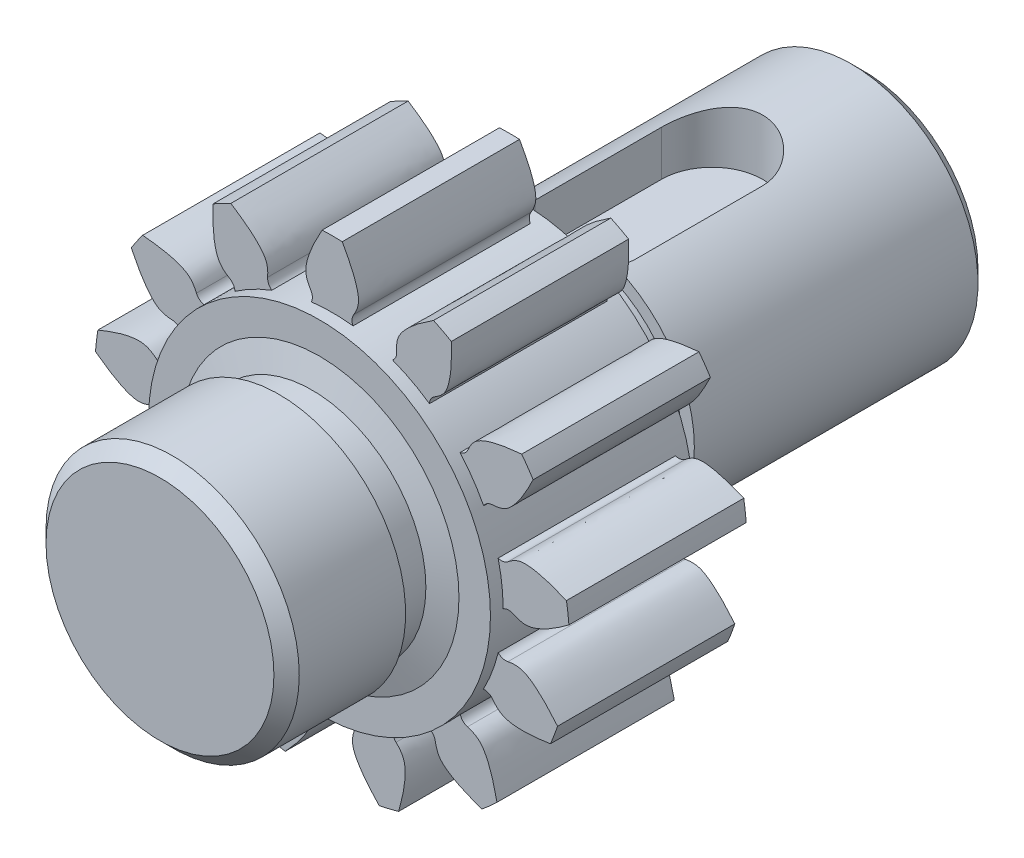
ISO-10303-21;
HEADER;
FILE_DESCRIPTION(('STEP AP214'),'2;1');
FILE_NAME('part.step','',(''),(''),'','','');
FILE_SCHEMA(('AUTOMOTIVE_DESIGN { 1 0 10303 214 1 1 1 1 }'));
ENDSEC;
DATA;
#1=APPLICATION_CONTEXT('core data for automotive mechanical design processes');
#2=APPLICATION_PROTOCOL_DEFINITION('international standard','automotive_design',2000,#1);
#3=PRODUCT_CONTEXT('',#1,'mechanical');
#4=PRODUCT('Part','Part','',(#3));
#5=PRODUCT_RELATED_PRODUCT_CATEGORY('part','',(#4));
#6=PRODUCT_DEFINITION_FORMATION('','',#4);
#7=PRODUCT_DEFINITION_CONTEXT('part definition',#1,'design');
#8=PRODUCT_DEFINITION('design','',#6,#7);
#9=PRODUCT_DEFINITION_SHAPE('','',#8);
#10=(LENGTH_UNIT() NAMED_UNIT(*) SI_UNIT(.MILLI.,.METRE.));
#11=(NAMED_UNIT(*) PLANE_ANGLE_UNIT() SI_UNIT($,.RADIAN.));
#12=(NAMED_UNIT(*) SI_UNIT($,.STERADIAN.) SOLID_ANGLE_UNIT());
#13=UNCERTAINTY_MEASURE_WITH_UNIT(LENGTH_MEASURE(1.E-05),#10,'distance_accuracy_value','');
#14=(GEOMETRIC_REPRESENTATION_CONTEXT(3) GLOBAL_UNCERTAINTY_ASSIGNED_CONTEXT((#13)) GLOBAL_UNIT_ASSIGNED_CONTEXT((#10,
#11,#12)) REPRESENTATION_CONTEXT('',''));
#15=CARTESIAN_POINT('',(0.,0.,0.));
#16=DIRECTION('',(0.,0.,1.));
#17=DIRECTION('',(1.,0.,0.));
#18=AXIS2_PLACEMENT_3D('',#15,#16,#17);
#19=CARTESIAN_POINT('',(0.,0.,7.));
#20=DIRECTION('',(0.,0.,1.));
#21=DIRECTION('',(1.,0.,0.));
#22=AXIS2_PLACEMENT_3D('',#19,#20,#21);
#23=PLANE('',#22);
#24=CARTESIAN_POINT('',(0.,0.,7.));
#25=DIRECTION('',(0.,0.,1.));
#26=DIRECTION('',(1.,0.,0.));
#27=AXIS2_PLACEMENT_3D('',#24,#25,#26);
#28=CIRCLE('',#27,6.75);
#29=CARTESIAN_POINT('',(5.98076515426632,3.12936865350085,7.));
#30=VERTEX_POINT('',#29);
#31=CARTESIAN_POINT('',(5.04709237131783,4.48211541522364,7.));
#32=VERTEX_POINT('',#31);
#33=EDGE_CURVE('E1525',#30,#32,#28,.T.);
#34=ORIENTED_EDGE('',*,*,#33,.F.);
#35=CARTESIAN_POINT('',(6.33978555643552,2.91803973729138,7.));
#36=DIRECTION('',(0.,0.,1.));
#37=DIRECTION('',(1.,0.,0.));
#38=AXIS2_PLACEMENT_3D('',#35,#36,#37);
#39=CIRCLE('',#38,0.4166);
#40=CARTESIAN_POINT('',(6.32282096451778,3.33429418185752,7.));
#41=VERTEX_POINT('',#40);
#42=EDGE_CURVE('E1953',#30,#41,#39,.F.);
#43=ORIENTED_EDGE('',*,*,#42,.T.);
#44=CARTESIAN_POINT('',(5.61160692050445,3.39716275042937,7.));
#45=CARTESIAN_POINT('',(5.8462884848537,3.36088384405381,7.));
#46=CARTESIAN_POINT('',(6.24688748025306,3.29895612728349,7.));
#47=CARTESIAN_POINT('',(6.83751734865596,3.40057831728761,7.));
#48=CARTESIAN_POINT('',(7.43190063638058,3.99301980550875,7.));
#49=CARTESIAN_POINT('',(7.72061795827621,4.56887562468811,7.));
#50=CARTESIAN_POINT('',(7.93393042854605,4.9943340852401,7.));
#51=B_SPLINE_CURVE_WITH_KNOTS('',3,(#44,#45,#46,#47,#48,#49,#50),.UNSPECIFIED.,.F.,.F.,(4,1,1,1,
4),(0.,0.226552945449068,0.386723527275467,0.546894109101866,1.),.UNSPECIFIED.);
#52=CARTESIAN_POINT('',(7.93393042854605,4.9943340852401,7.));
#53=VERTEX_POINT('',#52);
#54=EDGE_CURVE('E2040',#41,#53,#51,.T.);
#55=ORIENTED_EDGE('',*,*,#54,.T.);
#56=CARTESIAN_POINT('',(0.,0.,7.));
#57=DIRECTION('',(0.,0.,1.));
#58=DIRECTION('',(-0.885456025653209,-0.46472317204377,0.));
#59=AXIS2_PLACEMENT_3D('',#56,#57,#58);
#60=CIRCLE('',#59,9.375);
#61=CARTESIAN_POINT('',(7.48353831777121,5.64688225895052,7.));
#62=VERTEX_POINT('',#61);
#63=EDGE_CURVE('E1862',#53,#62,#60,.T.);
#64=ORIENTED_EDGE('',*,*,#63,.T.);
#65=CARTESIAN_POINT('',(7.48353831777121,5.64688225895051,7.));
#66=CARTESIAN_POINT('',(7.0100831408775,5.59833015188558,7.));
#67=CARTESIAN_POINT('',(6.36926401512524,5.53261512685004,7.));
#68=CARTESIAN_POINT('',(5.60452930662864,5.1869863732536,7.));
#69=CARTESIAN_POINT('',(5.30003919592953,4.67079214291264,7.));
#70=CARTESIAN_POINT('',(5.21586407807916,4.27427083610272,7.));
#71=CARTESIAN_POINT('',(5.16655205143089,4.04197809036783,7.));
#72=B_SPLINE_CURVE_WITH_KNOTS('',3,(#65,#66,#67,#68,#69,#70,#71),.UNSPECIFIED.,.F.,.F.,(4,1,1,1,
4),(0.,0.453105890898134,0.613276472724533,0.773447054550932,1.),.UNSPECIFIED.);
#73=CARTESIAN_POINT('',(5.36001080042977,4.72925648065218,7.));
#74=VERTEX_POINT('',#73);
#75=EDGE_CURVE('E1854',#62,#74,#72,.T.);
#76=ORIENTED_EDGE('',*,*,#75,.T.);
#77=CARTESIAN_POINT('',(4.9768318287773,4.89274787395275,7.));
#78=DIRECTION('',(0.,0.,1.));
#79=DIRECTION('',(1.,0.,0.));
#80=AXIS2_PLACEMENT_3D('',#77,#78,#79);
#81=CIRCLE('',#80,0.4166);
#82=EDGE_CURVE('E1955',#74,#32,#81,.F.);
#83=ORIENTED_EDGE('',*,*,#82,.T.);
#84=EDGE_LOOP('',(#34,#43,#55,#64,#76,#83));
#85=FACE_BOUND('',#84,.T.);
#86=ADVANCED_FACE('F353',(#85),#23,.T.);
#87=CARTESIAN_POINT('',(0.,0.,0.));
#88=DIRECTION('',(0.,0.,1.));
#89=DIRECTION('',(1.,0.,0.));
#90=AXIS2_PLACEMENT_3D('',#87,#88,#89);
#91=PLANE('',#90);
#92=CARTESIAN_POINT('',(6.33978555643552,2.91803973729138,0.));
#93=DIRECTION('',(0.,0.,1.));
#94=DIRECTION('',(1.,0.,0.));
#95=AXIS2_PLACEMENT_3D('',#92,#93,#94);
#96=CIRCLE('',#95,0.4166);
#97=CARTESIAN_POINT('',(6.32282096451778,3.33429418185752,0.));
#98=VERTEX_POINT('',#97);
#99=CARTESIAN_POINT('',(5.98076515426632,3.12936865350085,0.));
#100=VERTEX_POINT('',#99);
#101=EDGE_CURVE('E1950',#98,#100,#96,.T.);
#102=ORIENTED_EDGE('',*,*,#101,.T.);
#103=CARTESIAN_POINT('',(0.,0.,0.));
#104=DIRECTION('',(0.,0.,1.));
#105=DIRECTION('',(1.,0.,0.));
#106=AXIS2_PLACEMENT_3D('',#103,#104,#105);
#107=CIRCLE('',#106,6.75);
#108=CARTESIAN_POINT('',(5.04709237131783,4.48211541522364,0.));
#109=VERTEX_POINT('',#108);
#110=EDGE_CURVE('E1520',#100,#109,#107,.T.);
#111=ORIENTED_EDGE('',*,*,#110,.T.);
#112=CARTESIAN_POINT('',(4.9768318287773,4.89274787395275,0.));
#113=DIRECTION('',(0.,0.,1.));
#114=DIRECTION('',(1.,0.,0.));
#115=AXIS2_PLACEMENT_3D('',#112,#113,#114);
#116=CIRCLE('',#115,0.4166);
#117=CARTESIAN_POINT('',(5.36001080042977,4.72925648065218,0.));
#118=VERTEX_POINT('',#117);
#119=EDGE_CURVE('E1958',#109,#118,#116,.T.);
#120=ORIENTED_EDGE('',*,*,#119,.T.);
#121=CARTESIAN_POINT('',(7.48353831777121,5.64688225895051,0.));
#122=CARTESIAN_POINT('',(7.0100831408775,5.59833015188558,0.));
#123=CARTESIAN_POINT('',(6.36926401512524,5.53261512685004,0.));
#124=CARTESIAN_POINT('',(5.60452930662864,5.1869863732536,0.));
#125=CARTESIAN_POINT('',(5.30003919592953,4.67079214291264,0.));
#126=CARTESIAN_POINT('',(5.21586407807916,4.27427083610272,0.));
#127=CARTESIAN_POINT('',(5.16655205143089,4.04197809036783,0.));
#128=B_SPLINE_CURVE_WITH_KNOTS('',3,(#121,#122,#123,#124,#125,#126,#127),.UNSPECIFIED.,.F.,.F.,
(4,1,1,1,4),(0.,0.453105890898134,0.613276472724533,0.773447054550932,1.),.UNSPECIFIED.);
#129=CARTESIAN_POINT('',(7.48353831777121,5.64688225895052,0.));
#130=VERTEX_POINT('',#129);
#131=EDGE_CURVE('E2036',#130,#118,#128,.T.);
#132=ORIENTED_EDGE('',*,*,#131,.F.);
#133=CARTESIAN_POINT('',(0.,0.,0.));
#134=DIRECTION('',(0.,0.,1.));
#135=DIRECTION('',(-0.885456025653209,-0.46472317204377,0.));
#136=AXIS2_PLACEMENT_3D('',#133,#134,#135);
#137=CIRCLE('',#136,9.375);
#138=CARTESIAN_POINT('',(7.93393042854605,4.9943340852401,0.));
#139=VERTEX_POINT('',#138);
#140=EDGE_CURVE('E2031',#139,#130,#137,.T.);
#141=ORIENTED_EDGE('',*,*,#140,.F.);
#142=CARTESIAN_POINT('',(5.61160692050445,3.39716275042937,0.));
#143=CARTESIAN_POINT('',(5.8462884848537,3.36088384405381,0.));
#144=CARTESIAN_POINT('',(6.24688748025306,3.29895612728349,0.));
#145=CARTESIAN_POINT('',(6.83751734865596,3.40057831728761,0.));
#146=CARTESIAN_POINT('',(7.43190063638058,3.99301980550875,0.));
#147=CARTESIAN_POINT('',(7.72061795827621,4.56887562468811,0.));
#148=CARTESIAN_POINT('',(7.93393042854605,4.9943340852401,0.));
#149=B_SPLINE_CURVE_WITH_KNOTS('',3,(#142,#143,#144,#145,#146,#147,#148),.UNSPECIFIED.,.F.,.F.,
(4,1,1,1,4),(0.,0.226552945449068,0.386723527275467,0.546894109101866,1.),.UNSPECIFIED.);
#150=EDGE_CURVE('E2027',#98,#139,#149,.T.);
#151=ORIENTED_EDGE('',*,*,#150,.F.);
#152=EDGE_LOOP('',(#102,#111,#120,#132,#141,#151));
#153=FACE_BOUND('',#152,.T.);
#154=ADVANCED_FACE('F971',(#153),#91,.F.);
#155=DIRECTION('',(0.,0.,-1.));
#156=VECTOR('',#155,1.);
#157=SURFACE_OF_LINEAR_EXTRUSION('',#51,#156);
#158=ORIENTED_EDGE('',*,*,#54,.F.);
#159=DIRECTION('',(0.,0.,-1.));
#160=VECTOR('',#159,1.);
#161=CARTESIAN_POINT('',(6.32282096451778,3.33429418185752,7.));
#162=LINE('',#161,#160);
#163=EDGE_CURVE('E1944',#41,#98,#162,.T.);
#164=ORIENTED_EDGE('',*,*,#163,.T.);
#165=ORIENTED_EDGE('',*,*,#150,.T.);
#166=DIRECTION('',(0.,0.,-1.));
#167=VECTOR('',#166,1.);
#168=CARTESIAN_POINT('',(7.93393042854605,4.9943340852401,7.));
#169=LINE('',#168,#167);
#170=EDGE_CURVE('E1869',#53,#139,#169,.T.);
#171=ORIENTED_EDGE('',*,*,#170,.F.);
#172=EDGE_LOOP('',(#158,#164,#165,#171));
#173=FACE_BOUND('',#172,.T.);
#174=ADVANCED_FACE('F978',(#173),#157,.F.);
#175=DIRECTION('',(0.,0.,-1.));
#176=VECTOR('',#175,1.);
#177=SURFACE_OF_LINEAR_EXTRUSION('',#72,#176);
#178=ORIENTED_EDGE('',*,*,#131,.T.);
#179=DIRECTION('',(0.,0.,-1.));
#180=VECTOR('',#179,1.);
#181=CARTESIAN_POINT('',(5.36001080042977,4.72925648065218,0.));
#182=LINE('',#181,#180);
#183=EDGE_CURVE('E1947',#118,#74,#182,.F.);
#184=ORIENTED_EDGE('',*,*,#183,.T.);
#185=ORIENTED_EDGE('',*,*,#75,.F.);
#186=DIRECTION('',(0.,0.,-1.));
#187=VECTOR('',#186,1.);
#188=CARTESIAN_POINT('',(7.48353831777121,5.64688225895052,7.));
#189=LINE('',#188,#187);
#190=EDGE_CURVE('E1861',#62,#130,#189,.T.);
#191=ORIENTED_EDGE('',*,*,#190,.T.);
#192=EDGE_LOOP('',(#178,#184,#185,#191));
#193=FACE_BOUND('',#192,.T.);
#194=ADVANCED_FACE('F1847',(#193),#177,.F.);
#195=CARTESIAN_POINT('',(0.,0.,7.));
#196=DIRECTION('',(0.,0.,-1.));
#197=DIRECTION('',(-1.,0.,0.));
#198=AXIS2_PLACEMENT_3D('',#195,#196,#197);
#199=CYLINDRICAL_SURFACE('',#198,9.375);
#200=ORIENTED_EDGE('',*,*,#140,.T.);
#201=ORIENTED_EDGE('',*,*,#190,.F.);
#202=ORIENTED_EDGE('',*,*,#63,.F.);
#203=ORIENTED_EDGE('',*,*,#170,.T.);
#204=EDGE_LOOP('',(#200,#201,#202,#203));
#205=FACE_BOUND('',#204,.T.);
#206=ADVANCED_FACE('F1851',(#205),#199,.T.);
#207=CARTESIAN_POINT('',(6.33978555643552,2.91803973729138,3.5));
#208=DIRECTION('',(0.,0.,-1.));
#209=DIRECTION('',(-1.,0.,0.));
#210=AXIS2_PLACEMENT_3D('',#207,#208,#209);
#211=CYLINDRICAL_SURFACE('',#210,0.4166);
#212=ORIENTED_EDGE('',*,*,#42,.F.);
#213=DIRECTION('',(0.,0.,-1.));
#214=VECTOR('',#213,1.);
#215=CARTESIAN_POINT('',(5.98076515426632,3.12936865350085,3.5));
#216=LINE('',#215,#214);
#217=EDGE_CURVE('E1521',#30,#100,#216,.T.);
#218=ORIENTED_EDGE('',*,*,#217,.T.);
#219=ORIENTED_EDGE('',*,*,#101,.F.);
#220=ORIENTED_EDGE('',*,*,#163,.F.);
#221=EDGE_LOOP('',(#212,#218,#219,#220));
#222=FACE_BOUND('',#221,.T.);
#223=ADVANCED_FACE('F2319',(#222),#211,.F.);
#224=CARTESIAN_POINT('',(4.9768318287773,4.89274787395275,3.5));
#225=DIRECTION('',(0.,0.,-1.));
#226=DIRECTION('',(-1.,0.,0.));
#227=AXIS2_PLACEMENT_3D('',#224,#225,#226);
#228=CYLINDRICAL_SURFACE('',#227,0.4166);
#229=ORIENTED_EDGE('',*,*,#119,.F.);
#230=DIRECTION('',(0.,0.,-1.));
#231=VECTOR('',#230,1.);
#232=CARTESIAN_POINT('',(5.04709237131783,4.48211541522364,3.5));
#233=LINE('',#232,#231);
#234=EDGE_CURVE('E1517',#109,#32,#233,.F.);
#235=ORIENTED_EDGE('',*,*,#234,.T.);
#236=ORIENTED_EDGE('',*,*,#82,.F.);
#237=ORIENTED_EDGE('',*,*,#183,.F.);
#238=EDGE_LOOP('',(#229,#235,#236,#237));
#239=FACE_BOUND('',#238,.T.);
#240=ADVANCED_FACE('F2293',(#239),#228,.F.);
#241=CARTESIAN_POINT('',(0.,0.,-15.));
#242=DIRECTION('',(0.,0.,-1.));
#243=DIRECTION('',(-1.,0.,0.));
#244=AXIS2_PLACEMENT_3D('',#241,#242,#243);
#245=CYLINDRICAL_SURFACE('',#244,6.75);
#246=ORIENTED_EDGE('',*,*,#217,.F.);
#247=ORIENTED_EDGE('',*,*,#33,.T.);
#248=ORIENTED_EDGE('',*,*,#234,.F.);
#249=ORIENTED_EDGE('',*,*,#110,.F.);
#250=EDGE_LOOP('',(#246,#247,#248,#249));
#251=FACE_BOUND('',#250,.T.);
#252=DIRECTION('',(0.,0.,-1.));
#253=VECTOR('',#252,1.);
#254=CARTESIAN_POINT('',(0.82204193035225,6.69975723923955,3.5));
#255=LINE('',#254,#253);
#256=CARTESIAN_POINT('',(0.82204193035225,6.69975723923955,7.));
#257=VERTEX_POINT('',#256);
#258=CARTESIAN_POINT('',(0.82204193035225,6.69975723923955,0.));
#259=VERTEX_POINT('',#258);
#260=EDGE_CURVE('E1165',#257,#259,#255,.T.);
#261=ORIENTED_EDGE('',*,*,#260,.F.);
#262=CARTESIAN_POINT('',(-0.821633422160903,6.69980734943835,7.));
#263=VERTEX_POINT('',#262);
#264=EDGE_CURVE('E1157',#257,#263,#28,.T.);
#265=ORIENTED_EDGE('',*,*,#264,.T.);
#266=DIRECTION('',(0.,0.,-1.));
#267=VECTOR('',#266,1.);
#268=CARTESIAN_POINT('',(-0.821633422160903,6.69980734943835,3.5));
#269=LINE('',#268,#267);
#270=CARTESIAN_POINT('',(-0.821633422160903,6.69980734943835,0.));
#271=VERTEX_POINT('',#270);
#272=EDGE_CURVE('E1507',#271,#263,#269,.F.);
#273=ORIENTED_EDGE('',*,*,#272,.F.);
#274=EDGE_CURVE('E1166',#259,#271,#107,.T.);
#275=ORIENTED_EDGE('',*,*,#274,.F.);
#276=EDGE_LOOP('',(#261,#265,#273,#275));
#277=FACE_BOUND('',#276,.T.);
#278=DIRECTION('',(0.,0.,-1.));
#279=VECTOR('',#278,1.);
#280=CARTESIAN_POINT('',(-5.04681907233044,4.48242314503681,3.5));
#281=LINE('',#280,#279);
#282=CARTESIAN_POINT('',(-5.04681907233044,4.48242314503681,7.));
#283=VERTEX_POINT('',#282);
#284=CARTESIAN_POINT('',(-5.04681907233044,4.48242314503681,0.));
#285=VERTEX_POINT('',#284);
#286=EDGE_CURVE('E1496',#283,#285,#281,.T.);
#287=ORIENTED_EDGE('',*,*,#286,.F.);
#288=CARTESIAN_POINT('',(-5.9805743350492,3.1297333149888,7.));
#289=VERTEX_POINT('',#288);
#290=EDGE_CURVE('E1500',#283,#289,#28,.T.);
#291=ORIENTED_EDGE('',*,*,#290,.T.);
#292=DIRECTION('',(0.,0.,-1.));
#293=VECTOR('',#292,1.);
#294=CARTESIAN_POINT('',(-5.9805743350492,3.1297333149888,3.5));
#295=LINE('',#294,#293);
#296=CARTESIAN_POINT('',(-5.9805743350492,3.1297333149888,0.));
#297=VERTEX_POINT('',#296);
#298=EDGE_CURVE('E1491',#297,#289,#295,.F.);
#299=ORIENTED_EDGE('',*,*,#298,.F.);
#300=EDGE_CURVE('E1495',#285,#297,#107,.T.);
#301=ORIENTED_EDGE('',*,*,#300,.F.);
#302=EDGE_LOOP('',(#287,#291,#299,#301));
#303=FACE_BOUND('',#302,.T.);
#304=DIRECTION('',(0.,0.,-1.));
#305=VECTOR('',#304,1.);
#306=CARTESIAN_POINT('',(-6.55588192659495,-1.60714410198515,3.5));
#307=LINE('',#306,#305);
#308=CARTESIAN_POINT('',(-6.55588192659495,-1.60714410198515,7.));
#309=VERTEX_POINT('',#308);
#310=CARTESIAN_POINT('',(-6.55588192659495,-1.60714410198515,0.));
#311=VERTEX_POINT('',#310);
#312=EDGE_CURVE('E1480',#309,#311,#307,.T.);
#313=ORIENTED_EDGE('',*,*,#312,.F.);
#314=CARTESIAN_POINT('',(-5.97307346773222,-3.14402502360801,7.));
#315=VERTEX_POINT('',#314);
#316=EDGE_CURVE('E1484',#309,#315,#28,.T.);
#317=ORIENTED_EDGE('',*,*,#316,.T.);
#318=DIRECTION('',(0.,0.,-1.));
#319=VECTOR('',#318,1.);
#320=CARTESIAN_POINT('',(-5.97307346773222,-3.14402502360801,3.5));
#321=LINE('',#320,#319);
#322=CARTESIAN_POINT('',(-5.97307346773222,-3.14402502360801,0.));
#323=VERTEX_POINT('',#322);
#324=EDGE_CURVE('E1475',#323,#315,#321,.F.);
#325=ORIENTED_EDGE('',*,*,#324,.F.);
#326=EDGE_CURVE('E1479',#311,#323,#107,.T.);
#327=ORIENTED_EDGE('',*,*,#326,.F.);
#328=EDGE_LOOP('',(#313,#317,#325,#327));
#329=FACE_BOUND('',#328,.T.);
#330=DIRECTION('',(0.,0.,-1.));
#331=VECTOR('',#330,1.);
#332=CARTESIAN_POINT('',(-2.40151174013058,-6.30834695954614,3.5));
#333=LINE('',#332,#331);
#334=CARTESIAN_POINT('',(-2.40151174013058,-6.30834695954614,7.));
#335=VERTEX_POINT('',#334);
#336=CARTESIAN_POINT('',(-2.40151174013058,-6.30834695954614,0.));
#337=VERTEX_POINT('',#336);
#338=EDGE_CURVE('E1464',#335,#337,#333,.T.);
#339=ORIENTED_EDGE('',*,*,#338,.F.);
#340=CARTESIAN_POINT('',(-0.80561059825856,-6.7017528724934,7.));
#341=VERTEX_POINT('',#340);
#342=EDGE_CURVE('E1468',#335,#341,#28,.T.);
#343=ORIENTED_EDGE('',*,*,#342,.T.);
#344=DIRECTION('',(0.,0.,-1.));
#345=VECTOR('',#344,1.);
#346=CARTESIAN_POINT('',(-0.805610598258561,-6.7017528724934,3.5));
#347=LINE('',#346,#345);
#348=CARTESIAN_POINT('',(-0.805610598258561,-6.7017528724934,0.));
#349=VERTEX_POINT('',#348);
#350=EDGE_CURVE('E1459',#349,#341,#347,.F.);
#351=ORIENTED_EDGE('',*,*,#350,.F.);
#352=EDGE_CURVE('E1463',#337,#349,#107,.T.);
#353=ORIENTED_EDGE('',*,*,#352,.F.);
#354=EDGE_LOOP('',(#339,#343,#351,#353));
#355=FACE_BOUND('',#354,.T.);
#356=DIRECTION('',(0.,0.,-1.));
#357=VECTOR('',#356,1.);
#358=CARTESIAN_POINT('',(3.82745360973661,-5.55995493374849,3.5));
#359=LINE('',#358,#357);
#360=CARTESIAN_POINT('',(3.82745360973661,-5.55995493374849,7.));
#361=VERTEX_POINT('',#360);
#362=CARTESIAN_POINT('',(3.82745360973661,-5.55995493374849,0.));
#363=VERTEX_POINT('',#362);
#364=EDGE_CURVE('E1449',#361,#363,#359,.T.);
#365=ORIENTED_EDGE('',*,*,#364,.F.);
#366=CARTESIAN_POINT('',(5.05779550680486,-4.47003407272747,7.));
#367=VERTEX_POINT('',#366);
#368=EDGE_CURVE('E1443',#361,#367,#28,.T.);
#369=ORIENTED_EDGE('',*,*,#368,.T.);
#370=DIRECTION('',(0.,0.,-1.));
#371=VECTOR('',#370,1.);
#372=CARTESIAN_POINT('',(5.05779550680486,-4.47003407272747,3.5));
#373=LINE('',#372,#371);
#374=CARTESIAN_POINT('',(5.05779550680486,-4.47003407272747,0.));
#375=VERTEX_POINT('',#374);
#376=EDGE_CURVE('E1446',#375,#367,#373,.F.);
#377=ORIENTED_EDGE('',*,*,#376,.F.);
#378=EDGE_CURVE('E1440',#363,#375,#107,.T.);
#379=ORIENTED_EDGE('',*,*,#378,.F.);
#380=EDGE_LOOP('',(#365,#369,#377,#379));
#381=FACE_BOUND('',#380,.T.);
#382=CARTESIAN_POINT('',(0.,0.,-0.5));
#383=DIRECTION('',(0.,0.,-1.));
#384=DIRECTION('',(-1.,0.,0.));
#385=AXIS2_PLACEMENT_3D('',#382,#383,#384);
#386=CIRCLE('',#385,6.75);
#387=CARTESIAN_POINT('',(-6.75,0.,-0.5));
#388=VERTEX_POINT('',#387);
#389=EDGE_CURVE('E1433',#388,#388,#386,.T.);
#390=ORIENTED_EDGE('',*,*,#389,.F.);
#391=EDGE_LOOP('',(#390));
#392=FACE_BOUND('',#391,.T.);
#393=CARTESIAN_POINT('',(0.,0.,7.5));
#394=DIRECTION('',(0.,0.,-1.));
#395=DIRECTION('',(-1.,0.,0.));
#396=AXIS2_PLACEMENT_3D('',#393,#394,#395);
#397=CIRCLE('',#396,6.75);
#398=CARTESIAN_POINT('',(-6.75,0.,7.5));
#399=VERTEX_POINT('',#398);
#400=EDGE_CURVE('E1430',#399,#399,#397,.T.);
#401=ORIENTED_EDGE('',*,*,#400,.T.);
#402=EDGE_LOOP('',(#401));
#403=FACE_BOUND('',#402,.T.);
#404=DIRECTION('',(0.,0.,-1.));
#405=VECTOR('',#404,1.);
#406=CARTESIAN_POINT('',(5.97288175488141,-3.14438921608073,3.5));
#407=LINE('',#406,#405);
#408=CARTESIAN_POINT('',(5.97288175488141,-3.14438921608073,7.));
#409=VERTEX_POINT('',#408);
#410=CARTESIAN_POINT('',(5.97288175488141,-3.14438921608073,0.));
#411=VERTEX_POINT('',#410);
#412=EDGE_CURVE('E1442',#409,#411,#407,.T.);
#413=ORIENTED_EDGE('',*,*,#412,.F.);
#414=CARTESIAN_POINT('',(6.55578392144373,-1.60754383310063,7.));
#415=VERTEX_POINT('',#414);
#416=EDGE_CURVE('E1438',#409,#415,#28,.T.);
#417=ORIENTED_EDGE('',*,*,#416,.T.);
#418=DIRECTION('',(0.,0.,-1.));
#419=VECTOR('',#418,1.);
#420=CARTESIAN_POINT('',(6.55578392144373,-1.60754383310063,3.5));
#421=LINE('',#420,#419);
#422=CARTESIAN_POINT('',(6.55578392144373,-1.60754383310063,0.));
#423=VERTEX_POINT('',#422);
#424=EDGE_CURVE('E1329',#423,#415,#421,.F.);
#425=ORIENTED_EDGE('',*,*,#424,.F.);
#426=EDGE_CURVE('E1436',#411,#423,#107,.T.);
#427=ORIENTED_EDGE('',*,*,#426,.F.);
#428=EDGE_LOOP('',(#413,#417,#425,#427));
#429=FACE_BOUND('',#428,.T.);
#430=DIRECTION('',(0.,0.,-1.));
#431=VECTOR('',#430,1.);
#432=CARTESIAN_POINT('',(0.805201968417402,-6.70180198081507,3.5));
#433=LINE('',#432,#431);
#434=CARTESIAN_POINT('',(0.805201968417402,-6.70180198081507,7.));
#435=VERTEX_POINT('',#434);
#436=CARTESIAN_POINT('',(0.805201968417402,-6.70180198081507,0.));
#437=VERTEX_POINT('',#436);
#438=EDGE_CURVE('E1456',#435,#437,#433,.T.);
#439=ORIENTED_EDGE('',*,*,#438,.F.);
#440=CARTESIAN_POINT('',(2.40112709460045,-6.30849337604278,7.));
#441=VERTEX_POINT('',#440);
#442=EDGE_CURVE('E1460',#435,#441,#28,.T.);
#443=ORIENTED_EDGE('',*,*,#442,.T.);
#444=DIRECTION('',(0.,0.,-1.));
#445=VECTOR('',#444,1.);
#446=CARTESIAN_POINT('',(2.40112709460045,-6.30849337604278,3.5));
#447=LINE('',#446,#445);
#448=CARTESIAN_POINT('',(2.40112709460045,-6.30849337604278,0.));
#449=VERTEX_POINT('',#448);
#450=EDGE_CURVE('E1452',#449,#441,#447,.F.);
#451=ORIENTED_EDGE('',*,*,#450,.F.);
#452=EDGE_CURVE('E1455',#437,#449,#107,.T.);
#453=ORIENTED_EDGE('',*,*,#452,.F.);
#454=EDGE_LOOP('',(#439,#443,#451,#453));
#455=FACE_BOUND('',#454,.T.);
#456=DIRECTION('',(0.,0.,-1.));
#457=VECTOR('',#456,1.);
#458=CARTESIAN_POINT('',(-5.0580680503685,-4.46972567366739,3.5));
#459=LINE('',#458,#457);
#460=CARTESIAN_POINT('',(-5.0580680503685,-4.46972567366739,7.));
#461=VERTEX_POINT('',#460);
#462=CARTESIAN_POINT('',(-5.0580680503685,-4.46972567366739,0.));
#463=VERTEX_POINT('',#462);
#464=EDGE_CURVE('E1472',#461,#463,#459,.T.);
#465=ORIENTED_EDGE('',*,*,#464,.F.);
#466=CARTESIAN_POINT('',(-3.82779261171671,-5.55972155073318,7.));
#467=VERTEX_POINT('',#466);
#468=EDGE_CURVE('E1476',#461,#467,#28,.T.);
#469=ORIENTED_EDGE('',*,*,#468,.T.);
#470=DIRECTION('',(0.,0.,-1.));
#471=VECTOR('',#470,1.);
#472=CARTESIAN_POINT('',(-3.82779261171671,-5.55972155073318,3.5));
#473=LINE('',#472,#471);
#474=CARTESIAN_POINT('',(-3.82779261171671,-5.55972155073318,0.));
#475=VERTEX_POINT('',#474);
#476=EDGE_CURVE('E1467',#475,#467,#473,.F.);
#477=ORIENTED_EDGE('',*,*,#476,.F.);
#478=EDGE_CURVE('E1471',#463,#475,#107,.T.);
#479=ORIENTED_EDGE('',*,*,#478,.F.);
#480=EDGE_LOOP('',(#465,#469,#477,#479));
#481=FACE_BOUND('',#480,.T.);
#482=DIRECTION('',(0.,0.,-1.));
#483=VECTOR('',#482,1.);
#484=CARTESIAN_POINT('',(-6.55182226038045,1.62361481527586,3.5));
#485=LINE('',#484,#483);
#486=CARTESIAN_POINT('',(-6.55182226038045,1.62361481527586,7.));
#487=VERTEX_POINT('',#486);
#488=CARTESIAN_POINT('',(-6.55182226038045,1.62361481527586,0.));
#489=VERTEX_POINT('',#488);
#490=EDGE_CURVE('E1488',#487,#489,#485,.T.);
#491=ORIENTED_EDGE('',*,*,#490,.F.);
#492=CARTESIAN_POINT('',(-6.74999517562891,-0.00807025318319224,7.));
#493=VERTEX_POINT('',#492);
#494=EDGE_CURVE('E1492',#487,#493,#28,.T.);
#495=ORIENTED_EDGE('',*,*,#494,.T.);
#496=DIRECTION('',(0.,0.,-1.));
#497=VECTOR('',#496,1.);
#498=CARTESIAN_POINT('',(-6.74999517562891,-0.00807025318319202,3.5));
#499=LINE('',#498,#497);
#500=CARTESIAN_POINT('',(-6.74999517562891,-0.00807025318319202,0.));
#501=VERTEX_POINT('',#500);
#502=EDGE_CURVE('E1483',#501,#493,#499,.F.);
#503=ORIENTED_EDGE('',*,*,#502,.F.);
#504=EDGE_CURVE('E1487',#489,#501,#107,.T.);
#505=ORIENTED_EDGE('',*,*,#504,.F.);
#506=EDGE_LOOP('',(#491,#495,#503,#505));
#507=FACE_BOUND('',#506,.T.);
#508=DIRECTION('',(0.,0.,-1.));
#509=VECTOR('',#508,1.);
#510=CARTESIAN_POINT('',(-2.38565045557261,6.31436235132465,3.5));
#511=LINE('',#510,#509);
#512=CARTESIAN_POINT('',(-2.38565045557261,6.31436235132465,7.));
#513=VERTEX_POINT('',#512);
#514=CARTESIAN_POINT('',(-2.38565045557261,6.31436235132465,0.));
#515=VERTEX_POINT('',#514);
#516=EDGE_CURVE('E1504',#513,#515,#511,.T.);
#517=ORIENTED_EDGE('',*,*,#516,.F.);
#518=CARTESIAN_POINT('',(-3.84107598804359,5.55055269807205,7.));
#519=VERTEX_POINT('',#518);
#520=EDGE_CURVE('E1168',#513,#519,#28,.T.);
#521=ORIENTED_EDGE('',*,*,#520,.T.);
#522=DIRECTION('',(0.,0.,-1.));
#523=VECTOR('',#522,1.);
#524=CARTESIAN_POINT('',(-3.84107598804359,5.55055269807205,3.5));
#525=LINE('',#524,#523);
#526=CARTESIAN_POINT('',(-3.84107598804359,5.55055269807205,0.));
#527=VERTEX_POINT('',#526);
#528=EDGE_CURVE('E1499',#527,#519,#525,.F.);
#529=ORIENTED_EDGE('',*,*,#528,.F.);
#530=EDGE_CURVE('E1503',#515,#527,#107,.T.);
#531=ORIENTED_EDGE('',*,*,#530,.F.);
#532=EDGE_LOOP('',(#517,#521,#529,#531));
#533=FACE_BOUND('',#532,.T.);
#534=DIRECTION('',(0.,0.,-1.));
#535=VECTOR('',#534,1.);
#536=CARTESIAN_POINT('',(3.84141441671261,5.55031848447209,3.5));
#537=LINE('',#536,#535);
#538=CARTESIAN_POINT('',(3.84141441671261,5.55031848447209,7.));
#539=VERTEX_POINT('',#538);
#540=CARTESIAN_POINT('',(3.84141441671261,5.55031848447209,0.));
#541=VERTEX_POINT('',#540);
#542=EDGE_CURVE('E1514',#539,#541,#537,.T.);
#543=ORIENTED_EDGE('',*,*,#542,.F.);
#544=CARTESIAN_POINT('',(2.38603545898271,6.31421687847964,7.));
#545=VERTEX_POINT('',#544);
#546=EDGE_CURVE('E1169',#539,#545,#28,.T.);
#547=ORIENTED_EDGE('',*,*,#546,.T.);
#548=DIRECTION('',(0.,0.,-1.));
#549=VECTOR('',#548,1.);
#550=CARTESIAN_POINT('',(2.38603545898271,6.31421687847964,3.5));
#551=LINE('',#550,#549);
#552=CARTESIAN_POINT('',(2.38603545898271,6.31421687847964,0.));
#553=VERTEX_POINT('',#552);
#554=EDGE_CURVE('E1510',#553,#545,#551,.F.);
#555=ORIENTED_EDGE('',*,*,#554,.F.);
#556=EDGE_CURVE('E1513',#541,#553,#107,.T.);
#557=ORIENTED_EDGE('',*,*,#556,.F.);
#558=EDGE_LOOP('',(#543,#547,#555,#557));
#559=FACE_BOUND('',#558,.T.);
#560=DIRECTION('',(0.,0.,-1.));
#561=VECTOR('',#560,1.);
#562=CARTESIAN_POINT('',(6.74999467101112,-0.00848182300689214,3.5));
#563=LINE('',#562,#561);
#564=CARTESIAN_POINT('',(6.74999467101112,-0.00848182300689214,7.));
#565=VERTEX_POINT('',#564);
#566=CARTESIAN_POINT('',(6.74999467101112,-0.00848182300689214,0.));
#567=VERTEX_POINT('',#566);
#568=EDGE_CURVE('E1527',#565,#567,#563,.T.);
#569=ORIENTED_EDGE('',*,*,#568,.F.);
#570=CARTESIAN_POINT('',(6.55192124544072,1.62321532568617,7.));
#571=VERTEX_POINT('',#570);
#572=EDGE_CURVE('E376',#565,#571,#28,.T.);
#573=ORIENTED_EDGE('',*,*,#572,.T.);
#574=DIRECTION('',(0.,0.,-1.));
#575=VECTOR('',#574,1.);
#576=CARTESIAN_POINT('',(6.55192124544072,1.62321532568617,3.5));
#577=LINE('',#576,#575);
#578=CARTESIAN_POINT('',(6.55192124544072,1.62321532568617,0.));
#579=VERTEX_POINT('',#578);
#580=EDGE_CURVE('E1524',#579,#571,#577,.F.);
#581=ORIENTED_EDGE('',*,*,#580,.F.);
#582=EDGE_CURVE('E1439',#567,#579,#107,.T.);
#583=ORIENTED_EDGE('',*,*,#582,.F.);
#584=EDGE_LOOP('',(#569,#573,#581,#583));
#585=FACE_BOUND('',#584,.T.);
#586=ADVANCED_FACE('F2071',(#251,#277,#303,#329,#355,#381,#392,#403,#429,#455,#481,#507,#533,
#559,#585),#245,.T.);
#587=CARTESIAN_POINT('',(0.,6.75,-0.5));
#588=DIRECTION('',(0.,0.,-1.));
#589=DIRECTION('',(-1.,0.,0.));
#590=AXIS2_PLACEMENT_3D('',#587,#588,#589);
#591=PLANE('',#590);
#592=ORIENTED_EDGE('',*,*,#389,.T.);
#593=EDGE_LOOP('',(#592));
#594=FACE_BOUND('',#593,.T.);
#595=CARTESIAN_POINT('',(0.,0.,-0.5));
#596=DIRECTION('',(0.,0.,-1.));
#597=DIRECTION('',(-1.,0.,0.));
#598=AXIS2_PLACEMENT_3D('',#595,#596,#597);
#599=CIRCLE('',#598,5.82824407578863);
#600=CARTESIAN_POINT('',(-5.82824407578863,0.,-0.5));
#601=VERTEX_POINT('',#600);
#602=EDGE_CURVE('E939',#601,#601,#599,.T.);
#603=ORIENTED_EDGE('',*,*,#602,.F.);
#604=EDGE_LOOP('',(#603));
#605=FACE_BOUND('',#604,.T.);
#606=ADVANCED_FACE('F2292',(#594,#605),#591,.T.);
#607=CARTESIAN_POINT('',(0.,6.75,7.5));
#608=DIRECTION('',(0.,0.,1.));
#609=DIRECTION('',(1.,0.,0.));
#610=AXIS2_PLACEMENT_3D('',#607,#608,#609);
#611=PLANE('',#610);
#612=CARTESIAN_POINT('',(0.,0.,7.5));
#613=DIRECTION('',(0.,0.,-1.));
#614=DIRECTION('',(-1.,0.,0.));
#615=AXIS2_PLACEMENT_3D('',#612,#613,#614);
#616=CIRCLE('',#615,5.50663125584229);
#617=CARTESIAN_POINT('',(-5.50663125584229,0.,7.5));
#618=VERTEX_POINT('',#617);
#619=EDGE_CURVE('E1427',#618,#618,#616,.T.);
#620=ORIENTED_EDGE('',*,*,#619,.T.);
#621=EDGE_LOOP('',(#620));
#622=FACE_BOUND('',#621,.T.);
#623=ORIENTED_EDGE('',*,*,#400,.F.);
#624=EDGE_LOOP('',(#623));
#625=FACE_BOUND('',#624,.T.);
#626=ADVANCED_FACE('F3031',(#622,#625),#611,.T.);
#627=CARTESIAN_POINT('',(0.,0.,7.5));
#628=DIRECTION('',(0.,0.,-1.));
#629=DIRECTION('',(-1.,0.,0.));
#630=AXIS2_PLACEMENT_3D('',#627,#628,#629);
#631=CONICAL_SURFACE('',#630,5.50663125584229,1.28115361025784);
#632=CARTESIAN_POINT('',(0.,0.,7.8));
#633=DIRECTION('',(0.,0.,-1.));
#634=DIRECTION('',(-1.,0.,0.));
#635=AXIS2_PLACEMENT_3D('',#632,#633,#634);
#636=CIRCLE('',#635,4.5);
#637=CARTESIAN_POINT('',(-4.5,0.,7.8));
#638=VERTEX_POINT('',#637);
#639=EDGE_CURVE('E1424',#638,#638,#636,.T.);
#640=ORIENTED_EDGE('',*,*,#639,.T.);
#641=EDGE_LOOP('',(#640));
#642=FACE_BOUND('',#641,.T.);
#643=ORIENTED_EDGE('',*,*,#619,.F.);
#644=EDGE_LOOP('',(#643));
#645=FACE_BOUND('',#644,.T.);
#646=ADVANCED_FACE('F3039',(#642,#645),#631,.T.);
#647=CARTESIAN_POINT('',(0.,0.,-15.));
#648=DIRECTION('',(0.,0.,-1.));
#649=DIRECTION('',(-1.,0.,0.));
#650=AXIS2_PLACEMENT_3D('',#647,#648,#649);
#651=CYLINDRICAL_SURFACE('',#650,4.5);
#652=CARTESIAN_POINT('',(0.,0.,9.1));
#653=DIRECTION('',(0.,0.,-1.));
#654=DIRECTION('',(-1.,0.,0.));
#655=AXIS2_PLACEMENT_3D('',#652,#653,#654);
#656=CIRCLE('',#655,4.5);
#657=CARTESIAN_POINT('',(-4.5,0.,9.1));
#658=VERTEX_POINT('',#657);
#659=EDGE_CURVE('E1421',#658,#658,#656,.T.);
#660=ORIENTED_EDGE('',*,*,#659,.T.);
#661=EDGE_LOOP('',(#660));
#662=FACE_BOUND('',#661,.T.);
#663=ORIENTED_EDGE('',*,*,#639,.F.);
#664=EDGE_LOOP('',(#663));
#665=FACE_BOUND('',#664,.T.);
#666=ADVANCED_FACE('F3047',(#662,#665),#651,.T.);
#667=CARTESIAN_POINT('',(0.,4.5,9.1));
#668=DIRECTION('',(0.,0.,-1.));
#669=DIRECTION('',(-1.,0.,0.));
#670=AXIS2_PLACEMENT_3D('',#667,#668,#669);
#671=PLANE('',#670);
#672=CARTESIAN_POINT('',(0.,0.,9.1));
#673=DIRECTION('',(0.,0.,-1.));
#674=DIRECTION('',(-1.,0.,0.));
#675=AXIS2_PLACEMENT_3D('',#672,#673,#674);
#676=CIRCLE('',#675,5.);
#677=CARTESIAN_POINT('',(-5.,0.,9.1));
#678=VERTEX_POINT('',#677);
#679=EDGE_CURVE('E1418',#678,#678,#676,.T.);
#680=ORIENTED_EDGE('',*,*,#679,.T.);
#681=EDGE_LOOP('',(#680));
#682=FACE_BOUND('',#681,.T.);
#683=ORIENTED_EDGE('',*,*,#659,.F.);
#684=EDGE_LOOP('',(#683));
#685=FACE_BOUND('',#684,.T.);
#686=ADVANCED_FACE('F3055',(#682,#685),#671,.T.);
#687=CARTESIAN_POINT('',(0.,0.,-15.));
#688=DIRECTION('',(0.,0.,-1.));
#689=DIRECTION('',(-1.,0.,0.));
#690=AXIS2_PLACEMENT_3D('',#687,#688,#689);
#691=CYLINDRICAL_SURFACE('',#690,5.);
#692=CARTESIAN_POINT('',(0.,0.,13.3));
#693=DIRECTION('',(0.,0.,1.));
#694=DIRECTION('',(1.,0.,0.));
#695=AXIS2_PLACEMENT_3D('',#692,#693,#694);
#696=CIRCLE('',#695,5.);
#697=CARTESIAN_POINT('',(5.,0.,13.3));
#698=VERTEX_POINT('',#697);
#699=EDGE_CURVE('E1337',#698,#698,#696,.F.);
#700=ORIENTED_EDGE('',*,*,#699,.T.);
#701=EDGE_LOOP('',(#700));
#702=FACE_BOUND('',#701,.T.);
#703=ORIENTED_EDGE('',*,*,#679,.F.);
#704=EDGE_LOOP('',(#703));
#705=FACE_BOUND('',#704,.T.);
#706=ADVANCED_FACE('F3063',(#702,#705),#691,.T.);
#707=CARTESIAN_POINT('',(0.,5.,13.8));
#708=DIRECTION('',(0.,0.,1.));
#709=DIRECTION('',(1.,0.,0.));
#710=AXIS2_PLACEMENT_3D('',#707,#708,#709);
#711=PLANE('',#710);
#712=CARTESIAN_POINT('',(0.,0.,13.8));
#713=DIRECTION('',(0.,0.,1.));
#714=DIRECTION('',(1.,0.,0.));
#715=AXIS2_PLACEMENT_3D('',#712,#713,#714);
#716=CIRCLE('',#715,4.49999999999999);
#717=CARTESIAN_POINT('',(4.49999999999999,0.,13.8));
#718=VERTEX_POINT('',#717);
#719=EDGE_CURVE('E956',#718,#718,#716,.T.);
#720=ORIENTED_EDGE('',*,*,#719,.T.);
#721=EDGE_LOOP('',(#720));
#722=FACE_BOUND('',#721,.T.);
#723=ADVANCED_FACE('F1344',(#722),#711,.T.);
#724=CARTESIAN_POINT('',(0.,5.,-14.));
#725=DIRECTION('',(0.,0.,-1.));
#726=DIRECTION('',(-1.,0.,0.));
#727=AXIS2_PLACEMENT_3D('',#724,#725,#726);
#728=PLANE('',#727);
#729=CARTESIAN_POINT('',(0.,0.,-14.));
#730=DIRECTION('',(0.,0.,-1.));
#731=DIRECTION('',(-1.,0.,0.));
#732=AXIS2_PLACEMENT_3D('',#729,#730,#731);
#733=CIRCLE('',#732,4.5);
#734=CARTESIAN_POINT('',(-4.5,0.,-14.));
#735=VERTEX_POINT('',#734);
#736=EDGE_CURVE('E1332',#735,#735,#733,.T.);
#737=ORIENTED_EDGE('',*,*,#736,.T.);
#738=EDGE_LOOP('',(#737));
#739=FACE_BOUND('',#738,.T.);
#740=ADVANCED_FACE('F946',(#739),#728,.T.);
#741=CARTESIAN_POINT('',(0.,0.,-15.));
#742=DIRECTION('',(0.,0.,-1.));
#743=DIRECTION('',(-1.,0.,0.));
#744=AXIS2_PLACEMENT_3D('',#741,#742,#743);
#745=CYLINDRICAL_SURFACE('',#744,5.);
#746=CARTESIAN_POINT('',(0.,5.,-1.));
#747=CARTESIAN_POINT('',(0.10749300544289,4.99999271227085,-1.00000985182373));
#748=CARTESIAN_POINT('',(0.215172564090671,4.99649294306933,-1.00871775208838));
#749=CARTESIAN_POINT('',(0.427496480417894,4.98283453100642,-1.04324770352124));
#750=CARTESIAN_POINT('',(0.532131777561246,4.97265778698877,-1.06911627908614));
#751=CARTESIAN_POINT('',(0.734953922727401,4.94674209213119,-1.13687607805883));
#752=CARTESIAN_POINT('',(0.833160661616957,4.93102136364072,-1.17871484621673));
#753=CARTESIAN_POINT('',(1.02107197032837,4.89556610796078,-1.27701917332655));
#754=CARTESIAN_POINT('',(1.11077947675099,4.87583297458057,-1.33347965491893));
#755=CARTESIAN_POINT('',(1.28350100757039,4.83330886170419,-1.46223549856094));
#756=CARTESIAN_POINT('',(1.36606227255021,4.81042296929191,-1.53510665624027));
#757=CARTESIAN_POINT('',(1.51817500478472,4.76460576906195,-1.69340000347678));
#758=CARTESIAN_POINT('',(1.58772010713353,4.74167444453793,-1.77882829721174));
#759=CARTESIAN_POINT('',(1.71487456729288,4.69722791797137,-1.96442807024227));
#760=CARTESIAN_POINT('',(1.77181498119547,4.67582115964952,-2.0650864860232));
#761=CARTESIAN_POINT('',(1.86775471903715,4.63833647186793,-2.27553639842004));
#762=CARTESIAN_POINT('',(1.90676256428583,4.62225601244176,-2.38532352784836));
#763=CARTESIAN_POINT('',(1.96389882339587,4.59826357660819,-2.60571233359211));
#764=CARTESIAN_POINT('',(1.98289396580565,4.59001420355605,-2.71605123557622));
#765=CARTESIAN_POINT('',(2.00217296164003,4.58164004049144,-2.93863499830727));
#766=CARTESIAN_POINT('',(2.00246601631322,4.58151125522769,-3.05087889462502));
#767=CARTESIAN_POINT('',(1.98498936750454,4.58910500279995,-3.26575667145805));
#768=CARTESIAN_POINT('',(1.96847531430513,4.5962817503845,-3.36851571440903));
#769=CARTESIAN_POINT('',(1.91994688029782,4.61676187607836,-3.56965955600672));
#770=CARTESIAN_POINT('',(1.88792979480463,4.63006632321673,-3.66804358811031));
#771=CARTESIAN_POINT('',(1.80869473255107,4.66159485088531,-3.86001783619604));
#772=CARTESIAN_POINT('',(1.76117986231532,4.67991379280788,-3.95346923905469));
#773=CARTESIAN_POINT('',(1.65250646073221,4.7193811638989,-4.13141581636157));
#774=CARTESIAN_POINT('',(1.59134280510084,4.74053065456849,-4.21590760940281));
#775=CARTESIAN_POINT('',(1.45155059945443,4.78526736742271,-4.380409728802));
#776=CARTESIAN_POINT('',(1.37193746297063,4.80891664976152,-4.45956872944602));
#777=CARTESIAN_POINT('',(1.20031442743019,4.85459824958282,-4.60368447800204));
#778=CARTESIAN_POINT('',(1.10830206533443,4.87663024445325,-4.6686383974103));
#779=CARTESIAN_POINT('',(0.912077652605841,4.91714681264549,-4.78361744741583));
#780=CARTESIAN_POINT('',(0.807660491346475,4.93555270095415,-4.83332228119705));
#781=CARTESIAN_POINT('',(0.59102376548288,4.96614828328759,-4.91416786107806));
#782=CARTESIAN_POINT('',(0.478808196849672,4.97834113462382,-4.94531803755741));
#783=CARTESIAN_POINT('',(0.256895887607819,4.99456139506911,-4.98644829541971));
#784=CARTESIAN_POINT('',(0.147443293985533,4.99902945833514,-4.99757245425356));
#785=CARTESIAN_POINT('',(-0.0718453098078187,5.00068478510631,-5.00171310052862));
#786=CARTESIAN_POINT('',(-0.181681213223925,4.99787393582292,-4.99473428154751));
#787=CARTESIAN_POINT('',(-0.393432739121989,4.98557567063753,-4.96370824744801));
#788=CARTESIAN_POINT('',(-0.495482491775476,4.97639391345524,-4.94044201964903));
#789=CARTESIAN_POINT('',(-0.694135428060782,4.952594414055,-4.87856429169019));
#790=CARTESIAN_POINT('',(-0.790737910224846,4.93797597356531,-4.83995082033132));
#791=CARTESIAN_POINT('',(-0.979078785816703,4.90416594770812,-4.74721506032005));
#792=CARTESIAN_POINT('',(-1.07057802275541,4.88484815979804,-4.69265452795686));
#793=CARTESIAN_POINT('',(-1.24344359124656,4.84373364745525,-4.57005967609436));
#794=CARTESIAN_POINT('',(-1.32480584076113,4.82193593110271,-4.50201995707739));
#795=CARTESIAN_POINT('',(-1.48072304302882,4.77645117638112,-4.34912998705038));
#796=CARTESIAN_POINT('',(-1.55447393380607,4.75273441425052,-4.26346645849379));
#797=CARTESIAN_POINT('',(-1.68675119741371,4.70741672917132,-4.08055991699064));
#798=CARTESIAN_POINT('',(-1.74527506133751,4.68581615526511,-3.98331499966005));
#799=CARTESIAN_POINT('',(-1.84580750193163,4.64714299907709,-3.7785383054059));
#800=CARTESIAN_POINT('',(-1.88765059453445,4.63011630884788,-3.67091600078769));
#801=CARTESIAN_POINT('',(-1.9522962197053,4.60323673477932,-3.44926634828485));
#802=CARTESIAN_POINT('',(-1.97511280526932,4.59337855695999,-3.33524379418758));
#803=CARTESIAN_POINT('',(-1.9997156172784,4.58271759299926,-3.11287209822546));
#804=CARTESIAN_POINT('',(-2.00289708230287,4.58131421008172,-3.00470516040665));
#805=CARTESIAN_POINT('',(-1.99180315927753,4.58614836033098,-2.78945514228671));
#806=CARTESIAN_POINT('',(-1.97752998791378,4.59238492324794,-2.68237192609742));
#807=CARTESIAN_POINT('',(-1.93307136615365,4.61126649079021,-2.47666781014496));
#808=CARTESIAN_POINT('',(-1.90353749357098,4.6236483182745,-2.377879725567));
#809=CARTESIAN_POINT('',(-1.83000544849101,4.65324001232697,-2.18662137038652));
#810=CARTESIAN_POINT('',(-1.78600328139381,4.67045121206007,-2.09415285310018));
#811=CARTESIAN_POINT('',(-1.68187276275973,4.70898609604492,-1.91239038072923));
#812=CARTESIAN_POINT('',(-1.62096533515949,4.73048882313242,-1.82358132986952));
#813=CARTESIAN_POINT('',(-1.4858921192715,4.77463804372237,-1.65700668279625));
#814=CARTESIAN_POINT('',(-1.41172233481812,4.79728488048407,-1.57924442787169));
#815=CARTESIAN_POINT('',(-1.24650550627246,4.84293567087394,-1.43179714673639));
#816=CARTESIAN_POINT('',(-1.15467600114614,4.86586757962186,-1.36296269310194));
#817=CARTESIAN_POINT('',(-0.959900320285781,4.90800406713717,-1.24166295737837));
#818=CARTESIAN_POINT('',(-0.856949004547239,4.92720691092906,-1.18920528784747));
#819=CARTESIAN_POINT('',(-0.644738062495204,4.95939714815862,-1.10337778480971));
#820=CARTESIAN_POINT('',(-0.535631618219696,4.97249363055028,-1.06967067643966));
#821=CARTESIAN_POINT('',(-0.312876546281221,4.99144306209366,-1.02136087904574));
#822=CARTESIAN_POINT('',(-0.199243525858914,4.99731899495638,-1.0066975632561));
#823=CARTESIAN_POINT('',(-0.056912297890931,4.99975899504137,-1.00060461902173));
#824=CARTESIAN_POINT('',(-0.0284626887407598,5.00000192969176,-0.999997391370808));
#825=CARTESIAN_POINT('',(0.,5.,-1.));
#826=B_SPLINE_CURVE_WITH_KNOTS('',3,(#746,#747,#748,#749,#750,#751,#752,#753,#754,#755,#756,
#757,#758,#759,#760,#761,#762,#763,#764,#765,#766,#767,#768,#769,#770,#771,#772,#773,#774,#775,
#776,#777,#778,#779,#780,#781,#782,#783,#784,#785,#786,#787,#788,#789,#790,#791,#792,#793,#794,
#795,#796,#797,#798,#799,#800,#801,#802,#803,#804,#805,#806,#807,#808,#809,#810,#811,#812,#813,
#814,#815,#816,#817,#818,#819,#820,#821,#822,#823,#824,#825),.UNSPECIFIED.,.T.,.F.,(4,2,2,2,2,2,
2,2,2,2,2,2,2,2,2,2,2,2,2,2,2,2,2,2,2,2,2,2,2,2,2,2,2,2,2,2,2,2,2,4),(0.,0.322402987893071,
0.645683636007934,0.96791145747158,1.29002753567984,1.62597381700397,1.96208394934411,
2.31315258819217,2.66405423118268,2.99904105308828,3.33386306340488,3.64538328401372,
3.95695787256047,4.27489126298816,4.59294421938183,4.93558349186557,5.27829092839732,
5.62776913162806,5.9770695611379,6.30569184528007,6.63422893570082,6.94800455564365,
7.26182048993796,7.58523513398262,7.90877959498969,8.25368474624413,8.59864669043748,
8.94695045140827,9.29499672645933,9.61799673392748,9.94095572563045,10.2511431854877,
10.5614163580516,10.8894546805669,11.2175920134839,11.5670042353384,11.9165786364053,
12.2596430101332,12.6016125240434,12.6869804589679),.UNSPECIFIED.);
#827=CARTESIAN_POINT('',(1.87349939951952,4.63573079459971,-2.3));
#828=VERTEX_POINT('',#827);
#829=CARTESIAN_POINT('',(2.,4.58257569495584,-3.));
#830=VERTEX_POINT('',#829);
#831=EDGE_CURVE('E884',#828,#830,#826,.T.);
#832=ORIENTED_EDGE('',*,*,#831,.F.);
#833=CARTESIAN_POINT('',(0.,0.,-2.3));
#834=DIRECTION('',(0.,0.,-1.));
#835=DIRECTION('',(-1.,0.,0.));
#836=AXIS2_PLACEMENT_3D('',#833,#834,#835);
#837=CIRCLE('',#836,5.);
#838=CARTESIAN_POINT('',(-1.87349939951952,4.63573079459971,-2.3));
#839=VERTEX_POINT('',#838);
#840=EDGE_CURVE('E1413',#828,#839,#837,.T.);
#841=ORIENTED_EDGE('',*,*,#840,.T.);
#842=CARTESIAN_POINT('',(-2.,4.58257569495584,-3.));
#843=VERTEX_POINT('',#842);
#844=EDGE_CURVE('E933',#843,#839,#826,.T.);
#845=ORIENTED_EDGE('',*,*,#844,.F.);
#846=DIRECTION('',(0.,0.,-1.));
#847=VECTOR('',#846,1.);
#848=CARTESIAN_POINT('',(-2.,4.58257569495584,-15.));
#849=LINE('',#848,#847);
#850=CARTESIAN_POINT('',(-2.,4.58257569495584,-8.));
#851=VERTEX_POINT('',#850);
#852=EDGE_CURVE('E361',#851,#843,#849,.F.);
#853=ORIENTED_EDGE('',*,*,#852,.F.);
#854=CARTESIAN_POINT('',(2.,4.58257569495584,-8.));
#855=CARTESIAN_POINT('',(2.00000798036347,4.58256464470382,-8.0538058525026));
#856=CARTESIAN_POINT('',(1.99782891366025,4.58352306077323,-8.10760566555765));
#857=CARTESIAN_POINT('',(1.98915905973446,4.58729625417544,-8.21477129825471));
#858=CARTESIAN_POINT('',(1.98266991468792,4.59011032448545,-8.26813727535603));
#859=CARTESIAN_POINT('',(1.9654760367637,4.5974978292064,-8.37384682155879));
#860=CARTESIAN_POINT('',(1.95478796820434,4.60206430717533,-8.42619358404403));
#861=CARTESIAN_POINT('',(1.9293163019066,4.61280053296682,-8.52970077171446));
#862=CARTESIAN_POINT('',(1.9145324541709,4.61897037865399,-8.58086112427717));
#863=CARTESIAN_POINT('',(1.86426971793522,4.63959291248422,-8.73193585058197));
#864=CARTESIAN_POINT('',(1.82284489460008,4.65617449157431,-8.82965423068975));
#865=CARTESIAN_POINT('',(1.72548191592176,4.6931237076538,-9.01679558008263));
#866=CARTESIAN_POINT('',(1.66952996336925,4.71349493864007,-9.10621055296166));
#867=CARTESIAN_POINT('',(1.54131835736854,4.75700999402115,-9.27926239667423));
#868=CARTESIAN_POINT('',(1.4683691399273,4.78024245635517,-9.36236721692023));
#869=CARTESIAN_POINT('',(1.30969646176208,4.82612790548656,-9.51554027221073));
#870=CARTESIAN_POINT('',(1.22397038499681,4.84878077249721,-9.58560583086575));
#871=CARTESIAN_POINT('',(1.03800590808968,4.89203417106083,-9.71340639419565));
#872=CARTESIAN_POINT('',(0.937327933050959,4.91251824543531,-9.77054480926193));
#873=CARTESIAN_POINT('',(0.726824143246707,4.94803944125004,-9.86684407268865));
#874=CARTESIAN_POINT('',(0.617002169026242,4.96307883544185,-9.90601242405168));
#875=CARTESIAN_POINT('',(0.396967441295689,4.98538314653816,-9.96334120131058));
#876=CARTESIAN_POINT('',(0.287031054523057,4.99298922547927,-9.98242695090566));
#877=CARTESIAN_POINT('',(0.065268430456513,5.00080310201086,-10.0020284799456));
#878=CARTESIAN_POINT('',(-0.0465571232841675,5.0010135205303,-10.0025508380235));
#879=CARTESIAN_POINT('',(-0.262233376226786,4.99421960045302,-9.98551716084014));
#880=CARTESIAN_POINT('',(-0.366179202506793,4.98761985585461,-9.968974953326));
#881=CARTESIAN_POINT('',(-0.569674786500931,4.96849270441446,-9.92000657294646));
#882=CARTESIAN_POINT('',(-0.669224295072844,4.95596496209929,-9.88757950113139));
#883=CARTESIAN_POINT('',(-0.862897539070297,4.92596830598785,-9.80736370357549));
#884=CARTESIAN_POINT('',(-0.956916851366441,4.90842774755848,-9.75935075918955));
#885=CARTESIAN_POINT('',(-1.13580746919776,4.87014602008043,-9.64953541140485));
#886=CARTESIAN_POINT('',(-1.22067554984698,4.84940372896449,-9.58772817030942));
#887=CARTESIAN_POINT('',(-1.38476339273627,4.80521782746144,-9.44735581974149));
#888=CARTESIAN_POINT('',(-1.4632477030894,4.78168627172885,-9.36795752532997));
#889=CARTESIAN_POINT('',(-1.60609926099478,4.7356195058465,-9.19701990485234));
#890=CARTESIAN_POINT('',(-1.67046007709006,4.71308475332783,-9.10547507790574));
#891=CARTESIAN_POINT('',(-1.78493657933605,4.67095688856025,-8.90952971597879));
#892=CARTESIAN_POINT('',(-1.83458932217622,4.65146702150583,-8.8048351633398));
#893=CARTESIAN_POINT('',(-1.91521298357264,4.61886105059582,-8.58763847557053));
#894=CARTESIAN_POINT('',(-1.94621696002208,4.60573367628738,-8.47515055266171));
#895=CARTESIAN_POINT('',(-1.9781058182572,4.59208303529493,-8.30125636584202));
#896=CARTESIAN_POINT('',(-1.98630505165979,4.58853437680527,-8.24134245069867));
#897=CARTESIAN_POINT('',(-1.99725282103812,4.58377540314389,-8.12096498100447));
#898=CARTESIAN_POINT('',(-2.00000471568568,4.58256364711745,-8.06050178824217));
#899=CARTESIAN_POINT('',(-2.,4.58257569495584,-8.));
#900=B_SPLINE_CURVE_WITH_KNOTS('',3,(#854,#855,#856,#857,#858,#859,#860,#861,#862,#863,#864,
#865,#866,#867,#868,#869,#870,#871,#872,#873,#874,#875,#876,#877,#878,#879,#880,#881,#882,#883,
#884,#885,#886,#887,#888,#889,#890,#891,#892,#893,#894,#895,#896,#897,#898,#899),.UNSPECIFIED.,
.F.,.F.,(4,2,2,2,2,2,2,2,2,2,2,2,2,2,2,2,2,2,2,2,2,2,4),(0.,0.161354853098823,0.322648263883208,
0.483307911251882,0.643977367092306,0.964683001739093,1.28569434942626,1.62318047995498,
1.96073580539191,2.31162858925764,2.66237473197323,2.9961387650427,3.32978451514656,
3.64468915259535,3.95961161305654,4.27928176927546,4.59906421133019,4.93981874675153,
5.28072813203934,5.63144241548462,5.98153315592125,6.16300192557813,6.3443587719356),.UNSPECIFIED.);
#901=CARTESIAN_POINT('',(2.,4.58257569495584,-8.));
#902=VERTEX_POINT('',#901);
#903=EDGE_CURVE('E951',#902,#851,#900,.T.);
#904=ORIENTED_EDGE('',*,*,#903,.F.);
#905=DIRECTION('',(0.,0.,-1.));
#906=VECTOR('',#905,1.);
#907=CARTESIAN_POINT('',(2.,4.58257569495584,-15.));
#908=LINE('',#907,#906);
#909=EDGE_CURVE('E11',#830,#902,#908,.T.);
#910=ORIENTED_EDGE('',*,*,#909,.F.);
#911=EDGE_LOOP('',(#832,#841,#845,#853,#904,#910));
#912=FACE_BOUND('',#911,.T.);
#913=CARTESIAN_POINT('',(0.,0.,-13.5));
#914=DIRECTION('',(0.,0.,-1.));
#915=DIRECTION('',(-1.,0.,0.));
#916=AXIS2_PLACEMENT_3D('',#913,#914,#915);
#917=CIRCLE('',#916,5.);
#918=CARTESIAN_POINT('',(-5.,0.,-13.5));
#919=VERTEX_POINT('',#918);
#920=EDGE_CURVE('E1335',#919,#919,#917,.F.);
#921=ORIENTED_EDGE('',*,*,#920,.T.);
#922=EDGE_LOOP('',(#921));
#923=FACE_BOUND('',#922,.T.);
#924=ADVANCED_FACE('F941',(#912,#923),#745,.T.);
#925=CARTESIAN_POINT('',(0.,4.5,-2.3));
#926=DIRECTION('',(0.,0.,1.));
#927=DIRECTION('',(1.,0.,0.));
#928=AXIS2_PLACEMENT_3D('',#925,#926,#927);
#929=PLANE('',#928);
#930=DIRECTION('',(0.,1.,0.));
#931=VECTOR('',#930,1.);
#932=CARTESIAN_POINT('',(1.87349939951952,2.8,-2.3));
#933=LINE('',#932,#931);
#934=CARTESIAN_POINT('',(1.87349939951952,4.09145450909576,-2.3));
#935=VERTEX_POINT('',#934);
#936=EDGE_CURVE('E938',#935,#828,#933,.T.);
#937=ORIENTED_EDGE('',*,*,#936,.F.);
#938=CARTESIAN_POINT('',(0.,0.,-2.3));
#939=DIRECTION('',(0.,0.,-1.));
#940=DIRECTION('',(-1.,0.,0.));
#941=AXIS2_PLACEMENT_3D('',#938,#939,#940);
#942=CIRCLE('',#941,4.5);
#943=CARTESIAN_POINT('',(-1.87349939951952,4.09145450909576,-2.3));
#944=VERTEX_POINT('',#943);
#945=EDGE_CURVE('E1411',#935,#944,#942,.T.);
#946=ORIENTED_EDGE('',*,*,#945,.T.);
#947=DIRECTION('',(0.,1.,0.));
#948=VECTOR('',#947,1.);
#949=CARTESIAN_POINT('',(-1.87349939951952,2.8,-2.3));
#950=LINE('',#949,#948);
#951=EDGE_CURVE('E368',#839,#944,#950,.F.);
#952=ORIENTED_EDGE('',*,*,#951,.F.);
#953=ORIENTED_EDGE('',*,*,#840,.F.);
#954=EDGE_LOOP('',(#937,#946,#952,#953));
#955=FACE_BOUND('',#954,.T.);
#956=ADVANCED_FACE('F945',(#955),#929,.T.);
#957=CARTESIAN_POINT('',(0.,0.,-15.));
#958=DIRECTION('',(0.,0.,-1.));
#959=DIRECTION('',(-1.,0.,0.));
#960=AXIS2_PLACEMENT_3D('',#957,#958,#959);
#961=CYLINDRICAL_SURFACE('',#960,4.5);
#962=CARTESIAN_POINT('',(0.,4.5,-1.));
#963=CARTESIAN_POINT('',(0.106491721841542,4.49999592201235,-1.00000498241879));
#964=CARTESIAN_POINT('',(0.213149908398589,4.49617759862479,-1.0085554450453));
#965=CARTESIAN_POINT('',(0.423397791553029,4.48128347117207,-1.04241844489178));
#966=CARTESIAN_POINT('',(0.526979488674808,4.4701902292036,-1.0677712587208));
#967=CARTESIAN_POINT('',(0.727700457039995,4.44192390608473,-1.13410046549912));
#968=CARTESIAN_POINT('',(0.82486127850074,4.4247725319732,-1.17502111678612));
#969=CARTESIAN_POINT('',(1.01083182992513,4.38602940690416,-1.27107528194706));
#970=CARTESIAN_POINT('',(1.09964345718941,4.36443866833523,-1.3262055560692));
#971=CARTESIAN_POINT('',(1.27147987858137,4.31759990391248,-1.45233484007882));
#972=CARTESIAN_POINT('',(1.35398160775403,4.29222181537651,-1.52399764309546));
#973=CARTESIAN_POINT('',(1.50625667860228,4.24118529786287,-1.67974826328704));
#974=CARTESIAN_POINT('',(1.57602243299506,4.21552671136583,-1.76384343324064));
#975=CARTESIAN_POINT('',(1.70484606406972,4.16516047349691,-1.9479387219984));
#976=CARTESIAN_POINT('',(1.76305311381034,4.14059326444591,-2.04857681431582));
#977=CARTESIAN_POINT('',(1.86148058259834,4.09729211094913,-2.25945524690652));
#978=CARTESIAN_POINT('',(1.90171150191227,4.07855476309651,-2.36968993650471));
#979=CARTESIAN_POINT('',(1.96081152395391,4.05046224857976,-2.59062038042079));
#980=CARTESIAN_POINT('',(1.98069316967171,4.04066532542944,-2.70098673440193));
#981=CARTESIAN_POINT('',(2.00167828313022,4.03031463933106,-2.92388977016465));
#982=CARTESIAN_POINT('',(2.00279429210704,4.02975470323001,-3.0364249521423));
#983=CARTESIAN_POINT('',(1.98697164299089,4.03757276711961,-3.24969544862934));
#984=CARTESIAN_POINT('',(1.97164003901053,4.04515525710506,-3.35058536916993));
#985=CARTESIAN_POINT('',(1.92608101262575,4.06704362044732,-3.54817522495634));
#986=CARTESIAN_POINT('',(1.89585024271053,4.08135100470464,-3.64487421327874));
#987=CARTESIAN_POINT('',(1.82075207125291,4.11540857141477,-3.83393362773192));
#988=CARTESIAN_POINT('',(1.77557135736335,4.13527371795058,-3.92614794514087));
#989=CARTESIAN_POINT('',(1.67208117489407,4.1781907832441,-4.10207591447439));
#990=CARTESIAN_POINT('',(1.61376617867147,4.20124404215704,-4.18578596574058));
#991=CARTESIAN_POINT('',(1.47900808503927,4.25066638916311,-4.35091360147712));
#992=CARTESIAN_POINT('',(1.40135242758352,4.2771397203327,-4.4313134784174));
#993=CARTESIAN_POINT('',(1.23343821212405,4.32854899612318,-4.57831744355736));
#994=CARTESIAN_POINT('',(1.14317585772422,4.3534844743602,-4.64491736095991));
#995=CARTESIAN_POINT('',(0.949152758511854,4.39992448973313,-4.76421322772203));
#996=CARTESIAN_POINT('',(0.845072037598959,4.42130591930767,-4.81644034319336));
#997=CARTESIAN_POINT('',(0.628407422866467,4.45725580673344,-4.90227694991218));
#998=CARTESIAN_POINT('',(0.515828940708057,4.47182855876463,-4.93589817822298));
#999=CARTESIAN_POINT('',(0.293820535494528,4.4916825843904,-4.98131188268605));
#1000=CARTESIAN_POINT('',(0.184721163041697,4.49754246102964,-4.99446669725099));
#1001=CARTESIAN_POINT('',(-0.0342770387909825,4.5012000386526,-5.00270312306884));
#1002=CARTESIAN_POINT('',(-0.144175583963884,4.49900047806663,-4.99779087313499));
#1003=CARTESIAN_POINT('',(-0.354907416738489,4.48715295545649,-4.97095642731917));
#1004=CARTESIAN_POINT('',(-0.45589641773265,4.47794517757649,-4.95003910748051));
#1005=CARTESIAN_POINT('',(-0.652792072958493,4.45350542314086,-4.89324202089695));
#1006=CARTESIAN_POINT('',(-0.748698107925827,4.43827271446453,-4.85736043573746));
#1007=CARTESIAN_POINT('',(-0.936104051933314,4.40262377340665,-4.77051111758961));
#1008=CARTESIAN_POINT('',(-1.02737315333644,4.38206065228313,-4.71910765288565));
#1009=CARTESIAN_POINT('',(-1.20031927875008,4.33788123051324,-4.60314857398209));
#1010=CARTESIAN_POINT('',(-1.28199210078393,4.31426360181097,-4.53858723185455));
#1011=CARTESIAN_POINT('',(-1.44036721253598,4.26412793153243,-4.39208322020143));
#1012=CARTESIAN_POINT('',(-1.5161383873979,4.23752954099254,-4.30915906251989));
#1013=CARTESIAN_POINT('',(-1.65300242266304,4.18604134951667,-4.13144465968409));
#1014=CARTESIAN_POINT('',(-1.71409007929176,4.16115215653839,-4.03665022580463));
#1015=CARTESIAN_POINT('',(-1.8210757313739,4.11547790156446,-3.83487569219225));
#1016=CARTESIAN_POINT('',(-1.86658327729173,4.09480296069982,-3.72766168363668));
#1017=CARTESIAN_POINT('',(-1.9384649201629,4.06127502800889,-3.5058731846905));
#1018=CARTESIAN_POINT('',(-1.96485774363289,4.04841438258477,-3.39130601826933));
#1019=CARTESIAN_POINT('',(-1.99578547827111,4.03325053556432,-3.16851842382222));
#1020=CARTESIAN_POINT('',(-2.00198344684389,4.03014488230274,-3.06058312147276));
#1021=CARTESIAN_POINT('',(-1.99690774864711,4.03266289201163,-2.84524039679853));
#1022=CARTESIAN_POINT('',(-1.9856378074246,4.03828469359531,-2.73783286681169));
#1023=CARTESIAN_POINT('',(-1.94740226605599,4.056849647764,-2.53330807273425));
#1024=CARTESIAN_POINT('',(-1.92142172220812,4.06933199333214,-2.43596048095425));
#1025=CARTESIAN_POINT('',(-1.85554194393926,4.09978946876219,-2.24701808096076));
#1026=CARTESIAN_POINT('',(-1.81563868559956,4.11776618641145,-2.15542494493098));
#1027=CARTESIAN_POINT('',(-1.72012109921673,4.15861055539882,-1.97416239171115));
#1028=CARTESIAN_POINT('',(-1.66366385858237,4.18171780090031,-1.88499235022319));
#1029=CARTESIAN_POINT('',(-1.53773594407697,4.22964589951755,-1.71687518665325));
#1030=CARTESIAN_POINT('',(-1.46825983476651,4.25446746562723,-1.63793235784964));
#1031=CARTESIAN_POINT('',(-1.31108140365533,4.30563232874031,-1.48537758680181));
#1032=CARTESIAN_POINT('',(-1.22231636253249,4.33191880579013,-1.41283603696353));
#1033=CARTESIAN_POINT('',(-1.03295134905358,4.38093190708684,-1.28356478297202));
#1034=CARTESIAN_POINT('',(-0.932345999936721,4.40365690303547,-1.22684230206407));
#1035=CARTESIAN_POINT('',(-0.723051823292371,4.44279207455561,-1.13177613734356));
#1036=CARTESIAN_POINT('',(-0.614467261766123,4.45927074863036,-1.09323188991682));
#1037=CARTESIAN_POINT('',(-0.391615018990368,4.48431907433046,-1.0353602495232));
#1038=CARTESIAN_POINT('',(-0.277365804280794,4.49291284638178,-1.01597423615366));
#1039=CARTESIAN_POINT('',(-0.135356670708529,4.49804618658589,-1.00440027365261));
#1040=CARTESIAN_POINT('',(-0.108319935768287,4.49877760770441,-1.00275171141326));
#1041=CARTESIAN_POINT('',(-0.0541923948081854,4.49975503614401,-1.00055093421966));
#1042=CARTESIAN_POINT('',(-0.0271015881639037,4.5000010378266,-0.999998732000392));
#1043=CARTESIAN_POINT('',(0.,4.5,-1.));
#1044=B_SPLINE_CURVE_WITH_KNOTS('',3,(#962,#963,#964,#965,#966,#967,#968,#969,#970,#971,#972,
#973,#974,#975,#976,#977,#978,#979,#980,#981,#982,#983,#984,#985,#986,#987,#988,#989,#990,#991,
#992,#993,#994,#995,#996,#997,#998,#999,#1000,#1001,#1002,#1003,#1004,#1005,#1006,#1007,#1008,
#1009,#1010,#1011,#1012,#1013,#1014,#1015,#1016,#1017,#1018,#1019,#1020,#1021,#1022,#1023,#1024,
#1025,#1026,#1027,#1028,#1029,#1030,#1031,#1032,#1033,#1034,#1035,#1036,#1037,#1038,#1039,#1040,
#1041,#1042,#1043),.UNSPECIFIED.,.T.,.F.,(4,2,2,2,2,2,2,2,2,2,2,2,2,2,2,2,2,2,2,2,2,2,2,2,2,2,2,
2,2,2,2,2,2,2,2,2,2,2,2,2,4),(0.,0.319363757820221,0.639495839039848,0.958492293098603,
1.27741608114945,1.61253910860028,1.9478611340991,2.30254396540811,2.65701934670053,
2.99284475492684,3.32844571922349,3.63400850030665,3.93963996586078,4.25213185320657,
4.56475550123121,4.90783346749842,5.25101497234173,5.60433395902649,5.95742980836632,
6.2858281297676,6.61411487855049,6.92332786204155,7.23257843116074,7.55147695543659,
7.87051460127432,8.2152651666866,8.56013773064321,8.91311015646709,9.26573630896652,
9.58847399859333,9.91114286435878,10.214399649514,10.5177441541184,10.8405269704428,
11.1634448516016,11.5146101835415,11.8659356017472,12.2132884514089,12.5595751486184,
12.6408506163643,12.7221270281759),.UNSPECIFIED.);
#1045=CARTESIAN_POINT('',(0.,4.5,-1.));
#1046=VERTEX_POINT('',#1045);
#1047=EDGE_CURVE('E917',#1046,#935,#1044,.T.);
#1048=ORIENTED_EDGE('',*,*,#1047,.F.);
#1049=CARTESIAN_POINT('',(0.,0.,-1.));
#1050=DIRECTION('',(0.,0.,-1.));
#1051=DIRECTION('',(-1.,0.,0.));
#1052=AXIS2_PLACEMENT_3D('',#1049,#1050,#1051);
#1053=CIRCLE('',#1052,4.5);
#1054=EDGE_CURVE('E1409',#1046,#1046,#1053,.T.);
#1055=ORIENTED_EDGE('',*,*,#1054,.T.);
#1056=EDGE_CURVE('E907',#944,#1046,#1044,.T.);
#1057=ORIENTED_EDGE('',*,*,#1056,.F.);
#1058=ORIENTED_EDGE('',*,*,#945,.F.);
#1059=EDGE_LOOP('',(#1048,#1055,#1057,#1058));
#1060=FACE_BOUND('',#1059,.T.);
#1061=ADVANCED_FACE('F919',(#1060),#961,.T.);
#1062=CARTESIAN_POINT('',(0.,0.,-1.));
#1063=DIRECTION('',(0.,0.,1.));
#1064=DIRECTION('',(1.,0.,0.));
#1065=AXIS2_PLACEMENT_3D('',#1062,#1063,#1064);
#1066=CONICAL_SURFACE('',#1065,4.5,1.21076655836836);
#1067=ORIENTED_EDGE('',*,*,#602,.T.);
#1068=EDGE_LOOP('',(#1067));
#1069=FACE_BOUND('',#1068,.T.);
#1070=ORIENTED_EDGE('',*,*,#1054,.F.);
#1071=EDGE_LOOP('',(#1070));
#1072=FACE_BOUND('',#1071,.T.);
#1073=ADVANCED_FACE('F1371',(#1069,#1072),#1066,.T.);
#1074=CARTESIAN_POINT('',(0.,0.,7.));
#1075=DIRECTION('',(0.,0.,-1.));
#1076=DIRECTION('',(-1.,0.,0.));
#1077=AXIS2_PLACEMENT_3D('',#1074,#1075,#1076);
#1078=CYLINDRICAL_SURFACE('',#1077,9.375);
#1079=CARTESIAN_POINT('',(0.,0.,0.));
#1080=DIRECTION('',(0.,0.,1.));
#1081=DIRECTION('',(-0.568064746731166,0.822983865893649,0.));
#1082=AXIS2_PLACEMENT_3D('',#1079,#1080,#1081);
#1083=CIRCLE('',#1082,9.375);
#1084=CARTESIAN_POINT('',(5.91424940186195,-7.27408269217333,0.));
#1085=VERTEX_POINT('',#1084);
#1086=CARTESIAN_POINT('',(6.50775099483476,-6.74831845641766,0.));
#1087=VERTEX_POINT('',#1086);
#1088=EDGE_CURVE('E2108',#1085,#1087,#1083,.T.);
#1089=ORIENTED_EDGE('',*,*,#1088,.T.);
#1090=DIRECTION('',(0.,0.,-1.));
#1091=VECTOR('',#1090,1.);
#1092=CARTESIAN_POINT('',(6.50775099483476,-6.74831845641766,7.));
#1093=LINE('',#1092,#1091);
#1094=CARTESIAN_POINT('',(6.50775099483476,-6.74831845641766,7.));
#1095=VERTEX_POINT('',#1094);
#1096=EDGE_CURVE('E1576',#1095,#1087,#1093,.T.);
#1097=ORIENTED_EDGE('',*,*,#1096,.F.);
#1098=CARTESIAN_POINT('',(0.,0.,7.));
#1099=DIRECTION('',(0.,0.,1.));
#1100=DIRECTION('',(-0.568064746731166,0.822983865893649,0.));
#1101=AXIS2_PLACEMENT_3D('',#1098,#1099,#1100);
#1102=CIRCLE('',#1101,9.375);
#1103=CARTESIAN_POINT('',(5.91424940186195,-7.27408269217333,7.));
#1104=VERTEX_POINT('',#1103);
#1105=EDGE_CURVE('E1577',#1104,#1095,#1102,.T.);
#1106=ORIENTED_EDGE('',*,*,#1105,.F.);
#1107=DIRECTION('',(0.,0.,-1.));
#1108=VECTOR('',#1107,1.);
#1109=CARTESIAN_POINT('',(5.91424940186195,-7.27408269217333,7.));
#1110=LINE('',#1109,#1108);
#1111=EDGE_CURVE('E1584',#1104,#1085,#1110,.T.);
#1112=ORIENTED_EDGE('',*,*,#1111,.T.);
#1113=EDGE_LOOP('',(#1089,#1097,#1106,#1112));
#1114=FACE_BOUND('',#1113,.T.);
#1115=ADVANCED_FACE('F1377',(#1114),#1078,.T.);
#1116=CARTESIAN_POINT('',(4.04879807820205,-5.16120926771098,7.));
#1117=CARTESIAN_POINT('',(4.04107142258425,-5.39855267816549,7.));
#1118=CARTESIAN_POINT('',(4.02788210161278,-5.80369541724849,7.));
#1119=CARTESIAN_POINT('',(4.19995591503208,-6.37776972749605,7.));
#1120=CARTESIAN_POINT('',(4.85972282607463,-6.89640836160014,7.));
#1121=CARTESIAN_POINT('',(5.4661810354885,-7.11360886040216,7.));
#1122=CARTESIAN_POINT('',(5.91424940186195,-7.27408269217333,7.));
#1123=B_SPLINE_CURVE_WITH_KNOTS('',3,(#1116,#1117,#1118,#1119,#1120,#1121,#1122),.UNSPECIFIED.,
.F.,.F.,(4,1,1,1,4),(0.,0.226552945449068,0.386723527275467,0.546894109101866,1.),.UNSPECIFIED.);
#1124=DIRECTION('',(0.,0.,-1.));
#1125=VECTOR('',#1124,1.);
#1126=SURFACE_OF_LINEAR_EXTRUSION('',#1123,#1125);
#1127=CARTESIAN_POINT('',(4.07211527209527,-5.87481572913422,7.));
#1128=VERTEX_POINT('',#1127);
#1129=EDGE_CURVE('E2107',#1128,#1104,#1123,.T.);
#1130=ORIENTED_EDGE('',*,*,#1129,.F.);
#1131=DIRECTION('',(0.,0.,-1.));
#1132=VECTOR('',#1131,1.);
#1133=CARTESIAN_POINT('',(4.07211527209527,-5.87481572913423,7.));
#1134=LINE('',#1133,#1132);
#1135=CARTESIAN_POINT('',(4.07211527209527,-5.87481572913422,0.));
#1136=VERTEX_POINT('',#1135);
#1137=EDGE_CURVE('E1297',#1128,#1136,#1134,.T.);
#1138=ORIENTED_EDGE('',*,*,#1137,.T.);
#1139=CARTESIAN_POINT('',(4.04879807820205,-5.16120926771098,0.));
#1140=CARTESIAN_POINT('',(4.04107142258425,-5.39855267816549,0.));
#1141=CARTESIAN_POINT('',(4.02788210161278,-5.80369541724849,0.));
#1142=CARTESIAN_POINT('',(4.19995591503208,-6.37776972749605,0.));
#1143=CARTESIAN_POINT('',(4.85972282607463,-6.89640836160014,0.));
#1144=CARTESIAN_POINT('',(5.4661810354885,-7.11360886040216,0.));
#1145=CARTESIAN_POINT('',(5.91424940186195,-7.27408269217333,0.));
#1146=B_SPLINE_CURVE_WITH_KNOTS('',3,(#1139,#1140,#1141,#1142,#1143,#1144,#1145),.UNSPECIFIED.,
.F.,.F.,(4,1,1,1,4),(0.,0.226552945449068,0.386723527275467,0.546894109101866,1.),.UNSPECIFIED.);
#1147=EDGE_CURVE('E2110',#1136,#1085,#1146,.T.);
#1148=ORIENTED_EDGE('',*,*,#1147,.T.);
#1149=ORIENTED_EDGE('',*,*,#1111,.F.);
#1150=EDGE_LOOP('',(#1130,#1138,#1148,#1149));
#1151=FACE_BOUND('',#1150,.T.);
#1152=ADVANCED_FACE('F1401',(#1151),#1126,.F.);
#1153=CARTESIAN_POINT('',(6.50775099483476,-6.74831845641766,7.));
#1154=CARTESIAN_POINT('',(6.40248417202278,-6.28416761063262,7.));
#1155=CARTESIAN_POINT('',(6.26000607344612,-5.65594184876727,7.));
#1156=CARTESIAN_POINT('',(5.82471875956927,-4.93844385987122,7.));
#1157=CARTESIAN_POINT('',(5.27558593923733,-4.69839416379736,7.));
#1158=CARTESIAN_POINT('',(4.87180952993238,-4.66262813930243,7.));
#1159=CARTESIAN_POINT('',(4.63526655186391,-4.64167544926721,7.));
#1160=B_SPLINE_CURVE_WITH_KNOTS('',3,(#1153,#1154,#1155,#1156,#1157,#1158,#1159),.UNSPECIFIED.,
.F.,.F.,(4,1,1,1,4),(0.,0.453105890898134,0.613276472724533,0.773447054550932,1.),.UNSPECIFIED.);
#1161=DIRECTION('',(0.,0.,-1.));
#1162=VECTOR('',#1161,1.);
#1163=SURFACE_OF_LINEAR_EXTRUSION('',#1160,#1162);
#1164=CARTESIAN_POINT('',(6.50775099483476,-6.74831845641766,0.));
#1165=CARTESIAN_POINT('',(6.40248417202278,-6.28416761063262,0.));
#1166=CARTESIAN_POINT('',(6.26000607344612,-5.65594184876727,0.));
#1167=CARTESIAN_POINT('',(5.82471875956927,-4.93844385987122,0.));
#1168=CARTESIAN_POINT('',(5.27558593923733,-4.69839416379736,0.));
#1169=CARTESIAN_POINT('',(4.87180952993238,-4.66262813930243,0.));
#1170=CARTESIAN_POINT('',(4.63526655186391,-4.64167544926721,0.));
#1171=B_SPLINE_CURVE_WITH_KNOTS('',3,(#1164,#1165,#1166,#1167,#1168,#1169,#1170),.UNSPECIFIED.,
.F.,.F.,(4,1,1,1,4),(0.,0.453105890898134,0.613276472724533,0.773447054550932,1.),.UNSPECIFIED.);
#1172=CARTESIAN_POINT('',(5.34085278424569,-4.7508814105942,0.));
#1173=VERTEX_POINT('',#1172);
#1174=EDGE_CURVE('E2105',#1087,#1173,#1171,.T.);
#1175=ORIENTED_EDGE('',*,*,#1174,.T.);
#1176=DIRECTION('',(0.,0.,-1.));
#1177=VECTOR('',#1176,1.);
#1178=CARTESIAN_POINT('',(5.34085278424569,-4.7508814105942,0.));
#1179=LINE('',#1178,#1177);
#1180=CARTESIAN_POINT('',(5.34085278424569,-4.7508814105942,7.));
#1181=VERTEX_POINT('',#1180);
#1182=EDGE_CURVE('E1300',#1173,#1181,#1179,.F.);
#1183=ORIENTED_EDGE('',*,*,#1182,.T.);
#1184=EDGE_CURVE('E1569',#1095,#1181,#1160,.T.);
#1185=ORIENTED_EDGE('',*,*,#1184,.F.);
#1186=ORIENTED_EDGE('',*,*,#1096,.T.);
#1187=EDGE_LOOP('',(#1175,#1183,#1185,#1186));
#1188=FACE_BOUND('',#1187,.T.);
#1189=ADVANCED_FACE('F1563',(#1188),#1163,.F.);
#1190=CARTESIAN_POINT('',(5.45696502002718,-4.35078953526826,3.5));
#1191=DIRECTION('',(0.,0.,-1.));
#1192=DIRECTION('',(-1.,0.,0.));
#1193=AXIS2_PLACEMENT_3D('',#1190,#1191,#1192);
#1194=CYLINDRICAL_SURFACE('',#1193,0.4166);
#1195=CARTESIAN_POINT('',(5.45696502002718,-4.35078953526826,0.));
#1196=DIRECTION('',(0.,0.,1.));
#1197=DIRECTION('',(1.,0.,0.));
#1198=AXIS2_PLACEMENT_3D('',#1195,#1196,#1197);
#1199=CIRCLE('',#1198,0.4166);
#1200=EDGE_CURVE('E1311',#375,#1173,#1199,.T.);
#1201=ORIENTED_EDGE('',*,*,#1200,.F.);
#1202=ORIENTED_EDGE('',*,*,#376,.T.);
#1203=CARTESIAN_POINT('',(5.45696502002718,-4.35078953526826,7.));
#1204=DIRECTION('',(0.,0.,1.));
#1205=DIRECTION('',(1.,0.,0.));
#1206=AXIS2_PLACEMENT_3D('',#1203,#1204,#1205);
#1207=CIRCLE('',#1206,0.4166);
#1208=EDGE_CURVE('E1308',#1181,#367,#1207,.F.);
#1209=ORIENTED_EDGE('',*,*,#1208,.F.);
#1210=ORIENTED_EDGE('',*,*,#1182,.F.);
#1211=EDGE_LOOP('',(#1201,#1202,#1209,#1210));
#1212=FACE_BOUND('',#1211,.T.);
#1213=ADVANCED_FACE('F1566',(#1212),#1194,.F.);
#1214=CARTESIAN_POINT('',(3.66094064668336,-5.94183055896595,3.5));
#1215=DIRECTION('',(0.,0.,-1.));
#1216=DIRECTION('',(-1.,0.,0.));
#1217=AXIS2_PLACEMENT_3D('',#1214,#1215,#1216);
#1218=CYLINDRICAL_SURFACE('',#1217,0.4166);
#1219=CARTESIAN_POINT('',(3.66094064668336,-5.94183055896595,7.));
#1220=DIRECTION('',(0.,0.,1.));
#1221=DIRECTION('',(1.,0.,0.));
#1222=AXIS2_PLACEMENT_3D('',#1219,#1220,#1221);
#1223=CIRCLE('',#1222,0.4166);
#1224=EDGE_CURVE('E1306',#361,#1128,#1223,.F.);
#1225=ORIENTED_EDGE('',*,*,#1224,.F.);
#1226=ORIENTED_EDGE('',*,*,#364,.T.);
#1227=CARTESIAN_POINT('',(3.66094064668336,-5.94183055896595,0.));
#1228=DIRECTION('',(0.,0.,1.));
#1229=DIRECTION('',(1.,0.,0.));
#1230=AXIS2_PLACEMENT_3D('',#1227,#1228,#1229);
#1231=CIRCLE('',#1230,0.4166);
#1232=EDGE_CURVE('E1303',#1136,#363,#1231,.T.);
#1233=ORIENTED_EDGE('',*,*,#1232,.F.);
#1234=ORIENTED_EDGE('',*,*,#1137,.F.);
#1235=EDGE_LOOP('',(#1225,#1226,#1233,#1234));
#1236=FACE_BOUND('',#1235,.T.);
#1237=ADVANCED_FACE('F1027',(#1236),#1218,.F.);
#1238=ORIENTED_EDGE('',*,*,#1232,.T.);
#1239=ORIENTED_EDGE('',*,*,#378,.T.);
#1240=ORIENTED_EDGE('',*,*,#1200,.T.);
#1241=ORIENTED_EDGE('',*,*,#1174,.F.);
#1242=ORIENTED_EDGE('',*,*,#1088,.F.);
#1243=ORIENTED_EDGE('',*,*,#1147,.F.);
#1244=EDGE_LOOP('',(#1238,#1239,#1240,#1241,#1242,#1243));
#1245=FACE_BOUND('',#1244,.T.);
#1246=ADVANCED_FACE('F1013',(#1245),#91,.F.);
#1247=ORIENTED_EDGE('',*,*,#368,.F.);
#1248=ORIENTED_EDGE('',*,*,#1224,.T.);
#1249=ORIENTED_EDGE('',*,*,#1129,.T.);
#1250=ORIENTED_EDGE('',*,*,#1105,.T.);
#1251=ORIENTED_EDGE('',*,*,#1184,.T.);
#1252=ORIENTED_EDGE('',*,*,#1208,.T.);
#1253=EDGE_LOOP('',(#1247,#1248,#1249,#1250,#1251,#1252));
#1254=FACE_BOUND('',#1253,.T.);
#1255=ADVANCED_FACE('F1004',(#1254),#23,.T.);
#1256=CARTESIAN_POINT('',(0.,0.,7.));
#1257=DIRECTION('',(0.,0.,-1.));
#1258=DIRECTION('',(-1.,0.,0.));
#1259=AXIS2_PLACEMENT_3D('',#1256,#1257,#1258);
#1260=CYLINDRICAL_SURFACE('',#1259,9.375);
#1261=CARTESIAN_POINT('',(0.,0.,0.));
#1262=DIRECTION('',(0.,0.,1.));
#1263=DIRECTION('',(-0.120536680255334,0.992708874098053,0.));
#1264=AXIS2_PLACEMENT_3D('',#1261,#1262,#1263);
#1265=CIRCLE('',#1264,9.375);
#1266=CARTESIAN_POINT('',(1.85637298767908,-9.18936909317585,0.));
#1267=VERTEX_POINT('',#1266);
#1268=CARTESIAN_POINT('',(2.62622737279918,-8.99964192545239,0.));
#1269=VERTEX_POINT('',#1268);
#1270=EDGE_CURVE('E1591',#1267,#1269,#1265,.T.);
#1271=ORIENTED_EDGE('',*,*,#1270,.T.);
#1272=DIRECTION('',(0.,0.,-1.));
#1273=VECTOR('',#1272,1.);
#1274=CARTESIAN_POINT('',(2.62622737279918,-8.99964192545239,7.));
#1275=LINE('',#1274,#1273);
#1276=CARTESIAN_POINT('',(2.62622737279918,-8.99964192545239,7.));
#1277=VERTEX_POINT('',#1276);
#1278=EDGE_CURVE('E2135',#1277,#1269,#1275,.T.);
#1279=ORIENTED_EDGE('',*,*,#1278,.F.);
#1280=CARTESIAN_POINT('',(0.,0.,7.));
#1281=DIRECTION('',(0.,0.,1.));
#1282=DIRECTION('',(-0.120536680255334,0.992708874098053,0.));
#1283=AXIS2_PLACEMENT_3D('',#1280,#1281,#1282);
#1284=CIRCLE('',#1283,9.375);
#1285=CARTESIAN_POINT('',(1.85637298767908,-9.18936909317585,7.));
#1286=VERTEX_POINT('',#1285);
#1287=EDGE_CURVE('E1609',#1286,#1277,#1284,.T.);
#1288=ORIENTED_EDGE('',*,*,#1287,.F.);
#1289=DIRECTION('',(0.,0.,-1.));
#1290=VECTOR('',#1289,1.);
#1291=CARTESIAN_POINT('',(1.85637298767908,-9.18936909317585,7.));
#1292=LINE('',#1291,#1290);
#1293=EDGE_CURVE('E2141',#1286,#1267,#1292,.T.);
#1294=ORIENTED_EDGE('',*,*,#1293,.T.);
#1295=EDGE_LOOP('',(#1271,#1279,#1288,#1294));
#1296=FACE_BOUND('',#1295,.T.);
#1297=ADVANCED_FACE('F1016',(#1296),#1260,.T.);
#1298=CARTESIAN_POINT('',(1.18649911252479,-6.45159413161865,7.));
#1299=CARTESIAN_POINT('',(1.06935851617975,-6.65816052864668,7.));
#1300=CARTESIAN_POINT('',(0.869400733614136,-7.01076722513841,7.));
#1301=CARTESIAN_POINT('',(0.754978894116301,-7.5990514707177,7.));
#1302=CARTESIAN_POINT('',(1.09815008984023,-8.36489214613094,7.));
#1303=CARTESIAN_POINT('',(1.53420406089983,-8.83904881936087,7.));
#1304=CARTESIAN_POINT('',(1.85637298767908,-9.18936909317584,7.));
#1305=B_SPLINE_CURVE_WITH_KNOTS('',3,(#1298,#1299,#1300,#1301,#1302,#1303,#1304),.UNSPECIFIED.,
.F.,.F.,(4,1,1,1,4),(0.,0.226552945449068,0.386723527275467,0.546894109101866,1.),.UNSPECIFIED.);
#1306=DIRECTION('',(0.,0.,-1.));
#1307=VECTOR('',#1306,1.);
#1308=SURFACE_OF_LINEAR_EXTRUSION('',#1305,#1307);
#1309=CARTESIAN_POINT('',(0.875516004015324,-7.09429731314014,7.));
#1310=VERTEX_POINT('',#1309);
#1311=EDGE_CURVE('E1601',#1310,#1286,#1305,.T.);
#1312=ORIENTED_EDGE('',*,*,#1311,.F.);
#1313=DIRECTION('',(0.,0.,-1.));
#1314=VECTOR('',#1313,1.);
#1315=CARTESIAN_POINT('',(0.875516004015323,-7.09429731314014,7.));
#1316=LINE('',#1315,#1314);
#1317=CARTESIAN_POINT('',(0.875516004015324,-7.09429731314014,0.));
#1318=VERTEX_POINT('',#1317);
#1319=EDGE_CURVE('E1281',#1310,#1318,#1316,.T.);
#1320=ORIENTED_EDGE('',*,*,#1319,.T.);
#1321=CARTESIAN_POINT('',(1.18649911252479,-6.45159413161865,0.));
#1322=CARTESIAN_POINT('',(1.06935851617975,-6.65816052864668,0.));
#1323=CARTESIAN_POINT('',(0.869400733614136,-7.01076722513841,0.));
#1324=CARTESIAN_POINT('',(0.754978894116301,-7.5990514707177,0.));
#1325=CARTESIAN_POINT('',(1.09815008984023,-8.36489214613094,0.));
#1326=CARTESIAN_POINT('',(1.53420406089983,-8.83904881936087,0.));
#1327=CARTESIAN_POINT('',(1.85637298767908,-9.18936909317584,0.));
#1328=B_SPLINE_CURVE_WITH_KNOTS('',3,(#1321,#1322,#1323,#1324,#1325,#1326,#1327),.UNSPECIFIED.,
.F.,.F.,(4,1,1,1,4),(0.,0.226552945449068,0.386723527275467,0.546894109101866,1.),.UNSPECIFIED.);
#1329=EDGE_CURVE('E1587',#1318,#1267,#1328,.T.);
#1330=ORIENTED_EDGE('',*,*,#1329,.T.);
#1331=ORIENTED_EDGE('',*,*,#1293,.F.);
#1332=EDGE_LOOP('',(#1312,#1320,#1330,#1331));
#1333=FACE_BOUND('',#1332,.T.);
#1334=ADVANCED_FACE('F1024',(#1333),#1308,.F.);
#1335=CARTESIAN_POINT('',(2.62622737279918,-8.99964192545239,7.));
#1336=CARTESIAN_POINT('',(2.74871988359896,-8.53973683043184,7.));
#1337=CARTESIAN_POINT('',(2.91451286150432,-7.91725767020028,7.));
#1338=CARTESIAN_POINT('',(2.86252302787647,-7.07965665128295,7.));
#1339=CARTESIAN_POINT('',(2.48784671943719,-6.61190845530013,7.));
#1340=CARTESIAN_POINT('',(2.14694176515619,-6.39259495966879,7.));
#1341=CARTESIAN_POINT('',(1.94723056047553,-6.2641152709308,7.));
#1342=B_SPLINE_CURVE_WITH_KNOTS('',3,(#1335,#1336,#1337,#1338,#1339,#1340,#1341),.UNSPECIFIED.,
.F.,.F.,(4,1,1,1,4),(0.,0.453105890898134,0.613276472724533,0.773447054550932,1.),.UNSPECIFIED.);
#1343=DIRECTION('',(0.,0.,-1.));
#1344=VECTOR('',#1343,1.);
#1345=SURFACE_OF_LINEAR_EXTRUSION('',#1342,#1344);
#1346=CARTESIAN_POINT('',(2.62622737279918,-8.99964192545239,0.));
#1347=CARTESIAN_POINT('',(2.74871988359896,-8.53973683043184,0.));
#1348=CARTESIAN_POINT('',(2.91451286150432,-7.91725767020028,0.));
#1349=CARTESIAN_POINT('',(2.86252302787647,-7.07965665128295,0.));
#1350=CARTESIAN_POINT('',(2.48784671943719,-6.61190845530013,0.));
#1351=CARTESIAN_POINT('',(2.14694176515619,-6.39259495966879,0.));
#1352=CARTESIAN_POINT('',(1.94723056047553,-6.2641152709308,0.));
#1353=B_SPLINE_CURVE_WITH_KNOTS('',3,(#1346,#1347,#1348,#1349,#1350,#1351,#1352),.UNSPECIFIED.,
.F.,.F.,(4,1,1,1,4),(0.,0.453105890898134,0.613276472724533,0.773447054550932,1.),.UNSPECIFIED.);
#1354=CARTESIAN_POINT('',(2.52124560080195,-6.68871461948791,0.));
#1355=VERTEX_POINT('',#1354);
#1356=EDGE_CURVE('E1596',#1269,#1355,#1353,.T.);
#1357=ORIENTED_EDGE('',*,*,#1356,.T.);
#1358=DIRECTION('',(0.,0.,-1.));
#1359=VECTOR('',#1358,1.);
#1360=CARTESIAN_POINT('',(2.52124560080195,-6.68871461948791,0.));
#1361=LINE('',#1360,#1359);
#1362=CARTESIAN_POINT('',(2.52124560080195,-6.68871461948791,7.));
#1363=VERTEX_POINT('',#1362);
#1364=EDGE_CURVE('E1284',#1355,#1363,#1361,.F.);
#1365=ORIENTED_EDGE('',*,*,#1364,.T.);
#1366=EDGE_CURVE('E2129',#1277,#1363,#1342,.T.);
#1367=ORIENTED_EDGE('',*,*,#1366,.F.);
#1368=ORIENTED_EDGE('',*,*,#1278,.T.);
#1369=EDGE_LOOP('',(#1357,#1365,#1367,#1368));
#1370=FACE_BOUND('',#1369,.T.);
#1371=ADVANCED_FACE('F1617',(#1370),#1345,.F.);
#1372=CARTESIAN_POINT('',(2.80998984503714,-6.38841090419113,3.5));
#1373=DIRECTION('',(0.,0.,-1.));
#1374=DIRECTION('',(-1.,0.,0.));
#1375=AXIS2_PLACEMENT_3D('',#1372,#1373,#1374);
#1376=CYLINDRICAL_SURFACE('',#1375,0.4166);
#1377=CARTESIAN_POINT('',(2.80998984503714,-6.38841090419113,0.));
#1378=DIRECTION('',(0.,0.,1.));
#1379=DIRECTION('',(1.,0.,0.));
#1380=AXIS2_PLACEMENT_3D('',#1377,#1378,#1379);
#1381=CIRCLE('',#1380,0.4166);
#1382=EDGE_CURVE('E1295',#449,#1355,#1381,.T.);
#1383=ORIENTED_EDGE('',*,*,#1382,.F.);
#1384=ORIENTED_EDGE('',*,*,#450,.T.);
#1385=CARTESIAN_POINT('',(2.80998984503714,-6.38841090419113,7.));
#1386=DIRECTION('',(0.,0.,1.));
#1387=DIRECTION('',(1.,0.,0.));
#1388=AXIS2_PLACEMENT_3D('',#1385,#1386,#1387);
#1389=CIRCLE('',#1388,0.4166);
#1390=EDGE_CURVE('E1292',#1363,#441,#1389,.F.);
#1391=ORIENTED_EDGE('',*,*,#1390,.F.);
#1392=ORIENTED_EDGE('',*,*,#1364,.F.);
#1393=EDGE_LOOP('',(#1383,#1384,#1391,#1392));
#1394=FACE_BOUND('',#1393,.T.);
#1395=ADVANCED_FACE('F2127',(#1394),#1376,.F.);
#1396=CARTESIAN_POINT('',(0.480295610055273,-6.96255362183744,3.5));
#1397=DIRECTION('',(0.,0.,-1.));
#1398=DIRECTION('',(-1.,0.,0.));
#1399=AXIS2_PLACEMENT_3D('',#1396,#1397,#1398);
#1400=CYLINDRICAL_SURFACE('',#1399,0.4166);
#1401=CARTESIAN_POINT('',(0.480295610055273,-6.96255362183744,7.));
#1402=DIRECTION('',(0.,0.,1.));
#1403=DIRECTION('',(1.,0.,0.));
#1404=AXIS2_PLACEMENT_3D('',#1401,#1402,#1403);
#1405=CIRCLE('',#1404,0.4166);
#1406=EDGE_CURVE('E1290',#435,#1310,#1405,.F.);
#1407=ORIENTED_EDGE('',*,*,#1406,.F.);
#1408=ORIENTED_EDGE('',*,*,#438,.T.);
#1409=CARTESIAN_POINT('',(0.480295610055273,-6.96255362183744,0.));
#1410=DIRECTION('',(0.,0.,1.));
#1411=DIRECTION('',(1.,0.,0.));
#1412=AXIS2_PLACEMENT_3D('',#1409,#1410,#1411);
#1413=CIRCLE('',#1412,0.4166);
#1414=EDGE_CURVE('E1287',#1318,#437,#1413,.T.);
#1415=ORIENTED_EDGE('',*,*,#1414,.F.);
#1416=ORIENTED_EDGE('',*,*,#1319,.F.);
#1417=EDGE_LOOP('',(#1407,#1408,#1415,#1416));
#1418=FACE_BOUND('',#1417,.T.);
#1419=ADVANCED_FACE('F1043',(#1418),#1400,.F.);
#1420=ORIENTED_EDGE('',*,*,#1414,.T.);
#1421=ORIENTED_EDGE('',*,*,#452,.T.);
#1422=ORIENTED_EDGE('',*,*,#1382,.T.);
#1423=ORIENTED_EDGE('',*,*,#1356,.F.);
#1424=ORIENTED_EDGE('',*,*,#1270,.F.);
#1425=ORIENTED_EDGE('',*,*,#1329,.F.);
#1426=EDGE_LOOP('',(#1420,#1421,#1422,#1423,#1424,#1425));
#1427=FACE_BOUND('',#1426,.T.);
#1428=ADVANCED_FACE('F1029',(#1427),#91,.F.);
#1429=ORIENTED_EDGE('',*,*,#442,.F.);
#1430=ORIENTED_EDGE('',*,*,#1406,.T.);
#1431=ORIENTED_EDGE('',*,*,#1311,.T.);
#1432=ORIENTED_EDGE('',*,*,#1287,.T.);
#1433=ORIENTED_EDGE('',*,*,#1366,.T.);
#1434=ORIENTED_EDGE('',*,*,#1390,.T.);
#1435=EDGE_LOOP('',(#1429,#1430,#1431,#1432,#1433,#1434));
#1436=FACE_BOUND('',#1435,.T.);
#1437=ADVANCED_FACE('F1018',(#1436),#23,.T.);
#1438=CARTESIAN_POINT('',(0.,0.,7.));
#1439=DIRECTION('',(0.,0.,-1.));
#1440=DIRECTION('',(-1.,0.,0.));
#1441=AXIS2_PLACEMENT_3D('',#1438,#1439,#1440);
#1442=CYLINDRICAL_SURFACE('',#1441,9.375);
#1443=CARTESIAN_POINT('',(0.,0.,0.));
#1444=DIRECTION('',(0.,0.,1.));
#1445=DIRECTION('',(0.354604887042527,0.935016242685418,0.));
#1446=AXIS2_PLACEMENT_3D('',#1443,#1444,#1445);
#1447=CIRCLE('',#1446,9.375);
#1448=CARTESIAN_POINT('',(-2.62677610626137,-8.99948177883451,0.));
#1449=VERTEX_POINT('',#1448);
#1450=CARTESIAN_POINT('',(-1.8569332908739,-9.18925588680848,0.));
#1451=VERTEX_POINT('',#1450);
#1452=EDGE_CURVE('E2148',#1449,#1451,#1447,.T.);
#1453=ORIENTED_EDGE('',*,*,#1452,.T.);
#1454=DIRECTION('',(0.,0.,-1.));
#1455=VECTOR('',#1454,1.);
#1456=CARTESIAN_POINT('',(-1.8569332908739,-9.18925588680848,7.));
#1457=LINE('',#1456,#1455);
#1458=CARTESIAN_POINT('',(-1.8569332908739,-9.18925588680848,7.));
#1459=VERTEX_POINT('',#1458);
#1460=EDGE_CURVE('E1633',#1459,#1451,#1457,.T.);
#1461=ORIENTED_EDGE('',*,*,#1460,.F.);
#1462=CARTESIAN_POINT('',(0.,0.,7.));
#1463=DIRECTION('',(0.,0.,1.));
#1464=DIRECTION('',(0.354604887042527,0.935016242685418,0.));
#1465=AXIS2_PLACEMENT_3D('',#1462,#1463,#1464);
#1466=CIRCLE('',#1465,9.375);
#1467=CARTESIAN_POINT('',(-2.62677610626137,-8.99948177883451,7.));
#1468=VERTEX_POINT('',#1467);
#1469=EDGE_CURVE('E1634',#1468,#1459,#1466,.T.);
#1470=ORIENTED_EDGE('',*,*,#1469,.F.);
#1471=DIRECTION('',(0.,0.,-1.));
#1472=VECTOR('',#1471,1.);
#1473=CARTESIAN_POINT('',(-2.62677610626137,-8.99948177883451,7.));
#1474=LINE('',#1473,#1472);
#1475=EDGE_CURVE('E1641',#1468,#1449,#1474,.T.);
#1476=ORIENTED_EDGE('',*,*,#1475,.T.);
#1477=EDGE_LOOP('',(#1453,#1461,#1470,#1476));
#1478=FACE_BOUND('',#1477,.T.);
#1479=ADVANCED_FACE('F1032',(#1478),#1442,.T.);
#1480=CARTESIAN_POINT('',(-1.94761250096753,-6.26399653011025,7.));
#1481=CARTESIAN_POINT('',(-2.14733153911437,-6.39246404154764,7.));
#1482=CARTESIAN_POINT('',(-2.48824986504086,-6.61175675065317,7.));
#1483=CARTESIAN_POINT('',(-2.86295469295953,-7.07948210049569,7.));
#1484=CARTESIAN_POINT('',(-2.91499559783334,-7.91707994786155,7.));
#1485=CARTESIAN_POINT('',(-2.74924057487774,-8.53956921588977,7.));
#1486=CARTESIAN_POINT('',(-2.62677610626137,-8.99948177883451,7.));
#1487=B_SPLINE_CURVE_WITH_KNOTS('',3,(#1480,#1481,#1482,#1483,#1484,#1485,#1486),.UNSPECIFIED.,
.F.,.F.,(4,1,1,1,4),(0.,0.226552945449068,0.386723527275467,0.546894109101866,1.),.UNSPECIFIED.);
#1488=DIRECTION('',(0.,0.,-1.));
#1489=VECTOR('',#1488,1.);
#1490=SURFACE_OF_LINEAR_EXTRUSION('',#1487,#1489);
#1491=CARTESIAN_POINT('',(-2.52165342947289,-6.6885608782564,7.));
#1492=VERTEX_POINT('',#1491);
#1493=EDGE_CURVE('E2157',#1492,#1468,#1487,.T.);
#1494=ORIENTED_EDGE('',*,*,#1493,.F.);
#1495=DIRECTION('',(0.,0.,-1.));
#1496=VECTOR('',#1495,1.);
#1497=CARTESIAN_POINT('',(-2.52165342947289,-6.6885608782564,7.));
#1498=LINE('',#1497,#1496);
#1499=CARTESIAN_POINT('',(-2.52165342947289,-6.6885608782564,0.));
#1500=VERTEX_POINT('',#1499);
#1501=EDGE_CURVE('E1265',#1492,#1500,#1498,.T.);
#1502=ORIENTED_EDGE('',*,*,#1501,.T.);
#1503=CARTESIAN_POINT('',(-1.94761250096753,-6.26399653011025,0.));
#1504=CARTESIAN_POINT('',(-2.14733153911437,-6.39246404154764,0.));
#1505=CARTESIAN_POINT('',(-2.48824986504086,-6.61175675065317,0.));
#1506=CARTESIAN_POINT('',(-2.86295469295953,-7.07948210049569,0.));
#1507=CARTESIAN_POINT('',(-2.91499559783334,-7.91707994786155,0.));
#1508=CARTESIAN_POINT('',(-2.74924057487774,-8.53956921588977,0.));
#1509=CARTESIAN_POINT('',(-2.62677610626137,-8.99948177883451,0.));
#1510=B_SPLINE_CURVE_WITH_KNOTS('',3,(#1503,#1504,#1505,#1506,#1507,#1508,#1509),.UNSPECIFIED.,
.F.,.F.,(4,1,1,1,4),(0.,0.226552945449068,0.386723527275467,0.546894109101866,1.),.UNSPECIFIED.);
#1511=EDGE_CURVE('E2144',#1500,#1449,#1510,.T.);
#1512=ORIENTED_EDGE('',*,*,#1511,.T.);
#1513=ORIENTED_EDGE('',*,*,#1475,.F.);
#1514=EDGE_LOOP('',(#1494,#1502,#1512,#1513));
#1515=FACE_BOUND('',#1514,.T.);
#1516=ADVANCED_FACE('F1040',(#1515),#1490,.F.);
#1517=CARTESIAN_POINT('',(-1.8569332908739,-9.18925588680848,7.));
#1518=CARTESIAN_POINT('',(-1.53474300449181,-8.8389552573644,7.));
#1519=CARTESIAN_POINT('',(-1.09866012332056,-8.36482517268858,7.));
#1520=CARTESIAN_POINT('',(-0.755442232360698,-7.59900542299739,7.));
#1521=CARTESIAN_POINT('',(-0.869828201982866,-7.01071420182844,7.));
#1522=CARTESIAN_POINT('',(-1.06976448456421,-6.6580953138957,7.));
#1523=CARTESIAN_POINT('',(-1.18689248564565,-6.45152177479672,7.));
#1524=B_SPLINE_CURVE_WITH_KNOTS('',3,(#1517,#1518,#1519,#1520,#1521,#1522,#1523),.UNSPECIFIED.,
.F.,.F.,(4,1,1,1,4),(0.,0.453105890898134,0.613276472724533,0.773447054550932,1.),.UNSPECIFIED.);
#1525=DIRECTION('',(0.,0.,-1.));
#1526=VECTOR('',#1525,1.);
#1527=SURFACE_OF_LINEAR_EXTRUSION('',#1524,#1526);
#1528=CARTESIAN_POINT('',(-1.8569332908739,-9.18925588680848,0.));
#1529=CARTESIAN_POINT('',(-1.53474300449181,-8.8389552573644,0.));
#1530=CARTESIAN_POINT('',(-1.09866012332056,-8.36482517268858,0.));
#1531=CARTESIAN_POINT('',(-0.755442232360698,-7.59900542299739,0.));
#1532=CARTESIAN_POINT('',(-0.869828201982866,-7.01071420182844,0.));
#1533=CARTESIAN_POINT('',(-1.06976448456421,-6.6580953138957,0.));
#1534=CARTESIAN_POINT('',(-1.18689248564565,-6.45152177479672,0.));
#1535=B_SPLINE_CURVE_WITH_KNOTS('',3,(#1528,#1529,#1530,#1531,#1532,#1533,#1534),.UNSPECIFIED.,
.F.,.F.,(4,1,1,1,4),(0.,0.453105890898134,0.613276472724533,0.773447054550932,1.),.UNSPECIFIED.);
#1536=CARTESIAN_POINT('',(-0.875948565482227,-7.09424391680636,0.));
#1537=VERTEX_POINT('',#1536);
#1538=EDGE_CURVE('E2153',#1451,#1537,#1535,.T.);
#1539=ORIENTED_EDGE('',*,*,#1538,.T.);
#1540=DIRECTION('',(0.,0.,-1.));
#1541=VECTOR('',#1540,1.);
#1542=CARTESIAN_POINT('',(-0.875948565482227,-7.09424391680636,0.));
#1543=LINE('',#1542,#1541);
#1544=CARTESIAN_POINT('',(-0.875948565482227,-7.09424391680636,7.));
#1545=VERTEX_POINT('',#1544);
#1546=EDGE_CURVE('E1268',#1537,#1545,#1543,.F.);
#1547=ORIENTED_EDGE('',*,*,#1546,.T.);
#1548=EDGE_CURVE('E1626',#1459,#1545,#1524,.T.);
#1549=ORIENTED_EDGE('',*,*,#1548,.F.);
#1550=ORIENTED_EDGE('',*,*,#1460,.T.);
#1551=EDGE_LOOP('',(#1539,#1547,#1549,#1550));
#1552=FACE_BOUND('',#1551,.T.);
#1553=ADVANCED_FACE('F1620',(#1552),#1527,.F.);
#1554=CARTESIAN_POINT('',(-0.480720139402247,-6.96252432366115,3.5));
#1555=DIRECTION('',(0.,0.,-1.));
#1556=DIRECTION('',(-1.,0.,0.));
#1557=AXIS2_PLACEMENT_3D('',#1554,#1555,#1556);
#1558=CYLINDRICAL_SURFACE('',#1557,0.4166);
#1559=CARTESIAN_POINT('',(-0.480720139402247,-6.96252432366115,0.));
#1560=DIRECTION('',(0.,0.,1.));
#1561=DIRECTION('',(1.,0.,0.));
#1562=AXIS2_PLACEMENT_3D('',#1559,#1560,#1561);
#1563=CIRCLE('',#1562,0.4166);
#1564=EDGE_CURVE('E1279',#349,#1537,#1563,.T.);
#1565=ORIENTED_EDGE('',*,*,#1564,.F.);
#1566=ORIENTED_EDGE('',*,*,#350,.T.);
#1567=CARTESIAN_POINT('',(-0.480720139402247,-6.96252432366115,7.));
#1568=DIRECTION('',(0.,0.,1.));
#1569=DIRECTION('',(1.,0.,0.));
#1570=AXIS2_PLACEMENT_3D('',#1567,#1568,#1569);
#1571=CIRCLE('',#1570,0.4166);
#1572=EDGE_CURVE('E1276',#1545,#341,#1571,.F.);
#1573=ORIENTED_EDGE('',*,*,#1572,.F.);
#1574=ORIENTED_EDGE('',*,*,#1546,.F.);
#1575=EDGE_LOOP('',(#1565,#1566,#1573,#1574));
#1576=FACE_BOUND('',#1575,.T.);
#1577=ADVANCED_FACE('F1623',(#1576),#1558,.F.);
#1578=CARTESIAN_POINT('',(-2.8103793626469,-6.38823955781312,3.5));
#1579=DIRECTION('',(0.,0.,-1.));
#1580=DIRECTION('',(-1.,0.,0.));
#1581=AXIS2_PLACEMENT_3D('',#1578,#1579,#1580);
#1582=CYLINDRICAL_SURFACE('',#1581,0.4166);
#1583=CARTESIAN_POINT('',(-2.8103793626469,-6.38823955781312,7.));
#1584=DIRECTION('',(0.,0.,1.));
#1585=DIRECTION('',(1.,0.,0.));
#1586=AXIS2_PLACEMENT_3D('',#1583,#1584,#1585);
#1587=CIRCLE('',#1586,0.4166);
#1588=EDGE_CURVE('E1274',#335,#1492,#1587,.F.);
#1589=ORIENTED_EDGE('',*,*,#1588,.F.);
#1590=ORIENTED_EDGE('',*,*,#338,.T.);
#1591=CARTESIAN_POINT('',(-2.8103793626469,-6.38823955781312,0.));
#1592=DIRECTION('',(0.,0.,1.));
#1593=DIRECTION('',(1.,0.,0.));
#1594=AXIS2_PLACEMENT_3D('',#1591,#1592,#1593);
#1595=CIRCLE('',#1594,0.4166);
#1596=EDGE_CURVE('E1271',#1500,#337,#1595,.T.);
#1597=ORIENTED_EDGE('',*,*,#1596,.F.);
#1598=ORIENTED_EDGE('',*,*,#1501,.F.);
#1599=EDGE_LOOP('',(#1589,#1590,#1597,#1598));
#1600=FACE_BOUND('',#1599,.T.);
#1601=ADVANCED_FACE('F1059',(#1600),#1582,.F.);
#1602=ORIENTED_EDGE('',*,*,#1596,.T.);
#1603=ORIENTED_EDGE('',*,*,#352,.T.);
#1604=ORIENTED_EDGE('',*,*,#1564,.T.);
#1605=ORIENTED_EDGE('',*,*,#1538,.F.);
#1606=ORIENTED_EDGE('',*,*,#1452,.F.);
#1607=ORIENTED_EDGE('',*,*,#1511,.F.);
#1608=EDGE_LOOP('',(#1602,#1603,#1604,#1605,#1606,#1607));
#1609=FACE_BOUND('',#1608,.T.);
#1610=ADVANCED_FACE('F1045',(#1609),#91,.F.);
#1611=ORIENTED_EDGE('',*,*,#342,.F.);
#1612=ORIENTED_EDGE('',*,*,#1588,.T.);
#1613=ORIENTED_EDGE('',*,*,#1493,.T.);
#1614=ORIENTED_EDGE('',*,*,#1469,.T.);
#1615=ORIENTED_EDGE('',*,*,#1548,.T.);
#1616=ORIENTED_EDGE('',*,*,#1572,.T.);
#1617=EDGE_LOOP('',(#1611,#1612,#1613,#1614,#1615,#1616));
#1618=FACE_BOUND('',#1617,.T.);
#1619=ADVANCED_FACE('F1034',(#1618),#23,.T.);
#1620=CARTESIAN_POINT('',(0.,0.,7.));
#1621=DIRECTION('',(0.,0.,-1.));
#1622=DIRECTION('',(-1.,0.,0.));
#1623=AXIS2_PLACEMENT_3D('',#1620,#1621,#1622);
#1624=CYLINDRICAL_SURFACE('',#1623,9.375);
#1625=CARTESIAN_POINT('',(0.,0.,0.));
#1626=DIRECTION('',(0.,0.,1.));
#1627=DIRECTION('',(0.748510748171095,0.663122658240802,0.));
#1628=AXIS2_PLACEMENT_3D('',#1625,#1626,#1627);
#1629=CIRCLE('',#1628,9.375);
#1630=CARTESIAN_POINT('',(-6.50816245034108,-6.74792164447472,0.));
#1631=VERTEX_POINT('',#1630);
#1632=CARTESIAN_POINT('',(-5.91469291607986,-7.2737220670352,0.));
#1633=VERTEX_POINT('',#1632);
#1634=EDGE_CURVE('E1648',#1631,#1633,#1629,.T.);
#1635=ORIENTED_EDGE('',*,*,#1634,.T.);
#1636=DIRECTION('',(0.,0.,-1.));
#1637=VECTOR('',#1636,1.);
#1638=CARTESIAN_POINT('',(-5.91469291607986,-7.2737220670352,7.));
#1639=LINE('',#1638,#1637);
#1640=CARTESIAN_POINT('',(-5.91469291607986,-7.2737220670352,7.));
#1641=VERTEX_POINT('',#1640);
#1642=EDGE_CURVE('E2178',#1641,#1633,#1639,.T.);
#1643=ORIENTED_EDGE('',*,*,#1642,.F.);
#1644=CARTESIAN_POINT('',(0.,0.,7.));
#1645=DIRECTION('',(0.,0.,1.));
#1646=DIRECTION('',(0.748510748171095,0.663122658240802,0.));
#1647=AXIS2_PLACEMENT_3D('',#1644,#1645,#1646);
#1648=CIRCLE('',#1647,9.375);
#1649=CARTESIAN_POINT('',(-6.50816245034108,-6.74792164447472,7.));
#1650=VERTEX_POINT('',#1649);
#1651=EDGE_CURVE('E1666',#1650,#1641,#1648,.T.);
#1652=ORIENTED_EDGE('',*,*,#1651,.F.);
#1653=DIRECTION('',(0.,0.,-1.));
#1654=VECTOR('',#1653,1.);
#1655=CARTESIAN_POINT('',(-6.50816245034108,-6.74792164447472,7.));
#1656=LINE('',#1655,#1654);
#1657=EDGE_CURVE('E2184',#1650,#1631,#1656,.T.);
#1658=ORIENTED_EDGE('',*,*,#1657,.T.);
#1659=EDGE_LOOP('',(#1635,#1643,#1652,#1658));
#1660=FACE_BOUND('',#1659,.T.);
#1661=ADVANCED_FACE('F1048',(#1660),#1624,.T.);
#1662=CARTESIAN_POINT('',(-4.63554956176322,-4.64139281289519,7.));
#1663=CARTESIAN_POINT('',(-4.87209381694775,-4.66233108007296,7.));
#1664=CARTESIAN_POINT('',(-5.27587240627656,-4.69807248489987,7.));
#1665=CARTESIAN_POINT('',(-5.82501986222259,-4.93808869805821,7.));
#1666=CARTESIAN_POINT('',(-6.26035092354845,-5.65556014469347,7.));
#1667=CARTESIAN_POINT('',(-6.40286732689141,-6.28377721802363,7.));
#1668=CARTESIAN_POINT('',(-6.50816245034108,-6.74792164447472,7.));
#1669=B_SPLINE_CURVE_WITH_KNOTS('',3,(#1662,#1663,#1664,#1665,#1666,#1667,#1668),.UNSPECIFIED.,
.F.,.F.,(4,1,1,1,4),(0.,0.226552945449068,0.386723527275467,0.546894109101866,1.),.UNSPECIFIED.);
#1670=DIRECTION('',(0.,0.,-1.));
#1671=VECTOR('',#1670,1.);
#1672=SURFACE_OF_LINEAR_EXTRUSION('',#1669,#1671);
#1673=CARTESIAN_POINT('',(-5.34114245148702,-4.75055575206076,7.));
#1674=VERTEX_POINT('',#1673);
#1675=EDGE_CURVE('E1658',#1674,#1650,#1669,.T.);
#1676=ORIENTED_EDGE('',*,*,#1675,.F.);
#1677=DIRECTION('',(0.,0.,-1.));
#1678=VECTOR('',#1677,1.);
#1679=CARTESIAN_POINT('',(-5.34114245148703,-4.75055575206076,7.));
#1680=LINE('',#1679,#1678);
#1681=CARTESIAN_POINT('',(-5.34114245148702,-4.75055575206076,0.));
#1682=VERTEX_POINT('',#1681);
#1683=EDGE_CURVE('E1249',#1674,#1682,#1680,.T.);
#1684=ORIENTED_EDGE('',*,*,#1683,.T.);
#1685=CARTESIAN_POINT('',(-4.63554956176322,-4.64139281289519,0.));
#1686=CARTESIAN_POINT('',(-4.87209381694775,-4.66233108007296,0.));
#1687=CARTESIAN_POINT('',(-5.27587240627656,-4.69807248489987,0.));
#1688=CARTESIAN_POINT('',(-5.82501986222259,-4.93808869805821,0.));
#1689=CARTESIAN_POINT('',(-6.26035092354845,-5.65556014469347,0.));
#1690=CARTESIAN_POINT('',(-6.40286732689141,-6.28377721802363,0.));
#1691=CARTESIAN_POINT('',(-6.50816245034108,-6.74792164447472,0.));
#1692=B_SPLINE_CURVE_WITH_KNOTS('',3,(#1685,#1686,#1687,#1688,#1689,#1690,#1691),.UNSPECIFIED.,
.F.,.F.,(4,1,1,1,4),(0.,0.226552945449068,0.386723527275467,0.546894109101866,1.),.UNSPECIFIED.);
#1693=EDGE_CURVE('E1644',#1682,#1631,#1692,.T.);
#1694=ORIENTED_EDGE('',*,*,#1693,.T.);
#1695=ORIENTED_EDGE('',*,*,#1657,.F.);
#1696=EDGE_LOOP('',(#1676,#1684,#1694,#1695));
#1697=FACE_BOUND('',#1696,.T.);
#1698=ADVANCED_FACE('F1056',(#1697),#1672,.F.);
#1699=CARTESIAN_POINT('',(-5.91469291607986,-7.2737220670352,7.));
#1700=CARTESIAN_POINT('',(-5.46661476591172,-7.11327555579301,7.));
#1701=CARTESIAN_POINT('',(-4.8601433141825,-6.89611203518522,7.));
#1702=CARTESIAN_POINT('',(-4.20034478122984,-6.37751363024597,7.));
#1703=CARTESIAN_POINT('',(-4.02823596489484,-5.80344981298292,7.));
#1704=CARTESIAN_POINT('',(-4.04140058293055,-5.3983062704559,7.));
#1705=CARTESIAN_POINT('',(-4.04911276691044,-5.16096238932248,7.));
#1706=B_SPLINE_CURVE_WITH_KNOTS('',3,(#1699,#1700,#1701,#1702,#1703,#1704,#1705),.UNSPECIFIED.,
.F.,.F.,(4,1,1,1,4),(0.,0.453105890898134,0.613276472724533,0.773447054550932,1.),.UNSPECIFIED.);
#1707=DIRECTION('',(0.,0.,-1.));
#1708=VECTOR('',#1707,1.);
#1709=SURFACE_OF_LINEAR_EXTRUSION('',#1706,#1708);
#1710=CARTESIAN_POINT('',(-5.91469291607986,-7.2737220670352,0.));
#1711=CARTESIAN_POINT('',(-5.46661476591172,-7.11327555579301,0.));
#1712=CARTESIAN_POINT('',(-4.8601433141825,-6.89611203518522,0.));
#1713=CARTESIAN_POINT('',(-4.20034478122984,-6.37751363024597,0.));
#1714=CARTESIAN_POINT('',(-4.02823596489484,-5.80344981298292,0.));
#1715=CARTESIAN_POINT('',(-4.04140058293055,-5.3983062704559,0.));
#1716=CARTESIAN_POINT('',(-4.04911276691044,-5.16096238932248,0.));
#1717=B_SPLINE_CURVE_WITH_KNOTS('',3,(#1710,#1711,#1712,#1713,#1714,#1715,#1716),.UNSPECIFIED.,
.F.,.F.,(4,1,1,1,4),(0.,0.453105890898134,0.613276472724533,0.773447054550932,1.),.UNSPECIFIED.);
#1718=CARTESIAN_POINT('',(-4.07247347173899,-5.87456742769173,0.));
#1719=VERTEX_POINT('',#1718);
#1720=EDGE_CURVE('E1653',#1633,#1719,#1717,.T.);
#1721=ORIENTED_EDGE('',*,*,#1720,.T.);
#1722=DIRECTION('',(0.,0.,-1.));
#1723=VECTOR('',#1722,1.);
#1724=CARTESIAN_POINT('',(-4.07247347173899,-5.87456742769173,0.));
#1725=LINE('',#1724,#1723);
#1726=CARTESIAN_POINT('',(-4.07247347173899,-5.87456742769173,7.));
#1727=VERTEX_POINT('',#1726);
#1728=EDGE_CURVE('E1252',#1719,#1727,#1725,.F.);
#1729=ORIENTED_EDGE('',*,*,#1728,.T.);
#1730=EDGE_CURVE('E2172',#1641,#1727,#1706,.T.);
#1731=ORIENTED_EDGE('',*,*,#1730,.F.);
#1732=ORIENTED_EDGE('',*,*,#1642,.T.);
#1733=EDGE_LOOP('',(#1721,#1729,#1731,#1732));
#1734=FACE_BOUND('',#1733,.T.);
#1735=ADVANCED_FACE('F1674',(#1734),#1709,.F.);
#1736=CARTESIAN_POINT('',(-3.66130293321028,-5.94160732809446,3.5));
#1737=DIRECTION('',(0.,0.,-1.));
#1738=DIRECTION('',(-1.,0.,0.));
#1739=AXIS2_PLACEMENT_3D('',#1736,#1737,#1738);
#1740=CYLINDRICAL_SURFACE('',#1739,0.4166);
#1741=CARTESIAN_POINT('',(-3.66130293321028,-5.94160732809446,0.));
#1742=DIRECTION('',(0.,0.,1.));
#1743=DIRECTION('',(1.,0.,0.));
#1744=AXIS2_PLACEMENT_3D('',#1741,#1742,#1743);
#1745=CIRCLE('',#1744,0.4166);
#1746=EDGE_CURVE('E1263',#475,#1719,#1745,.T.);
#1747=ORIENTED_EDGE('',*,*,#1746,.F.);
#1748=ORIENTED_EDGE('',*,*,#476,.T.);
#1749=CARTESIAN_POINT('',(-3.66130293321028,-5.94160732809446,7.));
#1750=DIRECTION('',(0.,0.,1.));
#1751=DIRECTION('',(1.,0.,0.));
#1752=AXIS2_PLACEMENT_3D('',#1749,#1750,#1751);
#1753=CIRCLE('',#1752,0.4166);
#1754=EDGE_CURVE('E1260',#1727,#467,#1753,.F.);
#1755=ORIENTED_EDGE('',*,*,#1754,.F.);
#1756=ORIENTED_EDGE('',*,*,#1728,.F.);
#1757=EDGE_LOOP('',(#1747,#1748,#1755,#1756));
#1758=FACE_BOUND('',#1757,.T.);
#1759=ADVANCED_FACE('F2170',(#1758),#1740,.F.);
#1760=CARTESIAN_POINT('',(-5.45723029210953,-4.3504567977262,3.5));
#1761=DIRECTION('',(0.,0.,-1.));
#1762=DIRECTION('',(-1.,0.,0.));
#1763=AXIS2_PLACEMENT_3D('',#1760,#1761,#1762);
#1764=CYLINDRICAL_SURFACE('',#1763,0.4166);
#1765=CARTESIAN_POINT('',(-5.45723029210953,-4.3504567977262,7.));
#1766=DIRECTION('',(0.,0.,1.));
#1767=DIRECTION('',(1.,0.,0.));
#1768=AXIS2_PLACEMENT_3D('',#1765,#1766,#1767);
#1769=CIRCLE('',#1768,0.4166);
#1770=EDGE_CURVE('E1258',#461,#1674,#1769,.F.);
#1771=ORIENTED_EDGE('',*,*,#1770,.F.);
#1772=ORIENTED_EDGE('',*,*,#464,.T.);
#1773=CARTESIAN_POINT('',(-5.45723029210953,-4.3504567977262,0.));
#1774=DIRECTION('',(0.,0.,1.));
#1775=DIRECTION('',(1.,0.,0.));
#1776=AXIS2_PLACEMENT_3D('',#1773,#1774,#1775);
#1777=CIRCLE('',#1776,0.4166);
#1778=EDGE_CURVE('E1255',#1682,#463,#1777,.T.);
#1779=ORIENTED_EDGE('',*,*,#1778,.F.);
#1780=ORIENTED_EDGE('',*,*,#1683,.F.);
#1781=EDGE_LOOP('',(#1771,#1772,#1779,#1780));
#1782=FACE_BOUND('',#1781,.T.);
#1783=ADVANCED_FACE('F1075',(#1782),#1764,.F.);
#1784=ORIENTED_EDGE('',*,*,#1778,.T.);
#1785=ORIENTED_EDGE('',*,*,#478,.T.);
#1786=ORIENTED_EDGE('',*,*,#1746,.T.);
#1787=ORIENTED_EDGE('',*,*,#1720,.F.);
#1788=ORIENTED_EDGE('',*,*,#1634,.F.);
#1789=ORIENTED_EDGE('',*,*,#1693,.F.);
#1790=EDGE_LOOP('',(#1784,#1785,#1786,#1787,#1788,#1789));
#1791=FACE_BOUND('',#1790,.T.);
#1792=ADVANCED_FACE('F1061',(#1791),#91,.F.);
#1793=ORIENTED_EDGE('',*,*,#468,.F.);
#1794=ORIENTED_EDGE('',*,*,#1770,.T.);
#1795=ORIENTED_EDGE('',*,*,#1675,.T.);
#1796=ORIENTED_EDGE('',*,*,#1651,.T.);
#1797=ORIENTED_EDGE('',*,*,#1730,.T.);
#1798=ORIENTED_EDGE('',*,*,#1754,.T.);
#1799=EDGE_LOOP('',(#1793,#1794,#1795,#1796,#1797,#1798));
#1800=FACE_BOUND('',#1799,.T.);
#1801=ADVANCED_FACE('F1050',(#1800),#23,.T.);
#1802=CARTESIAN_POINT('',(0.,0.,7.));
#1803=DIRECTION('',(0.,0.,-1.));
#1804=DIRECTION('',(-1.,0.,0.));
#1805=AXIS2_PLACEMENT_3D('',#1802,#1803,#1804);
#1806=CYLINDRICAL_SURFACE('',#1805,9.375);
#1807=CARTESIAN_POINT('',(0.,0.,0.));
#1808=DIRECTION('',(0.,0.,1.));
#1809=DIRECTION('',(0.97094181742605,0.239315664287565,0.));
#1810=AXIS2_PLACEMENT_3D('',#1807,#1808,#1809);
#1811=CIRCLE('',#1810,9.375);
#1812=CARTESIAN_POINT('',(-8.89860720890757,-2.9504939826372,0.));
#1813=VERTEX_POINT('',#1812);
#1814=CARTESIAN_POINT('',(-8.61746767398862,-3.69186617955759,0.));
#1815=VERTEX_POINT('',#1814);
#1816=EDGE_CURVE('E2191',#1813,#1815,#1811,.T.);
#1817=ORIENTED_EDGE('',*,*,#1816,.T.);
#1818=DIRECTION('',(0.,0.,-1.));
#1819=VECTOR('',#1818,1.);
#1820=CARTESIAN_POINT('',(-8.61746767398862,-3.69186617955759,7.));
#1821=LINE('',#1820,#1819);
#1822=CARTESIAN_POINT('',(-8.61746767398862,-3.69186617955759,7.));
#1823=VERTEX_POINT('',#1822);
#1824=EDGE_CURVE('E1690',#1823,#1815,#1821,.T.);
#1825=ORIENTED_EDGE('',*,*,#1824,.F.);
#1826=CARTESIAN_POINT('',(0.,0.,7.));
#1827=DIRECTION('',(0.,0.,1.));
#1828=DIRECTION('',(0.97094181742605,0.239315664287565,0.));
#1829=AXIS2_PLACEMENT_3D('',#1826,#1827,#1828);
#1830=CIRCLE('',#1829,9.375);
#1831=CARTESIAN_POINT('',(-8.89860720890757,-2.9504939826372,7.));
#1832=VERTEX_POINT('',#1831);
#1833=EDGE_CURVE('E1691',#1832,#1823,#1830,.T.);
#1834=ORIENTED_EDGE('',*,*,#1833,.F.);
#1835=DIRECTION('',(0.,0.,-1.));
#1836=VECTOR('',#1835,1.);
#1837=CARTESIAN_POINT('',(-8.89860720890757,-2.9504939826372,7.));
#1838=LINE('',#1837,#1836);
#1839=EDGE_CURVE('E1698',#1832,#1813,#1838,.T.);
#1840=ORIENTED_EDGE('',*,*,#1839,.T.);
#1841=EDGE_LOOP('',(#1817,#1825,#1834,#1840));
#1842=FACE_BOUND('',#1841,.T.);
#1843=ADVANCED_FACE('F1064',(#1842),#1806,.T.);
#1844=CARTESIAN_POINT('',(-6.26153808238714,-1.95550193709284,7.));
#1845=CARTESIAN_POINT('',(-6.48071811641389,-1.86411425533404,7.));
#1846=CARTESIAN_POINT('',(-6.8548561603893,-1.7081164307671,7.));
#1847=CARTESIAN_POINT('',(-7.45264318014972,-1.66543868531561,7.));
#1848=CARTESIAN_POINT('',(-8.17153529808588,-2.0984196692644,7.));
#1849=CARTESIAN_POINT('',(-8.58967433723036,-2.588447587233,7.));
#1850=CARTESIAN_POINT('',(-8.89860720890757,-2.9504939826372,7.));
#1851=B_SPLINE_CURVE_WITH_KNOTS('',3,(#1844,#1845,#1846,#1847,#1848,#1849,#1850),.UNSPECIFIED.,
.F.,.F.,(4,1,1,1,4),(0.,0.226552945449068,0.386723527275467,0.546894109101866,1.),.UNSPECIFIED.);
#1852=DIRECTION('',(0.,0.,-1.));
#1853=VECTOR('',#1852,1.);
#1854=SURFACE_OF_LINEAR_EXTRUSION('',#1851,#1853);
#1855=CARTESIAN_POINT('',(-6.93704010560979,-1.72425555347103,7.));
#1856=VERTEX_POINT('',#1855);
#1857=EDGE_CURVE('E2200',#1856,#1832,#1851,.T.);
#1858=ORIENTED_EDGE('',*,*,#1857,.F.);
#1859=DIRECTION('',(0.,0.,-1.));
#1860=VECTOR('',#1859,1.);
#1861=CARTESIAN_POINT('',(-6.93704010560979,-1.72425555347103,7.));
#1862=LINE('',#1861,#1860);
#1863=CARTESIAN_POINT('',(-6.93704010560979,-1.72425555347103,0.));
#1864=VERTEX_POINT('',#1863);
#1865=EDGE_CURVE('E1233',#1856,#1864,#1862,.T.);
#1866=ORIENTED_EDGE('',*,*,#1865,.T.);
#1867=CARTESIAN_POINT('',(-6.26153808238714,-1.95550193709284,0.));
#1868=CARTESIAN_POINT('',(-6.48071811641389,-1.86411425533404,0.));
#1869=CARTESIAN_POINT('',(-6.8548561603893,-1.7081164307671,0.));
#1870=CARTESIAN_POINT('',(-7.45264318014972,-1.66543868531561,0.));
#1871=CARTESIAN_POINT('',(-8.17153529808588,-2.0984196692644,0.));
#1872=CARTESIAN_POINT('',(-8.58967433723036,-2.588447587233,0.));
#1873=CARTESIAN_POINT('',(-8.89860720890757,-2.9504939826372,0.));
#1874=B_SPLINE_CURVE_WITH_KNOTS('',3,(#1867,#1868,#1869,#1870,#1871,#1872,#1873),.UNSPECIFIED.,
.F.,.F.,(4,1,1,1,4),(0.,0.226552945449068,0.386723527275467,0.546894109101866,1.),.UNSPECIFIED.);
#1875=EDGE_CURVE('E2187',#1864,#1813,#1874,.T.);
#1876=ORIENTED_EDGE('',*,*,#1875,.T.);
#1877=ORIENTED_EDGE('',*,*,#1839,.F.);
#1878=EDGE_LOOP('',(#1858,#1866,#1876,#1877));
#1879=FACE_BOUND('',#1878,.T.);
#1880=ADVANCED_FACE('F1072',(#1879),#1854,.F.);
#1881=CARTESIAN_POINT('',(-8.61746767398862,-3.69186617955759,7.));
#1882=CARTESIAN_POINT('',(-8.14615096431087,-3.7580301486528,7.));
#1883=CARTESIAN_POINT('',(-7.50822624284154,-3.84758273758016,7.));
#1884=CARTESIAN_POINT('',(-6.68299896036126,-3.69501032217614,7.));
#1885=CARTESIAN_POINT('',(-6.26382341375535,-3.26668501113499,7.));
#1886=CARTESIAN_POINT('',(-6.08720051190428,-2.90183031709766,7.));
#1887=CARTESIAN_POINT('',(-5.98373011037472,-2.68808871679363,7.));
#1888=B_SPLINE_CURVE_WITH_KNOTS('',3,(#1881,#1882,#1883,#1884,#1885,#1886,#1887),.UNSPECIFIED.,
.F.,.F.,(4,1,1,1,4),(0.,0.453105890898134,0.613276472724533,0.773447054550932,1.),.UNSPECIFIED.);
#1889=DIRECTION('',(0.,0.,-1.));
#1890=VECTOR('',#1889,1.);
#1891=SURFACE_OF_LINEAR_EXTRUSION('',#1888,#1890);
#1892=CARTESIAN_POINT('',(-8.61746767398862,-3.69186617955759,0.));
#1893=CARTESIAN_POINT('',(-8.14615096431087,-3.7580301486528,0.));
#1894=CARTESIAN_POINT('',(-7.50822624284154,-3.84758273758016,0.));
#1895=CARTESIAN_POINT('',(-6.68299896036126,-3.69501032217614,0.));
#1896=CARTESIAN_POINT('',(-6.26382341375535,-3.26668501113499,0.));
#1897=CARTESIAN_POINT('',(-6.08720051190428,-2.90183031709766,0.));
#1898=CARTESIAN_POINT('',(-5.98373011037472,-2.68808871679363,0.));
#1899=B_SPLINE_CURVE_WITH_KNOTS('',3,(#1892,#1893,#1894,#1895,#1896,#1897,#1898),.UNSPECIFIED.,
.F.,.F.,(4,1,1,1,4),(0.,0.453105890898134,0.613276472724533,0.773447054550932,1.),.UNSPECIFIED.);
#1900=CARTESIAN_POINT('',(-6.33604378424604,-3.30909833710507,0.));
#1901=VERTEX_POINT('',#1900);
#1902=EDGE_CURVE('E2196',#1815,#1901,#1899,.T.);
#1903=ORIENTED_EDGE('',*,*,#1902,.T.);
#1904=DIRECTION('',(0.,0.,-1.));
#1905=VECTOR('',#1904,1.);
#1906=CARTESIAN_POINT('',(-6.33604378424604,-3.30909833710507,0.));
#1907=LINE('',#1906,#1905);
#1908=CARTESIAN_POINT('',(-6.33604378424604,-3.30909833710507,7.));
#1909=VERTEX_POINT('',#1908);
#1910=EDGE_CURVE('E1236',#1901,#1909,#1907,.F.);
#1911=ORIENTED_EDGE('',*,*,#1910,.T.);
#1912=EDGE_CURVE('E1683',#1823,#1909,#1888,.T.);
#1913=ORIENTED_EDGE('',*,*,#1912,.F.);
#1914=ORIENTED_EDGE('',*,*,#1824,.T.);
#1915=EDGE_LOOP('',(#1903,#1911,#1913,#1914));
#1916=FACE_BOUND('',#1915,.T.);
#1917=ADVANCED_FACE('F1677',(#1916),#1891,.F.);
#1918=CARTESIAN_POINT('',(-6.00312534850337,-3.55953969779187,3.5));
#1919=DIRECTION('',(0.,0.,-1.));
#1920=DIRECTION('',(-1.,0.,0.));
#1921=AXIS2_PLACEMENT_3D('',#1918,#1919,#1920);
#1922=CYLINDRICAL_SURFACE('',#1921,0.4166);
#1923=CARTESIAN_POINT('',(-6.00312534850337,-3.55953969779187,0.));
#1924=DIRECTION('',(0.,0.,1.));
#1925=DIRECTION('',(1.,0.,0.));
#1926=AXIS2_PLACEMENT_3D('',#1923,#1924,#1925);
#1927=CIRCLE('',#1926,0.4166);
#1928=EDGE_CURVE('E1247',#323,#1901,#1927,.T.);
#1929=ORIENTED_EDGE('',*,*,#1928,.F.);
#1930=ORIENTED_EDGE('',*,*,#324,.T.);
#1931=CARTESIAN_POINT('',(-6.00312534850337,-3.55953969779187,7.));
#1932=DIRECTION('',(0.,0.,1.));
#1933=DIRECTION('',(1.,0.,0.));
#1934=AXIS2_PLACEMENT_3D('',#1931,#1932,#1933);
#1935=CIRCLE('',#1934,0.4166);
#1936=EDGE_CURVE('E1244',#1909,#315,#1935,.F.);
#1937=ORIENTED_EDGE('',*,*,#1936,.F.);
#1938=ORIENTED_EDGE('',*,*,#1910,.F.);
#1939=EDGE_LOOP('',(#1929,#1930,#1937,#1938));
#1940=FACE_BOUND('',#1939,.T.);
#1941=ADVANCED_FACE('F1680',(#1940),#1922,.F.);
#1942=CARTESIAN_POINT('',(-6.85389552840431,-1.31603681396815,3.5));
#1943=DIRECTION('',(0.,0.,-1.));
#1944=DIRECTION('',(-1.,0.,0.));
#1945=AXIS2_PLACEMENT_3D('',#1942,#1943,#1944);
#1946=CYLINDRICAL_SURFACE('',#1945,0.4166);
#1947=CARTESIAN_POINT('',(-6.85389552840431,-1.31603681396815,7.));
#1948=DIRECTION('',(0.,0.,1.));
#1949=DIRECTION('',(1.,0.,0.));
#1950=AXIS2_PLACEMENT_3D('',#1947,#1948,#1949);
#1951=CIRCLE('',#1950,0.4166);
#1952=EDGE_CURVE('E1242',#309,#1856,#1951,.F.);
#1953=ORIENTED_EDGE('',*,*,#1952,.F.);
#1954=ORIENTED_EDGE('',*,*,#312,.T.);
#1955=CARTESIAN_POINT('',(-6.85389552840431,-1.31603681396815,0.));
#1956=DIRECTION('',(0.,0.,1.));
#1957=DIRECTION('',(1.,0.,0.));
#1958=AXIS2_PLACEMENT_3D('',#1955,#1956,#1957);
#1959=CIRCLE('',#1958,0.4166);
#1960=EDGE_CURVE('E1239',#1864,#311,#1959,.T.);
#1961=ORIENTED_EDGE('',*,*,#1960,.F.);
#1962=ORIENTED_EDGE('',*,*,#1865,.F.);
#1963=EDGE_LOOP('',(#1953,#1954,#1961,#1962));
#1964=FACE_BOUND('',#1963,.T.);
#1965=ADVANCED_FACE('F1091',(#1964),#1946,.F.);
#1966=ORIENTED_EDGE('',*,*,#1960,.T.);
#1967=ORIENTED_EDGE('',*,*,#326,.T.);
#1968=ORIENTED_EDGE('',*,*,#1928,.T.);
#1969=ORIENTED_EDGE('',*,*,#1902,.F.);
#1970=ORIENTED_EDGE('',*,*,#1816,.F.);
#1971=ORIENTED_EDGE('',*,*,#1875,.F.);
#1972=EDGE_LOOP('',(#1966,#1967,#1968,#1969,#1970,#1971));
#1973=FACE_BOUND('',#1972,.T.);
#1974=ADVANCED_FACE('F1077',(#1973),#91,.F.);
#1975=ORIENTED_EDGE('',*,*,#316,.F.);
#1976=ORIENTED_EDGE('',*,*,#1952,.T.);
#1977=ORIENTED_EDGE('',*,*,#1857,.T.);
#1978=ORIENTED_EDGE('',*,*,#1833,.T.);
#1979=ORIENTED_EDGE('',*,*,#1912,.T.);
#1980=ORIENTED_EDGE('',*,*,#1936,.T.);
#1981=EDGE_LOOP('',(#1975,#1976,#1977,#1978,#1979,#1980));
#1982=FACE_BOUND('',#1981,.T.);
#1983=ADVANCED_FACE('F1066',(#1982),#23,.T.);
#1984=CARTESIAN_POINT('',(0.,0.,7.));
#1985=DIRECTION('',(0.,0.,-1.));
#1986=DIRECTION('',(-1.,0.,0.));
#1987=AXIS2_PLACEMENT_3D('',#1984,#1985,#1986);
#1988=CYLINDRICAL_SURFACE('',#1987,9.375);
#1989=CARTESIAN_POINT('',(0.,0.,0.));
#1990=DIRECTION('',(0.,0.,1.));
#1991=DIRECTION('',(0.970941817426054,-0.239315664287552,0.));
#1992=AXIS2_PLACEMENT_3D('',#1989,#1990,#1991);
#1993=CIRCLE('',#1992,9.375);
#1994=CARTESIAN_POINT('',(-9.25048829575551,1.52285629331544,0.));
#1995=VERTEX_POINT('',#1994);
#1996=CARTESIAN_POINT('',(-9.34608443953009,0.735751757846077,0.));
#1997=VERTEX_POINT('',#1996);
#1998=EDGE_CURVE('E1705',#1995,#1997,#1993,.T.);
#1999=ORIENTED_EDGE('',*,*,#1998,.T.);
#2000=DIRECTION('',(0.,0.,-1.));
#2001=VECTOR('',#2000,1.);
#2002=CARTESIAN_POINT('',(-9.34608443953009,0.735751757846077,7.));
#2003=LINE('',#2002,#2001);
#2004=CARTESIAN_POINT('',(-9.34608443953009,0.735751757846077,7.));
#2005=VERTEX_POINT('',#2004);
#2006=EDGE_CURVE('E2221',#2005,#1997,#2003,.T.);
#2007=ORIENTED_EDGE('',*,*,#2006,.F.);
#2008=CARTESIAN_POINT('',(0.,0.,7.));
#2009=DIRECTION('',(0.,0.,1.));
#2010=DIRECTION('',(0.970941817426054,-0.239315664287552,0.));
#2011=AXIS2_PLACEMENT_3D('',#2008,#2009,#2010);
#2012=CIRCLE('',#2011,9.375);
#2013=CARTESIAN_POINT('',(-9.25048829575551,1.52285629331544,7.));
#2014=VERTEX_POINT('',#2013);
#2015=EDGE_CURVE('E1723',#2014,#2005,#2012,.T.);
#2016=ORIENTED_EDGE('',*,*,#2015,.F.);
#2017=DIRECTION('',(0.,0.,-1.));
#2018=VECTOR('',#2017,1.);
#2019=CARTESIAN_POINT('',(-9.25048829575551,1.52285629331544,7.));
#2020=LINE('',#2019,#2018);
#2021=EDGE_CURVE('E2227',#2014,#1995,#2020,.T.);
#2022=ORIENTED_EDGE('',*,*,#2021,.T.);
#2023=EDGE_LOOP('',(#1999,#2007,#2016,#2022));
#2024=FACE_BOUND('',#2023,.T.);
#2025=ADVANCED_FACE('F1080',(#2024),#1988,.T.);
#2026=CARTESIAN_POINT('',(-6.45308368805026,1.17837086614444,7.));
#2027=CARTESIAN_POINT('',(-6.60468799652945,1.36114868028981,7.));
#2028=CARTESIAN_POINT('',(-6.8634749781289,1.67314851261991,7.));
#2029=CARTESIAN_POINT('',(-7.37295575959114,1.98874325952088,7.));
#2030=CARTESIAN_POINT('',(-8.21071941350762,1.93944346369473,7.));
#2031=CARTESIAN_POINT('',(-8.80869047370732,1.69986419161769,7.));
#2032=CARTESIAN_POINT('',(-9.2504882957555,1.52285629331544,7.));
#2033=B_SPLINE_CURVE_WITH_KNOTS('',3,(#2026,#2027,#2028,#2029,#2030,#2031,#2032),.UNSPECIFIED.,
.F.,.F.,(4,1,1,1,4),(0.,0.226552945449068,0.386723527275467,0.546894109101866,1.),.UNSPECIFIED.);
#2034=DIRECTION('',(0.,0.,-1.));
#2035=VECTOR('',#2034,1.);
#2036=SURFACE_OF_LINEAR_EXTRUSION('',#2033,#2035);
#2037=CARTESIAN_POINT('',(-6.94374547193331,1.6970508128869,7.));
#2038=VERTEX_POINT('',#2037);
#2039=EDGE_CURVE('E1715',#2038,#2014,#2033,.T.);
#2040=ORIENTED_EDGE('',*,*,#2039,.F.);
#2041=DIRECTION('',(0.,0.,-1.));
#2042=VECTOR('',#2041,1.);
#2043=CARTESIAN_POINT('',(-6.94374547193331,1.6970508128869,7.));
#2044=LINE('',#2043,#2042);
#2045=CARTESIAN_POINT('',(-6.94374547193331,1.6970508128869,0.));
#2046=VERTEX_POINT('',#2045);
#2047=EDGE_CURVE('E1217',#2038,#2046,#2044,.T.);
#2048=ORIENTED_EDGE('',*,*,#2047,.T.);
#2049=CARTESIAN_POINT('',(-6.45308368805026,1.17837086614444,0.));
#2050=CARTESIAN_POINT('',(-6.60468799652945,1.36114868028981,0.));
#2051=CARTESIAN_POINT('',(-6.8634749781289,1.67314851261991,0.));
#2052=CARTESIAN_POINT('',(-7.37295575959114,1.98874325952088,0.));
#2053=CARTESIAN_POINT('',(-8.21071941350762,1.93944346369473,0.));
#2054=CARTESIAN_POINT('',(-8.80869047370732,1.69986419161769,0.));
#2055=CARTESIAN_POINT('',(-9.2504882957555,1.52285629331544,0.));
#2056=B_SPLINE_CURVE_WITH_KNOTS('',3,(#2049,#2050,#2051,#2052,#2053,#2054,#2055),.UNSPECIFIED.,
.F.,.F.,(4,1,1,1,4),(0.,0.226552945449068,0.386723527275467,0.546894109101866,1.),.UNSPECIFIED.);
#2057=EDGE_CURVE('E1701',#2046,#1995,#2056,.T.);
#2058=ORIENTED_EDGE('',*,*,#2057,.T.);
#2059=ORIENTED_EDGE('',*,*,#2021,.F.);
#2060=EDGE_LOOP('',(#2040,#2048,#2058,#2059));
#2061=FACE_BOUND('',#2060,.T.);
#2062=ADVANCED_FACE('F1088',(#2061),#2036,.F.);
#2063=CARTESIAN_POINT('',(-9.34608443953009,0.735751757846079,7.));
#2064=CARTESIAN_POINT('',(-8.95950214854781,0.458134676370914,7.));
#2065=CARTESIAN_POINT('',(-8.4362650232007,0.0823813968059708,7.));
#2066=CARTESIAN_POINT('',(-7.63465861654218,-0.16602467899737,7.));
#2067=CARTESIAN_POINT('',(-7.06444440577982,0.0184379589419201,7.));
#2068=CARTESIAN_POINT('',(-6.73849616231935,0.25941999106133,7.));
#2069=CARTESIAN_POINT('',(-6.54754699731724,0.400593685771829,7.));
#2070=B_SPLINE_CURVE_WITH_KNOTS('',3,(#2063,#2064,#2065,#2066,#2067,#2068,#2069),.UNSPECIFIED.,
.F.,.F.,(4,1,1,1,4),(0.,0.453105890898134,0.613276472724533,0.773447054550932,1.),.UNSPECIFIED.);
#2071=DIRECTION('',(0.,0.,-1.));
#2072=VECTOR('',#2071,1.);
#2073=SURFACE_OF_LINEAR_EXTRUSION('',#2070,#2072);
#2074=CARTESIAN_POINT('',(-9.34608443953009,0.735751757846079,0.));
#2075=CARTESIAN_POINT('',(-8.95950214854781,0.458134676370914,0.));
#2076=CARTESIAN_POINT('',(-8.4362650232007,0.0823813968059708,0.));
#2077=CARTESIAN_POINT('',(-7.63465861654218,-0.16602467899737,0.));
#2078=CARTESIAN_POINT('',(-7.06444440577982,0.0184379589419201,0.));
#2079=CARTESIAN_POINT('',(-6.73849616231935,0.25941999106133,0.));
#2080=CARTESIAN_POINT('',(-6.54754699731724,0.400593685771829,0.));
#2081=B_SPLINE_CURVE_WITH_KNOTS('',3,(#2074,#2075,#2076,#2077,#2078,#2079,#2080),.UNSPECIFIED.,
.F.,.F.,(4,1,1,1,4),(0.,0.453105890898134,0.613276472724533,0.773447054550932,1.),.UNSPECIFIED.);
#2082=CARTESIAN_POINT('',(-7.14810282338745,0.0144453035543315,0.));
#2083=VERTEX_POINT('',#2082);
#2084=EDGE_CURVE('E1710',#1997,#2083,#2081,.T.);
#2085=ORIENTED_EDGE('',*,*,#2084,.T.);
#2086=DIRECTION('',(0.,0.,-1.));
#2087=VECTOR('',#2086,1.);
#2088=CARTESIAN_POINT('',(-7.14810282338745,0.0144453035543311,0.));
#2089=LINE('',#2088,#2087);
#2090=CARTESIAN_POINT('',(-7.14810282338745,0.0144453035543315,7.));
#2091=VERTEX_POINT('',#2090);
#2092=EDGE_CURVE('E1220',#2083,#2091,#2089,.F.);
#2093=ORIENTED_EDGE('',*,*,#2092,.T.);
#2094=EDGE_CURVE('E2215',#2005,#2091,#2070,.T.);
#2095=ORIENTED_EDGE('',*,*,#2094,.F.);
#2096=ORIENTED_EDGE('',*,*,#2006,.T.);
#2097=EDGE_LOOP('',(#2085,#2093,#2095,#2096));
#2098=FACE_BOUND('',#2097,.T.);
#2099=ADVANCED_FACE('F1731',(#2098),#2073,.F.);
#2100=CARTESIAN_POINT('',(-6.96970409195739,-0.362024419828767,3.5));
#2101=DIRECTION('',(0.,0.,-1.));
#2102=DIRECTION('',(-1.,0.,0.));
#2103=AXIS2_PLACEMENT_3D('',#2100,#2101,#2102);
#2104=CYLINDRICAL_SURFACE('',#2103,0.4166);
#2105=CARTESIAN_POINT('',(-6.96970409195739,-0.362024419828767,0.));
#2106=DIRECTION('',(0.,0.,1.));
#2107=DIRECTION('',(1.,0.,0.));
#2108=AXIS2_PLACEMENT_3D('',#2105,#2106,#2107);
#2109=CIRCLE('',#2108,0.4166);
#2110=EDGE_CURVE('E1231',#501,#2083,#2109,.T.);
#2111=ORIENTED_EDGE('',*,*,#2110,.F.);
#2112=ORIENTED_EDGE('',*,*,#502,.T.);
#2113=CARTESIAN_POINT('',(-6.96970409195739,-0.362024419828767,7.));
#2114=DIRECTION('',(0.,0.,1.));
#2115=DIRECTION('',(1.,0.,0.));
#2116=AXIS2_PLACEMENT_3D('',#2113,#2114,#2115);
#2117=CIRCLE('',#2116,0.4166);
#2118=EDGE_CURVE('E1228',#2091,#493,#2117,.F.);
#2119=ORIENTED_EDGE('',*,*,#2118,.F.);
#2120=ORIENTED_EDGE('',*,*,#2092,.F.);
#2121=EDGE_LOOP('',(#2111,#2112,#2119,#2120));
#2122=FACE_BOUND('',#2121,.T.);
#2123=ADVANCED_FACE('F2213',(#2122),#2104,.F.);
#2124=CARTESIAN_POINT('',(-6.68041589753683,2.01987134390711,3.5));
#2125=DIRECTION('',(0.,0.,-1.));
#2126=DIRECTION('',(-1.,0.,0.));
#2127=AXIS2_PLACEMENT_3D('',#2124,#2125,#2126);
#2128=CYLINDRICAL_SURFACE('',#2127,0.4166);
#2129=CARTESIAN_POINT('',(-6.68041589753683,2.01987134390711,7.));
#2130=DIRECTION('',(0.,0.,1.));
#2131=DIRECTION('',(1.,0.,0.));
#2132=AXIS2_PLACEMENT_3D('',#2129,#2130,#2131);
#2133=CIRCLE('',#2132,0.4166);
#2134=EDGE_CURVE('E1226',#487,#2038,#2133,.F.);
#2135=ORIENTED_EDGE('',*,*,#2134,.F.);
#2136=ORIENTED_EDGE('',*,*,#490,.T.);
#2137=CARTESIAN_POINT('',(-6.68041589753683,2.01987134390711,0.));
#2138=DIRECTION('',(0.,0.,1.));
#2139=DIRECTION('',(1.,0.,0.));
#2140=AXIS2_PLACEMENT_3D('',#2137,#2138,#2139);
#2141=CIRCLE('',#2140,0.4166);
#2142=EDGE_CURVE('E1223',#2046,#489,#2141,.T.);
#2143=ORIENTED_EDGE('',*,*,#2142,.F.);
#2144=ORIENTED_EDGE('',*,*,#2047,.F.);
#2145=EDGE_LOOP('',(#2135,#2136,#2143,#2144));
#2146=FACE_BOUND('',#2145,.T.);
#2147=ADVANCED_FACE('F1107',(#2146),#2128,.F.);
#2148=ORIENTED_EDGE('',*,*,#2142,.T.);
#2149=ORIENTED_EDGE('',*,*,#504,.T.);
#2150=ORIENTED_EDGE('',*,*,#2110,.T.);
#2151=ORIENTED_EDGE('',*,*,#2084,.F.);
#2152=ORIENTED_EDGE('',*,*,#1998,.F.);
#2153=ORIENTED_EDGE('',*,*,#2057,.F.);
#2154=EDGE_LOOP('',(#2148,#2149,#2150,#2151,#2152,#2153));
#2155=FACE_BOUND('',#2154,.T.);
#2156=ADVANCED_FACE('F1093',(#2155),#91,.F.);
#2157=ORIENTED_EDGE('',*,*,#494,.F.);
#2158=ORIENTED_EDGE('',*,*,#2134,.T.);
#2159=ORIENTED_EDGE('',*,*,#2039,.T.);
#2160=ORIENTED_EDGE('',*,*,#2015,.T.);
#2161=ORIENTED_EDGE('',*,*,#2094,.T.);
#2162=ORIENTED_EDGE('',*,*,#2118,.T.);
#2163=EDGE_LOOP('',(#2157,#2158,#2159,#2160,#2161,#2162));
#2164=FACE_BOUND('',#2163,.T.);
#2165=ADVANCED_FACE('F1082',(#2164),#23,.T.);
#2166=CARTESIAN_POINT('',(0.,0.,7.));
#2167=DIRECTION('',(0.,0.,-1.));
#2168=DIRECTION('',(-1.,0.,0.));
#2169=AXIS2_PLACEMENT_3D('',#2166,#2167,#2168);
#2170=CYLINDRICAL_SURFACE('',#2169,9.375);
#2171=CARTESIAN_POINT('',(0.,0.,0.));
#2172=DIRECTION('',(0.,0.,1.));
#2173=DIRECTION('',(0.748510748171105,-0.663122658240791,0.));
#2174=AXIS2_PLACEMENT_3D('',#2171,#2172,#2173);
#2175=CIRCLE('',#2174,9.375);
#2176=CARTESIAN_POINT('',(-7.48319399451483,5.64733854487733,0.));
#2177=VERTEX_POINT('',#2176);
#2178=CARTESIAN_POINT('',(-7.93362589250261,4.99481783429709,0.));
#2179=VERTEX_POINT('',#2178);
#2180=EDGE_CURVE('E2234',#2177,#2179,#2175,.T.);
#2181=ORIENTED_EDGE('',*,*,#2180,.T.);
#2182=DIRECTION('',(0.,0.,-1.));
#2183=VECTOR('',#2182,1.);
#2184=CARTESIAN_POINT('',(-7.93362589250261,4.99481783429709,7.));
#2185=LINE('',#2184,#2183);
#2186=CARTESIAN_POINT('',(-7.93362589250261,4.99481783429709,7.));
#2187=VERTEX_POINT('',#2186);
#2188=EDGE_CURVE('E1747',#2187,#2179,#2185,.T.);
#2189=ORIENTED_EDGE('',*,*,#2188,.F.);
#2190=CARTESIAN_POINT('',(0.,0.,7.));
#2191=DIRECTION('',(0.,0.,1.));
#2192=DIRECTION('',(0.748510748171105,-0.663122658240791,0.));
#2193=AXIS2_PLACEMENT_3D('',#2190,#2191,#2192);
#2194=CIRCLE('',#2193,9.375);
#2195=CARTESIAN_POINT('',(-7.48319399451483,5.64733854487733,7.));
#2196=VERTEX_POINT('',#2195);
#2197=EDGE_CURVE('E1748',#2196,#2187,#2194,.T.);
#2198=ORIENTED_EDGE('',*,*,#2197,.F.);
#2199=DIRECTION('',(0.,0.,-1.));
#2200=VECTOR('',#2199,1.);
#2201=CARTESIAN_POINT('',(-7.48319399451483,5.64733854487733,7.));
#2202=LINE('',#2201,#2200);
#2203=EDGE_CURVE('E1755',#2196,#2177,#2202,.T.);
#2204=ORIENTED_EDGE('',*,*,#2203,.T.);
#2205=EDGE_LOOP('',(#2181,#2189,#2198,#2204));
#2206=FACE_BOUND('',#2205,.T.);
#2207=ADVANCED_FACE('F1096',(#2206),#2170,.T.);
#2208=CARTESIAN_POINT('',(-5.16630558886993,4.04229310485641,7.));
#2209=CARTESIAN_POINT('',(-5.21560345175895,4.2745888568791,7.));
#2210=CARTESIAN_POINT('',(-5.29975439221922,4.67111529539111,7.));
#2211=CARTESIAN_POINT('',(-5.6042130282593,5.18732809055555,7.));
#2212=CARTESIAN_POINT('',(-6.36892666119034,5.53300347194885,7.));
#2213=CARTESIAN_POINT('',(-7.00974177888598,5.59875756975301,7.));
#2214=CARTESIAN_POINT('',(-7.48319399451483,5.64733854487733,7.));
#2215=B_SPLINE_CURVE_WITH_KNOTS('',3,(#2208,#2209,#2210,#2211,#2212,#2213,#2214),.UNSPECIFIED.,
.F.,.F.,(4,1,1,1,4),(0.,0.226552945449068,0.386723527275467,0.546894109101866,1.),.UNSPECIFIED.);
#2216=DIRECTION('',(0.,0.,-1.));
#2217=VECTOR('',#2216,1.);
#2218=SURFACE_OF_LINEAR_EXTRUSION('',#2215,#2217);
#2219=CARTESIAN_POINT('',(-5.35972243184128,4.72958328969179,7.));
#2220=VERTEX_POINT('',#2219);
#2221=EDGE_CURVE('E2243',#2220,#2196,#2215,.T.);
#2222=ORIENTED_EDGE('',*,*,#2221,.F.);
#2223=DIRECTION('',(0.,0.,-1.));
#2224=VECTOR('',#2223,1.);
#2225=CARTESIAN_POINT('',(-5.35972243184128,4.72958328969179,7.));
#2226=LINE('',#2225,#2224);
#2227=CARTESIAN_POINT('',(-5.35972243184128,4.72958328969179,0.));
#2228=VERTEX_POINT('',#2227);
#2229=EDGE_CURVE('E1201',#2220,#2228,#2226,.T.);
#2230=ORIENTED_EDGE('',*,*,#2229,.T.);
#2231=CARTESIAN_POINT('',(-5.16630558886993,4.04229310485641,0.));
#2232=CARTESIAN_POINT('',(-5.21560345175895,4.2745888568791,0.));
#2233=CARTESIAN_POINT('',(-5.29975439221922,4.67111529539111,0.));
#2234=CARTESIAN_POINT('',(-5.6042130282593,5.18732809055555,0.));
#2235=CARTESIAN_POINT('',(-6.36892666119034,5.53300347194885,0.));
#2236=CARTESIAN_POINT('',(-7.00974177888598,5.59875756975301,0.));
#2237=CARTESIAN_POINT('',(-7.48319399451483,5.64733854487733,0.));
#2238=B_SPLINE_CURVE_WITH_KNOTS('',3,(#2231,#2232,#2233,#2234,#2235,#2236,#2237),.UNSPECIFIED.,
.F.,.F.,(4,1,1,1,4),(0.,0.226552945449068,0.386723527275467,0.546894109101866,1.),.UNSPECIFIED.);
#2239=EDGE_CURVE('E2230',#2228,#2177,#2238,.T.);
#2240=ORIENTED_EDGE('',*,*,#2239,.T.);
#2241=ORIENTED_EDGE('',*,*,#2203,.F.);
#2242=EDGE_LOOP('',(#2222,#2230,#2240,#2241));
#2243=FACE_BOUND('',#2242,.T.);
#2244=ADVANCED_FACE('F1104',(#2243),#2218,.F.);
#2245=CARTESIAN_POINT('',(-7.93362589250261,4.99481783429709,7.));
#2246=CARTESIAN_POINT('',(-7.7203393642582,4.56934636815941,7.));
#2247=CARTESIAN_POINT('',(-7.43165715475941,3.99347294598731,7.));
#2248=CARTESIAN_POINT('',(-6.83730999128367,3.40099521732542,7.));
#2249=CARTESIAN_POINT('',(-6.24668632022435,3.29933701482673,7.));
#2250=CARTESIAN_POINT('',(-5.84608354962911,3.36124030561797,7.));
#2251=CARTESIAN_POINT('',(-5.61139977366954,3.39750490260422,7.));
#2252=B_SPLINE_CURVE_WITH_KNOTS('',3,(#2245,#2246,#2247,#2248,#2249,#2250,#2251),.UNSPECIFIED.,
.F.,.F.,(4,1,1,1,4),(0.,0.453105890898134,0.613276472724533,0.773447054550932,1.),.UNSPECIFIED.);
#2253=DIRECTION('',(0.,0.,-1.));
#2254=VECTOR('',#2253,1.);
#2255=SURFACE_OF_LINEAR_EXTRUSION('',#2252,#2254);
#2256=CARTESIAN_POINT('',(-7.93362589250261,4.99481783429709,0.));
#2257=CARTESIAN_POINT('',(-7.7203393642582,4.56934636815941,0.));
#2258=CARTESIAN_POINT('',(-7.43165715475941,3.99347294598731,0.));
#2259=CARTESIAN_POINT('',(-6.83730999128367,3.40099521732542,0.));
#2260=CARTESIAN_POINT('',(-6.24668632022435,3.29933701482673,0.));
#2261=CARTESIAN_POINT('',(-5.84608354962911,3.36124030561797,0.));
#2262=CARTESIAN_POINT('',(-5.61139977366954,3.39750490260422,0.));
#2263=B_SPLINE_CURVE_WITH_KNOTS('',3,(#2256,#2257,#2258,#2259,#2260,#2261,#2262),.UNSPECIFIED.,
.F.,.F.,(4,1,1,1,4),(0.,0.453105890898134,0.613276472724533,0.773447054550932,1.),.UNSPECIFIED.);
#2264=CARTESIAN_POINT('',(-6.32261764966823,3.33467969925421,0.));
#2265=VERTEX_POINT('',#2264);
#2266=EDGE_CURVE('E2239',#2179,#2265,#2263,.T.);
#2267=ORIENTED_EDGE('',*,*,#2266,.T.);
#2268=DIRECTION('',(0.,0.,-1.));
#2269=VECTOR('',#2268,1.);
#2270=CARTESIAN_POINT('',(-6.32261764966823,3.33467969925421,0.));
#2271=LINE('',#2270,#2269);
#2272=CARTESIAN_POINT('',(-6.32261764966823,3.33467969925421,7.));
#2273=VERTEX_POINT('',#2272);
#2274=EDGE_CURVE('E1204',#2265,#2273,#2271,.F.);
#2275=ORIENTED_EDGE('',*,*,#2274,.T.);
#2276=EDGE_CURVE('E1740',#2187,#2273,#2252,.T.);
#2277=ORIENTED_EDGE('',*,*,#2276,.F.);
#2278=ORIENTED_EDGE('',*,*,#2188,.T.);
#2279=EDGE_LOOP('',(#2267,#2275,#2277,#2278));
#2280=FACE_BOUND('',#2279,.T.);
#2281=ADVANCED_FACE('F1734',(#2280),#2255,.F.);
#2282=CARTESIAN_POINT('',(-6.33960762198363,2.91842628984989,3.5));
#2283=DIRECTION('',(0.,0.,-1.));
#2284=DIRECTION('',(-1.,0.,0.));
#2285=AXIS2_PLACEMENT_3D('',#2282,#2283,#2284);
#2286=CYLINDRICAL_SURFACE('',#2285,0.4166);
#2287=CARTESIAN_POINT('',(-6.33960762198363,2.91842628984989,0.));
#2288=DIRECTION('',(0.,0.,1.));
#2289=DIRECTION('',(1.,0.,0.));
#2290=AXIS2_PLACEMENT_3D('',#2287,#2288,#2289);
#2291=CIRCLE('',#2290,0.4166);
#2292=EDGE_CURVE('E1215',#297,#2265,#2291,.T.);
#2293=ORIENTED_EDGE('',*,*,#2292,.F.);
#2294=ORIENTED_EDGE('',*,*,#298,.T.);
#2295=CARTESIAN_POINT('',(-6.33960762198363,2.91842628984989,7.));
#2296=DIRECTION('',(0.,0.,1.));
#2297=DIRECTION('',(1.,0.,0.));
#2298=AXIS2_PLACEMENT_3D('',#2295,#2296,#2297);
#2299=CIRCLE('',#2298,0.4166);
#2300=EDGE_CURVE('E1212',#2273,#289,#2299,.F.);
#2301=ORIENTED_EDGE('',*,*,#2300,.F.);
#2302=ORIENTED_EDGE('',*,*,#2274,.F.);
#2303=EDGE_LOOP('',(#2293,#2294,#2301,#2302));
#2304=FACE_BOUND('',#2303,.T.);
#2305=ADVANCED_FACE('F1737',(#2304),#2286,.F.);
#2306=CARTESIAN_POINT('',(-4.97653349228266,4.89305131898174,3.5));
#2307=DIRECTION('',(0.,0.,-1.));
#2308=DIRECTION('',(-1.,0.,0.));
#2309=AXIS2_PLACEMENT_3D('',#2306,#2307,#2308);
#2310=CYLINDRICAL_SURFACE('',#2309,0.4166);
#2311=CARTESIAN_POINT('',(-4.97653349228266,4.89305131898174,7.));
#2312=DIRECTION('',(0.,0.,1.));
#2313=DIRECTION('',(1.,0.,0.));
#2314=AXIS2_PLACEMENT_3D('',#2311,#2312,#2313);
#2315=CIRCLE('',#2314,0.4166);
#2316=EDGE_CURVE('E1210',#283,#2220,#2315,.F.);
#2317=ORIENTED_EDGE('',*,*,#2316,.F.);
#2318=ORIENTED_EDGE('',*,*,#286,.T.);
#2319=CARTESIAN_POINT('',(-4.97653349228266,4.89305131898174,0.));
#2320=DIRECTION('',(0.,0.,1.));
#2321=DIRECTION('',(1.,0.,0.));
#2322=AXIS2_PLACEMENT_3D('',#2319,#2320,#2321);
#2323=CIRCLE('',#2322,0.4166);
#2324=EDGE_CURVE('E1207',#2228,#285,#2323,.T.);
#2325=ORIENTED_EDGE('',*,*,#2324,.F.);
#2326=ORIENTED_EDGE('',*,*,#2229,.F.);
#2327=EDGE_LOOP('',(#2317,#2318,#2325,#2326));
#2328=FACE_BOUND('',#2327,.T.);
#2329=ADVANCED_FACE('F1123',(#2328),#2310,.F.);
#2330=ORIENTED_EDGE('',*,*,#2324,.T.);
#2331=ORIENTED_EDGE('',*,*,#300,.T.);
#2332=ORIENTED_EDGE('',*,*,#2292,.T.);
#2333=ORIENTED_EDGE('',*,*,#2266,.F.);
#2334=ORIENTED_EDGE('',*,*,#2180,.F.);
#2335=ORIENTED_EDGE('',*,*,#2239,.F.);
#2336=EDGE_LOOP('',(#2330,#2331,#2332,#2333,#2334,#2335));
#2337=FACE_BOUND('',#2336,.T.);
#2338=ADVANCED_FACE('F1109',(#2337),#91,.F.);
#2339=ORIENTED_EDGE('',*,*,#290,.F.);
#2340=ORIENTED_EDGE('',*,*,#2316,.T.);
#2341=ORIENTED_EDGE('',*,*,#2221,.T.);
#2342=ORIENTED_EDGE('',*,*,#2197,.T.);
#2343=ORIENTED_EDGE('',*,*,#2276,.T.);
#2344=ORIENTED_EDGE('',*,*,#2300,.T.);
#2345=EDGE_LOOP('',(#2339,#2340,#2341,#2342,#2343,#2344));
#2346=FACE_BOUND('',#2345,.T.);
#2347=ADVANCED_FACE('F1098',(#2346),#23,.T.);
#2348=CARTESIAN_POINT('',(0.,0.,7.));
#2349=DIRECTION('',(0.,0.,-1.));
#2350=DIRECTION('',(-1.,0.,0.));
#2351=AXIS2_PLACEMENT_3D('',#2348,#2349,#2350);
#2352=CYLINDRICAL_SURFACE('',#2351,9.375);
#2353=CARTESIAN_POINT('',(0.,0.,0.));
#2354=DIRECTION('',(0.,0.,1.));
#2355=DIRECTION('',(0.35460488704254,-0.935016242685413,0.));
#2356=AXIS2_PLACEMENT_3D('',#2353,#2354,#2355);
#2357=CIRCLE('',#2356,9.375);
#2358=CARTESIAN_POINT('',(-4.00159013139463,8.47808359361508,0.));
#2359=VERTEX_POINT('',#2358);
#2360=CARTESIAN_POINT('',(-4.70366926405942,8.10963133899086,0.));
#2361=VERTEX_POINT('',#2360);
#2362=EDGE_CURVE('E1762',#2359,#2361,#2357,.T.);
#2363=ORIENTED_EDGE('',*,*,#2362,.T.);
#2364=DIRECTION('',(0.,0.,-1.));
#2365=VECTOR('',#2364,1.);
#2366=CARTESIAN_POINT('',(-4.70366926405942,8.10963133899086,7.));
#2367=LINE('',#2366,#2365);
#2368=CARTESIAN_POINT('',(-4.70366926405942,8.10963133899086,7.));
#2369=VERTEX_POINT('',#2368);
#2370=EDGE_CURVE('E2264',#2369,#2361,#2367,.T.);
#2371=ORIENTED_EDGE('',*,*,#2370,.F.);
#2372=CARTESIAN_POINT('',(0.,0.,7.));
#2373=DIRECTION('',(0.,0.,1.));
#2374=DIRECTION('',(0.35460488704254,-0.935016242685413,0.));
#2375=AXIS2_PLACEMENT_3D('',#2372,#2373,#2374);
#2376=CIRCLE('',#2375,9.375);
#2377=CARTESIAN_POINT('',(-4.00159013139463,8.47808359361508,7.));
#2378=VERTEX_POINT('',#2377);
#2379=EDGE_CURVE('E1780',#2378,#2369,#2376,.T.);
#2380=ORIENTED_EDGE('',*,*,#2379,.F.);
#2381=DIRECTION('',(0.,0.,-1.));
#2382=VECTOR('',#2381,1.);
#2383=CARTESIAN_POINT('',(-4.00159013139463,8.47808359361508,7.));
#2384=LINE('',#2383,#2382);
#2385=EDGE_CURVE('E2270',#2378,#2359,#2384,.T.);
#2386=ORIENTED_EDGE('',*,*,#2385,.T.);
#2387=EDGE_LOOP('',(#2363,#2371,#2380,#2386));
#2388=FACE_BOUND('',#2387,.T.);
#2389=ADVANCED_FACE('F1112',(#2388),#2352,.T.);
#2390=CARTESIAN_POINT('',(-2.6959891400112,5.98017470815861,7.));
#2391=CARTESIAN_POINT('',(-2.63168701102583,6.20877224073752,7.));
#2392=CARTESIAN_POINT('',(-2.52192394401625,6.59898585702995,7.));
#2393=CARTESIAN_POINT('',(-2.55161263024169,7.19755857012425,7.));
#2394=CARTESIAN_POINT('',(-3.06808956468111,7.85901906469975,7.));
#2395=CARTESIAN_POINT('',(-3.60494571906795,8.21504306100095,7.));
#2396=CARTESIAN_POINT('',(-4.00159013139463,8.47808359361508,7.));
#2397=B_SPLINE_CURVE_WITH_KNOTS('',3,(#2390,#2391,#2392,#2393,#2394,#2395,#2396),.UNSPECIFIED.,
.F.,.F.,(4,1,1,1,4),(0.,0.226552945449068,0.386723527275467,0.546894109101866,1.),.UNSPECIFIED.);
#2398=DIRECTION('',(0.,0.,-1.));
#2399=VECTOR('',#2398,1.);
#2400=SURFACE_OF_LINEAR_EXTRUSION('',#2397,#2399);
#2401=CARTESIAN_POINT('',(-2.54785157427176,6.67862523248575,7.));
#2402=VERTEX_POINT('',#2401);
#2403=EDGE_CURVE('E1772',#2402,#2378,#2397,.T.);
#2404=ORIENTED_EDGE('',*,*,#2403,.F.);
#2405=DIRECTION('',(0.,0.,-1.));
#2406=VECTOR('',#2405,1.);
#2407=CARTESIAN_POINT('',(-2.54785157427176,6.67862523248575,7.));
#2408=LINE('',#2407,#2406);
#2409=CARTESIAN_POINT('',(-2.54785157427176,6.67862523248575,0.));
#2410=VERTEX_POINT('',#2409);
#2411=EDGE_CURVE('E1185',#2402,#2410,#2408,.T.);
#2412=ORIENTED_EDGE('',*,*,#2411,.T.);
#2413=CARTESIAN_POINT('',(-2.6959891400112,5.98017470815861,0.));
#2414=CARTESIAN_POINT('',(-2.63168701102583,6.20877224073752,0.));
#2415=CARTESIAN_POINT('',(-2.52192394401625,6.59898585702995,0.));
#2416=CARTESIAN_POINT('',(-2.55161263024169,7.19755857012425,0.));
#2417=CARTESIAN_POINT('',(-3.06808956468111,7.85901906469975,0.));
#2418=CARTESIAN_POINT('',(-3.60494571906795,8.21504306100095,0.));
#2419=CARTESIAN_POINT('',(-4.00159013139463,8.47808359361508,0.));
#2420=B_SPLINE_CURVE_WITH_KNOTS('',3,(#2413,#2414,#2415,#2416,#2417,#2418,#2419),.UNSPECIFIED.,
.F.,.F.,(4,1,1,1,4),(0.,0.226552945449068,0.386723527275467,0.546894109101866,1.),.UNSPECIFIED.);
#2421=EDGE_CURVE('E1758',#2410,#2359,#2420,.T.);
#2422=ORIENTED_EDGE('',*,*,#2421,.T.);
#2423=ORIENTED_EDGE('',*,*,#2385,.F.);
#2424=EDGE_LOOP('',(#2404,#2412,#2422,#2423));
#2425=FACE_BOUND('',#2424,.T.);
#2426=ADVANCED_FACE('F1120',(#2425),#2400,.F.);
#2427=CARTESIAN_POINT('',(-4.70366926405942,8.10963133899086,7.));
#2428=CARTESIAN_POINT('',(-4.71253987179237,7.63377587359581,7.));
#2429=CARTESIAN_POINT('',(-4.7245461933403,6.9897079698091,7.));
#2430=CARTESIAN_POINT('',(-4.47361604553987,6.18888809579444,7.));
#2431=CARTESIAN_POINT('',(-3.99788767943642,5.82439772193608,7.));
#2432=CARTESIAN_POINT('',(-3.61440364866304,5.6930409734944,7.));
#2433=CARTESIAN_POINT('',(-3.38974848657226,5.61608869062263,7.));
#2434=B_SPLINE_CURVE_WITH_KNOTS('',3,(#2427,#2428,#2429,#2430,#2431,#2432,#2433),.UNSPECIFIED.,
.F.,.F.,(4,1,1,1,4),(0.,0.453105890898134,0.613276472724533,0.773447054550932,1.),.UNSPECIFIED.);
#2435=DIRECTION('',(0.,0.,-1.));
#2436=VECTOR('',#2435,1.);
#2437=SURFACE_OF_LINEAR_EXTRUSION('',#2434,#2436);
#2438=CARTESIAN_POINT('',(-4.70366926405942,8.10963133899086,0.));
#2439=CARTESIAN_POINT('',(-4.71253987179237,7.63377587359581,0.));
#2440=CARTESIAN_POINT('',(-4.7245461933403,6.9897079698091,0.));
#2441=CARTESIAN_POINT('',(-4.47361604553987,6.18888809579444,0.));
#2442=CARTESIAN_POINT('',(-3.99788767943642,5.82439772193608,0.));
#2443=CARTESIAN_POINT('',(-3.61440364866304,5.6930409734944,0.));
#2444=CARTESIAN_POINT('',(-3.38974848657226,5.61608869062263,0.));
#2445=B_SPLINE_CURVE_WITH_KNOTS('',3,(#2438,#2439,#2440,#2441,#2442,#2443,#2444),.UNSPECIFIED.,
.F.,.F.,(4,1,1,1,4),(0.,0.453105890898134,0.613276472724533,0.773447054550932,1.),.UNSPECIFIED.);
#2446=CARTESIAN_POINT('',(-4.04869696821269,5.89097916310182,0.));
#2447=VERTEX_POINT('',#2446);
#2448=EDGE_CURVE('E1767',#2361,#2447,#2445,.T.);
#2449=ORIENTED_EDGE('',*,*,#2448,.T.);
#2450=DIRECTION('',(0.,0.,-1.));
#2451=VECTOR('',#2450,1.);
#2452=CARTESIAN_POINT('',(-4.04869696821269,5.89097916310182,0.));
#2453=LINE('',#2452,#2451);
#2454=CARTESIAN_POINT('',(-4.04869696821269,5.89097916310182,7.));
#2455=VERTEX_POINT('',#2454);
#2456=EDGE_CURVE('E1188',#2447,#2455,#2453,.F.);
#2457=ORIENTED_EDGE('',*,*,#2456,.T.);
#2458=EDGE_CURVE('E2258',#2369,#2455,#2434,.T.);
#2459=ORIENTED_EDGE('',*,*,#2458,.F.);
#2460=ORIENTED_EDGE('',*,*,#2370,.T.);
#2461=EDGE_LOOP('',(#2449,#2457,#2459,#2460));
#2462=FACE_BOUND('',#2461,.T.);
#2463=ADVANCED_FACE('F1788',(#2462),#2437,.F.);
#2464=CARTESIAN_POINT('',(-4.25718344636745,5.53030070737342,3.5));
#2465=DIRECTION('',(0.,0.,-1.));
#2466=DIRECTION('',(-1.,0.,0.));
#2467=AXIS2_PLACEMENT_3D('',#2464,#2465,#2466);
#2468=CYLINDRICAL_SURFACE('',#2467,0.4166);
#2469=CARTESIAN_POINT('',(-4.25718344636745,5.53030070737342,0.));
#2470=DIRECTION('',(0.,0.,1.));
#2471=DIRECTION('',(1.,0.,0.));
#2472=AXIS2_PLACEMENT_3D('',#2469,#2470,#2471);
#2473=CIRCLE('',#2472,0.4166);
#2474=EDGE_CURVE('E1199',#527,#2447,#2473,.T.);
#2475=ORIENTED_EDGE('',*,*,#2474,.F.);
#2476=ORIENTED_EDGE('',*,*,#528,.T.);
#2477=CARTESIAN_POINT('',(-4.25718344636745,5.53030070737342,7.));
#2478=DIRECTION('',(0.,0.,1.));
#2479=DIRECTION('',(1.,0.,0.));
#2480=AXIS2_PLACEMENT_3D('',#2477,#2478,#2479);
#2481=CIRCLE('',#2480,0.4166);
#2482=EDGE_CURVE('E1196',#2455,#519,#2481,.F.);
#2483=ORIENTED_EDGE('',*,*,#2482,.F.);
#2484=ORIENTED_EDGE('',*,*,#2456,.F.);
#2485=EDGE_LOOP('',(#2475,#2476,#2483,#2484));
#2486=FACE_BOUND('',#2485,.T.);
#2487=ADVANCED_FACE('F2256',(#2486),#2468,.F.);
#2488=CARTESIAN_POINT('',(-2.13258723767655,6.64529220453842,3.5));
#2489=DIRECTION('',(0.,0.,-1.));
#2490=DIRECTION('',(-1.,0.,0.));
#2491=AXIS2_PLACEMENT_3D('',#2488,#2489,#2490);
#2492=CYLINDRICAL_SURFACE('',#2491,0.4166);
#2493=CARTESIAN_POINT('',(-2.13258723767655,6.64529220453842,7.));
#2494=DIRECTION('',(0.,0.,1.));
#2495=DIRECTION('',(1.,0.,0.));
#2496=AXIS2_PLACEMENT_3D('',#2493,#2494,#2495);
#2497=CIRCLE('',#2496,0.4166);
#2498=EDGE_CURVE('E1194',#513,#2402,#2497,.F.);
#2499=ORIENTED_EDGE('',*,*,#2498,.F.);
#2500=ORIENTED_EDGE('',*,*,#516,.T.);
#2501=CARTESIAN_POINT('',(-2.13258723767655,6.64529220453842,0.));
#2502=DIRECTION('',(0.,0.,1.));
#2503=DIRECTION('',(1.,0.,0.));
#2504=AXIS2_PLACEMENT_3D('',#2501,#2502,#2503);
#2505=CIRCLE('',#2504,0.4166);
#2506=EDGE_CURVE('E1191',#2410,#515,#2505,.T.);
#2507=ORIENTED_EDGE('',*,*,#2506,.F.);
#2508=ORIENTED_EDGE('',*,*,#2411,.F.);
#2509=EDGE_LOOP('',(#2499,#2500,#2507,#2508));
#2510=FACE_BOUND('',#2509,.T.);
#2511=ADVANCED_FACE('F1138',(#2510),#2492,.F.);
#2512=ORIENTED_EDGE('',*,*,#2506,.T.);
#2513=ORIENTED_EDGE('',*,*,#530,.T.);
#2514=ORIENTED_EDGE('',*,*,#2474,.T.);
#2515=ORIENTED_EDGE('',*,*,#2448,.F.);
#2516=ORIENTED_EDGE('',*,*,#2362,.F.);
#2517=ORIENTED_EDGE('',*,*,#2421,.F.);
#2518=EDGE_LOOP('',(#2512,#2513,#2514,#2515,#2516,#2517));
#2519=FACE_BOUND('',#2518,.T.);
#2520=ADVANCED_FACE('F1125',(#2519),#91,.F.);
#2521=ORIENTED_EDGE('',*,*,#520,.F.);
#2522=ORIENTED_EDGE('',*,*,#2498,.T.);
#2523=ORIENTED_EDGE('',*,*,#2403,.T.);
#2524=ORIENTED_EDGE('',*,*,#2379,.T.);
#2525=ORIENTED_EDGE('',*,*,#2458,.T.);
#2526=ORIENTED_EDGE('',*,*,#2482,.T.);
#2527=EDGE_LOOP('',(#2521,#2522,#2523,#2524,#2525,#2526));
#2528=FACE_BOUND('',#2527,.T.);
#2529=ADVANCED_FACE('F1114',(#2528),#23,.T.);
#2530=CARTESIAN_POINT('',(0.,0.,7.));
#2531=DIRECTION('',(0.,0.,-1.));
#2532=DIRECTION('',(-1.,0.,0.));
#2533=AXIS2_PLACEMENT_3D('',#2530,#2531,#2532);
#2534=CYLINDRICAL_SURFACE('',#2533,9.375);
#2535=CARTESIAN_POINT('',(0.,0.,0.));
#2536=DIRECTION('',(0.,0.,1.));
#2537=DIRECTION('',(-0.12053668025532,-0.992708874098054,0.));
#2538=AXIS2_PLACEMENT_3D('',#2535,#2536,#2537);
#2539=CIRCLE('',#2538,9.375);
#2540=CARTESIAN_POINT('',(0.396729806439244,9.36660186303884,0.));
#2541=VERTEX_POINT('',#2540);
#2542=CARTESIAN_POINT('',(-0.396158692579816,9.36662603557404,0.));
#2543=VERTEX_POINT('',#2542);
#2544=EDGE_CURVE('E1989',#2541,#2543,#2539,.T.);
#2545=ORIENTED_EDGE('',*,*,#2544,.T.);
#2546=DIRECTION('',(0.,0.,-1.));
#2547=VECTOR('',#2546,1.);
#2548=CARTESIAN_POINT('',(-0.396158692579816,9.36662603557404,7.));
#2549=LINE('',#2548,#2547);
#2550=CARTESIAN_POINT('',(-0.396158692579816,9.36662603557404,7.));
#2551=VERTEX_POINT('',#2550);
#2552=EDGE_CURVE('E1803',#2551,#2543,#2549,.T.);
#2553=ORIENTED_EDGE('',*,*,#2552,.F.);
#2554=CARTESIAN_POINT('',(0.,0.,7.));
#2555=DIRECTION('',(0.,0.,1.));
#2556=DIRECTION('',(-0.12053668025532,-0.992708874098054,0.));
#2557=AXIS2_PLACEMENT_3D('',#2554,#2555,#2556);
#2558=CIRCLE('',#2557,9.375);
#2559=CARTESIAN_POINT('',(0.396729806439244,9.36660186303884,7.));
#2560=VERTEX_POINT('',#2559);
#2561=EDGE_CURVE('E1804',#2560,#2551,#2558,.T.);
#2562=ORIENTED_EDGE('',*,*,#2561,.F.);
#2563=DIRECTION('',(0.,0.,-1.));
#2564=VECTOR('',#2563,1.);
#2565=CARTESIAN_POINT('',(0.396729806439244,9.36660186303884,7.));
#2566=LINE('',#2565,#2564);
#2567=EDGE_CURVE('E1811',#2560,#2541,#2566,.T.);
#2568=ORIENTED_EDGE('',*,*,#2567,.T.);
#2569=EDGE_LOOP('',(#2545,#2553,#2562,#2568));
#2570=FACE_BOUND('',#2569,.T.);
#2571=ADVANCED_FACE('F1128',(#2570),#2534,.T.);
#2572=CARTESIAN_POINT('',(0.39194593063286,6.54807035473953,7.));
#2573=CARTESIAN_POINT('',(0.555117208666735,6.72060072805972,7.));
#2574=CARTESIAN_POINT('',(0.833648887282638,7.01510828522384,7.));
#2575=CARTESIAN_POINT('',(1.08553147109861,7.55891512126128,7.));
#2576=CARTESIAN_POINT('',(0.935609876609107,8.38462810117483,7.));
#2577=CARTESIAN_POINT('',(0.625699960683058,8.94936118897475,7.));
#2578=CARTESIAN_POINT('',(0.396729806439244,9.36660186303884,7.));
#2579=B_SPLINE_CURVE_WITH_KNOTS('',3,(#2572,#2573,#2574,#2575,#2576,#2577,#2578),.UNSPECIFIED.,
.F.,.F.,(4,1,1,1,4),(0.,0.226552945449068,0.386723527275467,0.546894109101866,1.),.UNSPECIFIED.);
#2580=DIRECTION('',(0.,0.,-1.));
#2581=VECTOR('',#2580,1.);
#2582=SURFACE_OF_LINEAR_EXTRUSION('',#2579,#2581);
#2583=CARTESIAN_POINT('',(0.84770137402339,7.09767462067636,7.));
#2584=VERTEX_POINT('',#2583);
#2585=EDGE_CURVE('E1986',#2584,#2560,#2579,.T.);
#2586=ORIENTED_EDGE('',*,*,#2585,.F.);
#2587=DIRECTION('',(0.,0.,-1.));
#2588=VECTOR('',#2587,1.);
#2589=CARTESIAN_POINT('',(0.84770137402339,7.09767462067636,7.));
#2590=LINE('',#2589,#2588);
#2591=CARTESIAN_POINT('',(0.84770137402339,7.09767462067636,0.));
#2592=VERTEX_POINT('',#2591);
#2593=EDGE_CURVE('E1175',#2584,#2592,#2590,.T.);
#2594=ORIENTED_EDGE('',*,*,#2593,.T.);
#2595=CARTESIAN_POINT('',(0.39194593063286,6.54807035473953,0.));
#2596=CARTESIAN_POINT('',(0.555117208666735,6.72060072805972,0.));
#2597=CARTESIAN_POINT('',(0.833648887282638,7.01510828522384,0.));
#2598=CARTESIAN_POINT('',(1.08553147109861,7.55891512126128,0.));
#2599=CARTESIAN_POINT('',(0.935609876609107,8.38462810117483,0.));
#2600=CARTESIAN_POINT('',(0.625699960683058,8.94936118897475,0.));
#2601=CARTESIAN_POINT('',(0.396729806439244,9.36660186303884,0.));
#2602=B_SPLINE_CURVE_WITH_KNOTS('',3,(#2595,#2596,#2597,#2598,#2599,#2600,#2601),.UNSPECIFIED.,
.F.,.F.,(4,1,1,1,4),(0.,0.226552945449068,0.386723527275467,0.546894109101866,1.),.UNSPECIFIED.);
#2603=EDGE_CURVE('E1993',#2592,#2541,#2602,.T.);
#2604=ORIENTED_EDGE('',*,*,#2603,.T.);
#2605=ORIENTED_EDGE('',*,*,#2567,.F.);
#2606=EDGE_LOOP('',(#2586,#2594,#2604,#2605));
#2607=FACE_BOUND('',#2606,.T.);
#2608=ADVANCED_FACE('F1135',(#2607),#2582,.F.);
#2609=CARTESIAN_POINT('',(-0.396158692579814,9.36662603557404,7.));
#2610=CARTESIAN_POINT('',(-0.625154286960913,8.94939932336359,7.));
#2611=CARTESIAN_POINT('',(-0.935098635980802,8.38468513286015,7.));
#2612=CARTESIAN_POINT('',(-1.08507057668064,7.5589812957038,7.));
#2613=CARTESIAN_POINT('',(-0.833221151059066,7.01515910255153,7.));
#2614=CARTESIAN_POINT('',(-0.554707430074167,6.7206345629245,7.));
#2615=CARTESIAN_POINT('',(-0.391546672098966,6.54809424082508,7.));
#2616=B_SPLINE_CURVE_WITH_KNOTS('',3,(#2609,#2610,#2611,#2612,#2613,#2614,#2615),.UNSPECIFIED.,
.F.,.F.,(4,1,1,1,4),(0.,0.453105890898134,0.613276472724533,0.773447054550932,1.),.UNSPECIFIED.);
#2617=DIRECTION('',(0.,0.,-1.));
#2618=VECTOR('',#2617,1.);
#2619=SURFACE_OF_LINEAR_EXTRUSION('',#2616,#2618);
#2620=CARTESIAN_POINT('',(-0.396158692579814,9.36662603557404,0.));
#2621=CARTESIAN_POINT('',(-0.625154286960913,8.94939932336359,0.));
#2622=CARTESIAN_POINT('',(-0.935098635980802,8.38468513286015,0.));
#2623=CARTESIAN_POINT('',(-1.08507057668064,7.5589812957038,0.));
#2624=CARTESIAN_POINT('',(-0.833221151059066,7.01515910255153,0.));
#2625=CARTESIAN_POINT('',(-0.554707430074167,6.7206345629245,0.));
#2626=CARTESIAN_POINT('',(-0.391546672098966,6.54809424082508,0.));
#2627=B_SPLINE_CURVE_WITH_KNOTS('',3,(#2620,#2621,#2622,#2623,#2624,#2625,#2626),.UNSPECIFIED.,
.F.,.F.,(4,1,1,1,4),(0.,0.453105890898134,0.613276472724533,0.773447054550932,1.),.UNSPECIFIED.);
#2628=CARTESIAN_POINT('',(-0.847268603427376,7.0977262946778,0.));
#2629=VERTEX_POINT('',#2628);
#2630=EDGE_CURVE('E1981',#2543,#2629,#2627,.T.);
#2631=ORIENTED_EDGE('',*,*,#2630,.T.);
#2632=DIRECTION('',(0.,0.,-1.));
#2633=VECTOR('',#2632,1.);
#2634=CARTESIAN_POINT('',(-0.847268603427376,7.0977262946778,0.));
#2635=LINE('',#2634,#2633);
#2636=CARTESIAN_POINT('',(-0.847268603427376,7.0977262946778,7.));
#2637=VERTEX_POINT('',#2636);
#2638=EDGE_CURVE('E1180',#2629,#2637,#2635,.F.);
#2639=ORIENTED_EDGE('',*,*,#2638,.T.);
#2640=EDGE_CURVE('E1797',#2551,#2637,#2616,.T.);
#2641=ORIENTED_EDGE('',*,*,#2640,.F.);
#2642=ORIENTED_EDGE('',*,*,#2552,.T.);
#2643=EDGE_LOOP('',(#2631,#2639,#2641,#2642));
#2644=FACE_BOUND('',#2643,.T.);
#2645=ADVANCED_FACE('F1791',(#2644),#2619,.F.);
#2646=CARTESIAN_POINT('',(-1.19948984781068,6.87524988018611,3.5));
#2647=DIRECTION('',(0.,0.,-1.));
#2648=DIRECTION('',(-1.,0.,0.));
#2649=AXIS2_PLACEMENT_3D('',#2646,#2647,#2648);
#2650=CYLINDRICAL_SURFACE('',#2649,0.4166);
#2651=CARTESIAN_POINT('',(-1.19948984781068,6.87524988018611,0.));
#2652=DIRECTION('',(0.,0.,1.));
#2653=DIRECTION('',(1.,0.,0.));
#2654=AXIS2_PLACEMENT_3D('',#2651,#2652,#2653);
#2655=CIRCLE('',#2654,0.4166);
#2656=EDGE_CURVE('E1178',#271,#2629,#2655,.T.);
#2657=ORIENTED_EDGE('',*,*,#2656,.F.);
#2658=ORIENTED_EDGE('',*,*,#272,.T.);
#2659=CARTESIAN_POINT('',(-1.19948984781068,6.87524988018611,7.));
#2660=DIRECTION('',(0.,0.,1.));
#2661=DIRECTION('',(1.,0.,0.));
#2662=AXIS2_PLACEMENT_3D('',#2659,#2660,#2661);
#2663=CIRCLE('',#2662,0.4166);
#2664=EDGE_CURVE('E1162',#2637,#263,#2663,.F.);
#2665=ORIENTED_EDGE('',*,*,#2664,.F.);
#2666=ORIENTED_EDGE('',*,*,#2638,.F.);
#2667=EDGE_LOOP('',(#2657,#2658,#2665,#2666));
#2668=FACE_BOUND('',#2667,.T.);
#2669=ADVANCED_FACE('F1794',(#2668),#2650,.F.);
#2670=CARTESIAN_POINT('',(1.199909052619,6.87517673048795,3.5));
#2671=DIRECTION('',(0.,0.,-1.));
#2672=DIRECTION('',(-1.,0.,0.));
#2673=AXIS2_PLACEMENT_3D('',#2670,#2671,#2672);
#2674=CYLINDRICAL_SURFACE('',#2673,0.4166);
#2675=CARTESIAN_POINT('',(1.199909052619,6.87517673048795,7.));
#2676=DIRECTION('',(0.,0.,1.));
#2677=DIRECTION('',(1.,0.,0.));
#2678=AXIS2_PLACEMENT_3D('',#2675,#2676,#2677);
#2679=CIRCLE('',#2678,0.4166);
#2680=EDGE_CURVE('E1159',#257,#2584,#2679,.F.);
#2681=ORIENTED_EDGE('',*,*,#2680,.F.);
#2682=ORIENTED_EDGE('',*,*,#260,.T.);
#2683=CARTESIAN_POINT('',(1.199909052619,6.87517673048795,0.));
#2684=DIRECTION('',(0.,0.,1.));
#2685=DIRECTION('',(1.,0.,0.));
#2686=AXIS2_PLACEMENT_3D('',#2683,#2684,#2685);
#2687=CIRCLE('',#2686,0.4166);
#2688=EDGE_CURVE('E1176',#2592,#259,#2687,.T.);
#2689=ORIENTED_EDGE('',*,*,#2688,.F.);
#2690=ORIENTED_EDGE('',*,*,#2593,.F.);
#2691=EDGE_LOOP('',(#2681,#2682,#2689,#2690));
#2692=FACE_BOUND('',#2691,.T.);
#2693=ADVANCED_FACE('F1153',(#2692),#2674,.F.);
#2694=ORIENTED_EDGE('',*,*,#2688,.T.);
#2695=ORIENTED_EDGE('',*,*,#274,.T.);
#2696=ORIENTED_EDGE('',*,*,#2656,.T.);
#2697=ORIENTED_EDGE('',*,*,#2630,.F.);
#2698=ORIENTED_EDGE('',*,*,#2544,.F.);
#2699=ORIENTED_EDGE('',*,*,#2603,.F.);
#2700=EDGE_LOOP('',(#2694,#2695,#2696,#2697,#2698,#2699));
#2701=FACE_BOUND('',#2700,.T.);
#2702=ADVANCED_FACE('F1140',(#2701),#91,.F.);
#2703=ORIENTED_EDGE('',*,*,#264,.F.);
#2704=ORIENTED_EDGE('',*,*,#2680,.T.);
#2705=ORIENTED_EDGE('',*,*,#2585,.T.);
#2706=ORIENTED_EDGE('',*,*,#2561,.T.);
#2707=ORIENTED_EDGE('',*,*,#2640,.T.);
#2708=ORIENTED_EDGE('',*,*,#2664,.T.);
#2709=EDGE_LOOP('',(#2703,#2704,#2705,#2706,#2707,#2708));
#2710=FACE_BOUND('',#2709,.T.);
#2711=ADVANCED_FACE('F986',(#2710),#23,.T.);
#2712=CARTESIAN_POINT('',(0.,0.,7.));
#2713=DIRECTION('',(0.,0.,-1.));
#2714=DIRECTION('',(-1.,0.,0.));
#2715=AXIS2_PLACEMENT_3D('',#2712,#2713,#2714);
#2716=CYLINDRICAL_SURFACE('',#2715,9.375);
#2717=CARTESIAN_POINT('',(0.,0.,0.));
#2718=DIRECTION('',(0.,0.,1.));
#2719=DIRECTION('',(-0.568064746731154,-0.822983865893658,0.));
#2720=AXIS2_PLACEMENT_3D('',#2717,#2718,#2719);
#2721=CIRCLE('',#2720,9.375);
#2722=CARTESIAN_POINT('',(4.70416372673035,8.10934452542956,0.));
#2723=VERTEX_POINT('',#2722);
#2724=CARTESIAN_POINT('',(4.00210706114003,8.47783958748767,0.));
#2725=VERTEX_POINT('',#2724);
#2726=EDGE_CURVE('E1818',#2723,#2725,#2721,.T.);
#2727=ORIENTED_EDGE('',*,*,#2726,.T.);
#2728=DIRECTION('',(0.,0.,-1.));
#2729=VECTOR('',#2728,1.);
#2730=CARTESIAN_POINT('',(4.00210706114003,8.47783958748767,7.));
#2731=LINE('',#2730,#2729);
#2732=CARTESIAN_POINT('',(4.00210706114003,8.47783958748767,7.));
#2733=VERTEX_POINT('',#2732);
#2734=EDGE_CURVE('E2018',#2733,#2725,#2731,.T.);
#2735=ORIENTED_EDGE('',*,*,#2734,.F.);
#2736=CARTESIAN_POINT('',(0.,0.,7.));
#2737=DIRECTION('',(0.,0.,1.));
#2738=DIRECTION('',(-0.568064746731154,-0.822983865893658,0.));
#2739=AXIS2_PLACEMENT_3D('',#2736,#2737,#2738);
#2740=CIRCLE('',#2739,9.375);
#2741=CARTESIAN_POINT('',(4.70416372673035,8.10934452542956,7.));
#2742=VERTEX_POINT('',#2741);
#2743=EDGE_CURVE('E1836',#2742,#2733,#2740,.T.);
#2744=ORIENTED_EDGE('',*,*,#2743,.F.);
#2745=DIRECTION('',(0.,0.,-1.));
#2746=VECTOR('',#2745,1.);
#2747=CARTESIAN_POINT('',(4.70416372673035,8.10934452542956,7.));
#2748=LINE('',#2747,#2746);
#2749=EDGE_CURVE('E2024',#2742,#2723,#2748,.T.);
#2750=ORIENTED_EDGE('',*,*,#2749,.T.);
#2751=EDGE_LOOP('',(#2727,#2735,#2744,#2750));
#2752=FACE_BOUND('',#2751,.T.);
#2753=ADVANCED_FACE('F1143',(#2752),#2716,.T.);
#2754=CARTESIAN_POINT('',(3.39009091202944,5.61588199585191,7.));
#2755=CARTESIAN_POINT('',(3.61475076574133,5.69282058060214,7.));
#2756=CARTESIAN_POINT('',(3.99824280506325,5.82415394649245,7.));
#2757=CARTESIAN_POINT('',(4.47399339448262,6.18861531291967,7.));
#2758=CARTESIAN_POINT('',(4.72497237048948,6.98941988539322,7.));
#2759=CARTESIAN_POINT('',(4.71300531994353,7.63348852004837,7.));
#2760=CARTESIAN_POINT('',(4.70416372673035,8.10934452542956,7.));
#2761=B_SPLINE_CURVE_WITH_KNOTS('',3,(#2754,#2755,#2756,#2757,#2758,#2759,#2760),.UNSPECIFIED.,
.F.,.F.,(4,1,1,1,4),(0.,0.226552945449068,0.386723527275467,0.546894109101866,1.),.UNSPECIFIED.);
#2762=DIRECTION('',(0.,0.,-1.));
#2763=VECTOR('',#2762,1.);
#2764=SURFACE_OF_LINEAR_EXTRUSION('',#2761,#2763);
#2765=CARTESIAN_POINT('',(4.04905615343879,5.89073228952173,7.));
#2766=VERTEX_POINT('',#2765);
#2767=EDGE_CURVE('E1828',#2766,#2742,#2761,.T.);
#2768=ORIENTED_EDGE('',*,*,#2767,.F.);
#2769=DIRECTION('',(0.,0.,-1.));
#2770=VECTOR('',#2769,1.);
#2771=CARTESIAN_POINT('',(4.04905615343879,5.89073228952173,7.));
#2772=LINE('',#2771,#2770);
#2773=CARTESIAN_POINT('',(4.04905615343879,5.89073228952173,0.));
#2774=VERTEX_POINT('',#2773);
#2775=EDGE_CURVE('E1960',#2766,#2774,#2772,.T.);
#2776=ORIENTED_EDGE('',*,*,#2775,.T.);
#2777=CARTESIAN_POINT('',(3.39009091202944,5.61588199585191,0.));
#2778=CARTESIAN_POINT('',(3.61475076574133,5.69282058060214,0.));
#2779=CARTESIAN_POINT('',(3.99824280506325,5.82415394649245,0.));
#2780=CARTESIAN_POINT('',(4.47399339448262,6.18861531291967,0.));
#2781=CARTESIAN_POINT('',(4.72497237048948,6.98941988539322,0.));
#2782=CARTESIAN_POINT('',(4.71300531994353,7.63348852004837,0.));
#2783=CARTESIAN_POINT('',(4.70416372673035,8.10934452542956,0.));
#2784=B_SPLINE_CURVE_WITH_KNOTS('',3,(#2777,#2778,#2779,#2780,#2781,#2782,#2783),.UNSPECIFIED.,
.F.,.F.,(4,1,1,1,4),(0.,0.226552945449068,0.386723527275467,0.546894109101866,1.),.UNSPECIFIED.);
#2785=EDGE_CURVE('E1814',#2774,#2723,#2784,.T.);
#2786=ORIENTED_EDGE('',*,*,#2785,.T.);
#2787=ORIENTED_EDGE('',*,*,#2749,.F.);
#2788=EDGE_LOOP('',(#2768,#2776,#2786,#2787));
#2789=FACE_BOUND('',#2788,.T.);
#2790=ADVANCED_FACE('F1150',(#2789),#2764,.F.);
#2791=CARTESIAN_POINT('',(4.00210706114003,8.47783958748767,7.));
#2792=CARTESIAN_POINT('',(3.60544661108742,8.21482324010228,7.));
#2793=CARTESIAN_POINT('',(3.06856874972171,7.8588319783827,7.));
#2794=CARTESIAN_POINT('',(2.55205148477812,7.19740297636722,7.));
#2795=CARTESIAN_POINT('',(2.52232630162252,6.59883207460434,7.));
#2796=CARTESIAN_POINT('',(2.63206557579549,6.20861176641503,7.));
#2797=CARTESIAN_POINT('',(2.69635376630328,5.98001031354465,7.));
#2798=B_SPLINE_CURVE_WITH_KNOTS('',3,(#2791,#2792,#2793,#2794,#2795,#2796,#2797),.UNSPECIFIED.,
.F.,.F.,(4,1,1,1,4),(0.,0.453105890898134,0.613276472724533,0.773447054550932,1.),.UNSPECIFIED.);
#2799=DIRECTION('',(0.,0.,-1.));
#2800=VECTOR('',#2799,1.);
#2801=SURFACE_OF_LINEAR_EXTRUSION('',#2798,#2800);
#2802=CARTESIAN_POINT('',(4.00210706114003,8.47783958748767,0.));
#2803=CARTESIAN_POINT('',(3.60544661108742,8.21482324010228,0.));
#2804=CARTESIAN_POINT('',(3.06856874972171,7.8588319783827,0.));
#2805=CARTESIAN_POINT('',(2.55205148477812,7.19740297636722,0.));
#2806=CARTESIAN_POINT('',(2.52232630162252,6.59883207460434,0.));
#2807=CARTESIAN_POINT('',(2.63206557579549,6.20861176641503,0.));
#2808=CARTESIAN_POINT('',(2.69635376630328,5.98001031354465,0.));
#2809=B_SPLINE_CURVE_WITH_KNOTS('',3,(#2802,#2803,#2804,#2805,#2806,#2807,#2808),.UNSPECIFIED.,
.F.,.F.,(4,1,1,1,4),(0.,0.453105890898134,0.613276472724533,0.773447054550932,1.),.UNSPECIFIED.);
#2810=CARTESIAN_POINT('',(2.54825878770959,6.67846986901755,0.));
#2811=VERTEX_POINT('',#2810);
#2812=EDGE_CURVE('E1823',#2725,#2811,#2809,.T.);
#2813=ORIENTED_EDGE('',*,*,#2812,.T.);
#2814=DIRECTION('',(0.,0.,-1.));
#2815=VECTOR('',#2814,1.);
#2816=CARTESIAN_POINT('',(2.54825878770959,6.67846986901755,0.));
#2817=LINE('',#2816,#2815);
#2818=CARTESIAN_POINT('',(2.54825878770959,6.67846986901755,7.));
#2819=VERTEX_POINT('',#2818);
#2820=EDGE_CURVE('E1963',#2811,#2819,#2817,.F.);
#2821=ORIENTED_EDGE('',*,*,#2820,.T.);
#2822=EDGE_CURVE('E2012',#2733,#2819,#2798,.T.);
#2823=ORIENTED_EDGE('',*,*,#2822,.F.);
#2824=ORIENTED_EDGE('',*,*,#2734,.T.);
#2825=EDGE_LOOP('',(#2813,#2821,#2823,#2824));
#2826=FACE_BOUND('',#2825,.T.);
#2827=ADVANCED_FACE('F1844',(#2826),#2801,.F.);
#2828=CARTESIAN_POINT('',(2.13299241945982,6.64516216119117,3.5));
#2829=DIRECTION('',(0.,0.,-1.));
#2830=DIRECTION('',(-1.,0.,0.));
#2831=AXIS2_PLACEMENT_3D('',#2828,#2829,#2830);
#2832=CYLINDRICAL_SURFACE('',#2831,0.4166);
#2833=CARTESIAN_POINT('',(2.13299241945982,6.64516216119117,0.));
#2834=DIRECTION('',(0.,0.,1.));
#2835=DIRECTION('',(1.,0.,0.));
#2836=AXIS2_PLACEMENT_3D('',#2833,#2834,#2835);
#2837=CIRCLE('',#2836,0.4166);
#2838=EDGE_CURVE('E1974',#553,#2811,#2837,.T.);
#2839=ORIENTED_EDGE('',*,*,#2838,.F.);
#2840=ORIENTED_EDGE('',*,*,#554,.T.);
#2841=CARTESIAN_POINT('',(2.13299241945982,6.64516216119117,7.));
#2842=DIRECTION('',(0.,0.,1.));
#2843=DIRECTION('',(1.,0.,0.));
#2844=AXIS2_PLACEMENT_3D('',#2841,#2842,#2843);
#2845=CIRCLE('',#2844,0.4166);
#2846=EDGE_CURVE('E1971',#2819,#545,#2845,.F.);
#2847=ORIENTED_EDGE('',*,*,#2846,.F.);
#2848=ORIENTED_EDGE('',*,*,#2820,.F.);
#2849=EDGE_LOOP('',(#2839,#2840,#2847,#2848));
#2850=FACE_BOUND('',#2849,.T.);
#2851=ADVANCED_FACE('F2010',(#2850),#2832,.F.);
#2852=CARTESIAN_POINT('',(4.2575206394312,5.53004112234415,3.5));
#2853=DIRECTION('',(0.,0.,-1.));
#2854=DIRECTION('',(-1.,0.,0.));
#2855=AXIS2_PLACEMENT_3D('',#2852,#2853,#2854);
#2856=CYLINDRICAL_SURFACE('',#2855,0.4166);
#2857=CARTESIAN_POINT('',(4.2575206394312,5.53004112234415,7.));
#2858=DIRECTION('',(0.,0.,1.));
#2859=DIRECTION('',(1.,0.,0.));
#2860=AXIS2_PLACEMENT_3D('',#2857,#2858,#2859);
#2861=CIRCLE('',#2860,0.4166);
#2862=EDGE_CURVE('E1969',#539,#2766,#2861,.F.);
#2863=ORIENTED_EDGE('',*,*,#2862,.F.);
#2864=ORIENTED_EDGE('',*,*,#542,.T.);
#2865=CARTESIAN_POINT('',(4.2575206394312,5.53004112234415,0.));
#2866=DIRECTION('',(0.,0.,1.));
#2867=DIRECTION('',(1.,0.,0.));
#2868=AXIS2_PLACEMENT_3D('',#2865,#2866,#2867);
#2869=CIRCLE('',#2868,0.4166);
#2870=EDGE_CURVE('E1966',#2774,#541,#2869,.T.);
#2871=ORIENTED_EDGE('',*,*,#2870,.F.);
#2872=ORIENTED_EDGE('',*,*,#2775,.F.);
#2873=EDGE_LOOP('',(#2863,#2864,#2871,#2872));
#2874=FACE_BOUND('',#2873,.T.);
#2875=ADVANCED_FACE('F2299',(#2874),#2856,.F.);
#2876=ORIENTED_EDGE('',*,*,#2870,.T.);
#2877=ORIENTED_EDGE('',*,*,#556,.T.);
#2878=ORIENTED_EDGE('',*,*,#2838,.T.);
#2879=ORIENTED_EDGE('',*,*,#2812,.F.);
#2880=ORIENTED_EDGE('',*,*,#2726,.F.);
#2881=ORIENTED_EDGE('',*,*,#2785,.F.);
#2882=EDGE_LOOP('',(#2876,#2877,#2878,#2879,#2880,#2881));
#2883=FACE_BOUND('',#2882,.T.);
#2884=ADVANCED_FACE('F980',(#2883),#91,.F.);
#2885=ORIENTED_EDGE('',*,*,#546,.F.);
#2886=ORIENTED_EDGE('',*,*,#2862,.T.);
#2887=ORIENTED_EDGE('',*,*,#2767,.T.);
#2888=ORIENTED_EDGE('',*,*,#2743,.T.);
#2889=ORIENTED_EDGE('',*,*,#2822,.T.);
#2890=ORIENTED_EDGE('',*,*,#2846,.T.);
#2891=EDGE_LOOP('',(#2885,#2886,#2887,#2888,#2889,#2890));
#2892=FACE_BOUND('',#2891,.T.);
#2893=ADVANCED_FACE('F973',(#2892),#23,.T.);
#2894=CARTESIAN_POINT('',(0.,0.,7.));
#2895=DIRECTION('',(0.,0.,-1.));
#2896=DIRECTION('',(-1.,0.,0.));
#2897=AXIS2_PLACEMENT_3D('',#2894,#2895,#2896);
#2898=CYLINDRICAL_SURFACE('',#2897,9.375);
#2899=CARTESIAN_POINT('',(0.,0.,0.));
#2900=DIRECTION('',(0.,0.,1.));
#2901=DIRECTION('',(-1.,0.,0.));
#2902=AXIS2_PLACEMENT_3D('',#2899,#2900,#2901);
#2903=CIRCLE('',#2902,9.375);
#2904=CARTESIAN_POINT('',(9.34612928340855,0.735181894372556,0.));
#2905=VERTEX_POINT('',#2904);
#2906=CARTESIAN_POINT('',(9.25058113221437,1.52229225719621,0.));
#2907=VERTEX_POINT('',#2906);
#2908=EDGE_CURVE('E1876',#2905,#2907,#2903,.T.);
#2909=ORIENTED_EDGE('',*,*,#2908,.T.);
#2910=DIRECTION('',(0.,0.,-1.));
#2911=VECTOR('',#2910,1.);
#2912=CARTESIAN_POINT('',(9.25058113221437,1.52229225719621,7.));
#2913=LINE('',#2912,#2911);
#2914=CARTESIAN_POINT('',(9.25058113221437,1.52229225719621,7.));
#2915=VERTEX_POINT('',#2914);
#2916=EDGE_CURVE('E1919',#2915,#2907,#2913,.T.);
#2917=ORIENTED_EDGE('',*,*,#2916,.F.);
#2918=CARTESIAN_POINT('',(0.,0.,7.));
#2919=DIRECTION('',(0.,0.,1.));
#2920=DIRECTION('',(-1.,0.,0.));
#2921=AXIS2_PLACEMENT_3D('',#2918,#2919,#2920);
#2922=CIRCLE('',#2921,9.375);
#2923=CARTESIAN_POINT('',(9.34612928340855,0.735181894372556,7.));
#2924=VERTEX_POINT('',#2923);
#2925=EDGE_CURVE('E1894',#2924,#2915,#2922,.T.);
#2926=ORIENTED_EDGE('',*,*,#2925,.F.);
#2927=DIRECTION('',(0.,0.,-1.));
#2928=VECTOR('',#2927,1.);
#2929=CARTESIAN_POINT('',(9.34612928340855,0.735181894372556,7.));
#2930=LINE('',#2929,#2928);
#2931=EDGE_CURVE('E1925',#2924,#2905,#2930,.T.);
#2932=ORIENTED_EDGE('',*,*,#2931,.T.);
#2933=EDGE_LOOP('',(#2909,#2917,#2926,#2932));
#2934=FACE_BOUND('',#2933,.T.);
#2935=ADVANCED_FACE('F984',(#2934),#2898,.T.);
#2936=CARTESIAN_POINT('',(6.54757141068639,0.400194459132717,7.));
#2937=CARTESIAN_POINT('',(6.73851196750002,0.259009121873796,7.));
#2938=CARTESIAN_POINT('',(7.06444551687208,0.018007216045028,7.));
#2939=CARTESIAN_POINT('',(7.63464847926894,-0.166490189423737,7.));
#2940=CARTESIAN_POINT('',(8.43627003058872,0.0818670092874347,7.));
#2941=CARTESIAN_POINT('',(8.95953006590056,0.457588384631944,7.));
#2942=CARTESIAN_POINT('',(9.34612928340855,0.735181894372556,7.));
#2943=B_SPLINE_CURVE_WITH_KNOTS('',3,(#2936,#2937,#2938,#2939,#2940,#2941,#2942),.UNSPECIFIED.,
.F.,.F.,(4,1,1,1,4),(0.,0.226552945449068,0.386723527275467,0.546894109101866,1.),.UNSPECIFIED.);
#2944=DIRECTION('',(0.,0.,-1.));
#2945=VECTOR('',#2944,1.);
#2946=SURFACE_OF_LINEAR_EXTRUSION('',#2943,#2945);
#2947=CARTESIAN_POINT('',(7.14810369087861,0.0140094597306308,7.));
#2948=VERTEX_POINT('',#2947);
#2949=EDGE_CURVE('E1886',#2948,#2924,#2943,.T.);
#2950=ORIENTED_EDGE('',*,*,#2949,.F.);
#2951=DIRECTION('',(0.,0.,-1.));
#2952=VECTOR('',#2951,1.);
#2953=CARTESIAN_POINT('',(7.14810369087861,0.0140094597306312,7.));
#2954=LINE('',#2953,#2952);
#2955=CARTESIAN_POINT('',(7.14810369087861,0.0140094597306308,0.));
#2956=VERTEX_POINT('',#2955);
#2957=EDGE_CURVE('E1928',#2948,#2956,#2954,.T.);
#2958=ORIENTED_EDGE('',*,*,#2957,.T.);
#2959=CARTESIAN_POINT('',(6.54757141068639,0.400194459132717,0.));
#2960=CARTESIAN_POINT('',(6.73851196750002,0.259009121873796,0.));
#2961=CARTESIAN_POINT('',(7.06444551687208,0.018007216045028,0.));
#2962=CARTESIAN_POINT('',(7.63464847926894,-0.166490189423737,0.));
#2963=CARTESIAN_POINT('',(8.43627003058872,0.0818670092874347,0.));
#2964=CARTESIAN_POINT('',(8.95953006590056,0.457588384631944,0.));
#2965=CARTESIAN_POINT('',(9.34612928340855,0.735181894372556,0.));
#2966=B_SPLINE_CURVE_WITH_KNOTS('',3,(#2959,#2960,#2961,#2962,#2963,#2964,#2965),.UNSPECIFIED.,
.F.,.F.,(4,1,1,1,4),(0.,0.226552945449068,0.386723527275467,0.546894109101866,1.),.UNSPECIFIED.);
#2967=EDGE_CURVE('E1872',#2956,#2905,#2966,.T.);
#2968=ORIENTED_EDGE('',*,*,#2967,.T.);
#2969=ORIENTED_EDGE('',*,*,#2931,.F.);
#2970=EDGE_LOOP('',(#2950,#2958,#2968,#2969));
#2971=FACE_BOUND('',#2970,.T.);
#2972=ADVANCED_FACE('F1900',(#2971),#2946,.F.);
#2973=CARTESIAN_POINT('',(9.25058113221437,1.52229225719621,7.));
#2974=CARTESIAN_POINT('',(8.80879410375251,1.69932709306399,7.));
#2975=CARTESIAN_POINT('',(8.21083765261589,1.93894282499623,7.));
#2976=CARTESIAN_POINT('',(7.37307700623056,1.98829370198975,7.));
#2977=CARTESIAN_POINT('',(6.86357698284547,1.67273002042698,7.));
#2978=CARTESIAN_POINT('',(6.60477097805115,1.36074596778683,7.));
#2979=CARTESIAN_POINT('',(6.45315552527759,1.17797739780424,7.));
#2980=B_SPLINE_CURVE_WITH_KNOTS('',3,(#2973,#2974,#2975,#2976,#2977,#2978,#2979),.UNSPECIFIED.,
.F.,.F.,(4,1,1,1,4),(0.,0.453105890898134,0.613276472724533,0.773447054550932,1.),.UNSPECIFIED.);
#2981=DIRECTION('',(0.,0.,-1.));
#2982=VECTOR('',#2981,1.);
#2983=SURFACE_OF_LINEAR_EXTRUSION('',#2980,#2982);
#2984=CARTESIAN_POINT('',(9.25058113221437,1.52229225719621,0.));
#2985=CARTESIAN_POINT('',(8.80879410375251,1.69932709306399,0.));
#2986=CARTESIAN_POINT('',(8.21083765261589,1.93894282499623,0.));
#2987=CARTESIAN_POINT('',(7.37307700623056,1.98829370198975,0.));
#2988=CARTESIAN_POINT('',(6.86357698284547,1.67273002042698,0.));
#2989=CARTESIAN_POINT('',(6.60477097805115,1.36074596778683,0.));
#2990=CARTESIAN_POINT('',(6.45315552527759,1.17797739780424,0.));
#2991=B_SPLINE_CURVE_WITH_KNOTS('',3,(#2984,#2985,#2986,#2987,#2988,#2989,#2990),.UNSPECIFIED.,
.F.,.F.,(4,1,1,1,4),(0.,0.453105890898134,0.613276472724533,0.773447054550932,1.),.UNSPECIFIED.);
#2992=CARTESIAN_POINT('',(6.94384893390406,1.69662742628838,0.));
#2993=VERTEX_POINT('',#2992);
#2994=EDGE_CURVE('E1881',#2907,#2993,#2991,.T.);
#2995=ORIENTED_EDGE('',*,*,#2994,.T.);
#2996=DIRECTION('',(0.,0.,-1.));
#2997=VECTOR('',#2996,1.);
#2998=CARTESIAN_POINT('',(6.94384893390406,1.69662742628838,0.));
#2999=LINE('',#2998,#2997);
#3000=CARTESIAN_POINT('',(6.94384893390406,1.69662742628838,7.));
#3001=VERTEX_POINT('',#3000);
#3002=EDGE_CURVE('E1931',#2993,#3001,#2999,.F.);
#3003=ORIENTED_EDGE('',*,*,#3002,.T.);
#3004=EDGE_CURVE('E1913',#2915,#3001,#2980,.T.);
#3005=ORIENTED_EDGE('',*,*,#3004,.F.);
#3006=ORIENTED_EDGE('',*,*,#2916,.T.);
#3007=EDGE_LOOP('',(#2995,#3003,#3005,#3006));
#3008=FACE_BOUND('',#3007,.T.);
#3009=ADVANCED_FACE('F1903',(#3008),#2983,.F.);
#3010=CARTESIAN_POINT('',(6.68053904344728,2.0194640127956,3.5));
#3011=DIRECTION('',(0.,0.,-1.));
#3012=DIRECTION('',(-1.,0.,0.));
#3013=AXIS2_PLACEMENT_3D('',#3010,#3011,#3012);
#3014=CYLINDRICAL_SURFACE('',#3013,0.4166);
#3015=CARTESIAN_POINT('',(6.68053904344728,2.0194640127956,0.));
#3016=DIRECTION('',(0.,0.,1.));
#3017=DIRECTION('',(1.,0.,0.));
#3018=AXIS2_PLACEMENT_3D('',#3015,#3016,#3017);
#3019=CIRCLE('',#3018,0.4166);
#3020=EDGE_CURVE('E1942',#579,#2993,#3019,.T.);
#3021=ORIENTED_EDGE('',*,*,#3020,.F.);
#3022=ORIENTED_EDGE('',*,*,#580,.T.);
#3023=CARTESIAN_POINT('',(6.68053904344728,2.0194640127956,7.));
#3024=DIRECTION('',(0.,0.,1.));
#3025=DIRECTION('',(1.,0.,0.));
#3026=AXIS2_PLACEMENT_3D('',#3023,#3024,#3025);
#3027=CIRCLE('',#3026,0.4166);
#3028=EDGE_CURVE('E1939',#3001,#571,#3027,.F.);
#3029=ORIENTED_EDGE('',*,*,#3028,.F.);
#3030=ORIENTED_EDGE('',*,*,#3002,.F.);
#3031=EDGE_LOOP('',(#3021,#3022,#3029,#3030));
#3032=FACE_BOUND('',#3031,.T.);
#3033=ADVANCED_FACE('F1910',(#3032),#3014,.F.);
#3034=CARTESIAN_POINT('',(6.96968200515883,-0.362449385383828,3.5));
#3035=DIRECTION('',(0.,0.,-1.));
#3036=DIRECTION('',(-1.,0.,0.));
#3037=AXIS2_PLACEMENT_3D('',#3034,#3035,#3036);
#3038=CYLINDRICAL_SURFACE('',#3037,0.4166);
#3039=CARTESIAN_POINT('',(6.96968200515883,-0.362449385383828,7.));
#3040=DIRECTION('',(0.,0.,1.));
#3041=DIRECTION('',(1.,0.,0.));
#3042=AXIS2_PLACEMENT_3D('',#3039,#3040,#3041);
#3043=CIRCLE('',#3042,0.4166);
#3044=EDGE_CURVE('E1937',#565,#2948,#3043,.F.);
#3045=ORIENTED_EDGE('',*,*,#3044,.F.);
#3046=ORIENTED_EDGE('',*,*,#568,.T.);
#3047=CARTESIAN_POINT('',(6.96968200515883,-0.362449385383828,0.));
#3048=DIRECTION('',(0.,0.,1.));
#3049=DIRECTION('',(1.,0.,0.));
#3050=AXIS2_PLACEMENT_3D('',#3047,#3048,#3049);
#3051=CIRCLE('',#3050,0.4166);
#3052=EDGE_CURVE('E1934',#2956,#567,#3051,.T.);
#3053=ORIENTED_EDGE('',*,*,#3052,.F.);
#3054=ORIENTED_EDGE('',*,*,#2957,.F.);
#3055=EDGE_LOOP('',(#3045,#3046,#3053,#3054));
#3056=FACE_BOUND('',#3055,.T.);
#3057=ADVANCED_FACE('F998',(#3056),#3038,.F.);
#3058=ORIENTED_EDGE('',*,*,#3052,.T.);
#3059=ORIENTED_EDGE('',*,*,#582,.T.);
#3060=ORIENTED_EDGE('',*,*,#3020,.T.);
#3061=ORIENTED_EDGE('',*,*,#2994,.F.);
#3062=ORIENTED_EDGE('',*,*,#2908,.F.);
#3063=ORIENTED_EDGE('',*,*,#2967,.F.);
#3064=EDGE_LOOP('',(#3058,#3059,#3060,#3061,#3062,#3063));
#3065=FACE_BOUND('',#3064,.T.);
#3066=ADVANCED_FACE('F981',(#3065),#91,.F.);
#3067=ORIENTED_EDGE('',*,*,#572,.F.);
#3068=ORIENTED_EDGE('',*,*,#3044,.T.);
#3069=ORIENTED_EDGE('',*,*,#2949,.T.);
#3070=ORIENTED_EDGE('',*,*,#2925,.T.);
#3071=ORIENTED_EDGE('',*,*,#3004,.T.);
#3072=ORIENTED_EDGE('',*,*,#3028,.T.);
#3073=EDGE_LOOP('',(#3067,#3068,#3069,#3070,#3071,#3072));
#3074=FACE_BOUND('',#3073,.T.);
#3075=ADVANCED_FACE('F355',(#3074),#23,.T.);
#3076=CARTESIAN_POINT('',(0.,0.,7.));
#3077=DIRECTION('',(0.,0.,-1.));
#3078=DIRECTION('',(-1.,0.,0.));
#3079=AXIS2_PLACEMENT_3D('',#3076,#3077,#3078);
#3080=CYLINDRICAL_SURFACE('',#3079,9.375);
#3081=CARTESIAN_POINT('',(0.,0.,0.));
#3082=DIRECTION('',(0.,0.,1.));
#3083=DIRECTION('',(-0.885456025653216,0.464723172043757,0.));
#3084=AXIS2_PLACEMENT_3D('',#3081,#3082,#3083);
#3085=CIRCLE('',#3084,9.375);
#3086=CARTESIAN_POINT('',(8.61724255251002,-3.69239160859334,0.));
#3087=VERTEX_POINT('',#3086);
#3088=CARTESIAN_POINT('',(8.89842729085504,-2.95103655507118,0.));
#3089=VERTEX_POINT('',#3088);
#3090=EDGE_CURVE('E1534',#3087,#3089,#3085,.T.);
#3091=ORIENTED_EDGE('',*,*,#3090,.T.);
#3092=DIRECTION('',(0.,0.,-1.));
#3093=VECTOR('',#3092,1.);
#3094=CARTESIAN_POINT('',(8.89842729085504,-2.95103655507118,7.));
#3095=LINE('',#3094,#3093);
#3096=CARTESIAN_POINT('',(8.89842729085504,-2.95103655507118,7.));
#3097=VERTEX_POINT('',#3096);
#3098=EDGE_CURVE('E2332',#3097,#3089,#3095,.T.);
#3099=ORIENTED_EDGE('',*,*,#3098,.F.);
#3100=CARTESIAN_POINT('',(0.,0.,7.));
#3101=DIRECTION('',(0.,0.,1.));
#3102=DIRECTION('',(-0.885456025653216,0.464723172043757,0.));
#3103=AXIS2_PLACEMENT_3D('',#3100,#3101,#3102);
#3104=CIRCLE('',#3103,9.375);
#3105=CARTESIAN_POINT('',(8.61724255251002,-3.69239160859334,7.));
#3106=VERTEX_POINT('',#3105);
#3107=EDGE_CURVE('E1552',#3106,#3097,#3104,.T.);
#3108=ORIENTED_EDGE('',*,*,#3107,.F.);
#3109=DIRECTION('',(0.,0.,-1.));
#3110=VECTOR('',#3109,1.);
#3111=CARTESIAN_POINT('',(8.61724255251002,-3.69239160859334,7.));
#3112=LINE('',#3111,#3110);
#3113=EDGE_CURVE('E2338',#3106,#3087,#3112,.T.);
#3114=ORIENTED_EDGE('',*,*,#3113,.T.);
#3115=EDGE_LOOP('',(#3091,#3099,#3108,#3114));
#3116=FACE_BOUND('',#3115,.T.);
#3117=ADVANCED_FACE('F988',(#3116),#3080,.T.);
#3118=CARTESIAN_POINT('',(5.98356619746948,-2.6884535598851,7.));
#3119=CARTESIAN_POINT('',(6.08702356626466,-2.90220146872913,7.));
#3120=CARTESIAN_POINT('',(6.26362422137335,-3.26706693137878,7.));
#3121=CARTESIAN_POINT('',(6.68277365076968,-3.6954178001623,7.));
#3122=CARTESIAN_POINT('',(7.50799162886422,-3.84804053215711,7.));
#3123=CARTESIAN_POINT('',(8.14592180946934,-3.75852683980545,7.));
#3124=CARTESIAN_POINT('',(8.61724255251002,-3.69239160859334,7.));
#3125=B_SPLINE_CURVE_WITH_KNOTS('',3,(#3118,#3119,#3120,#3121,#3122,#3123,#3124),.UNSPECIFIED.,
.F.,.F.,(4,1,1,1,4),(0.,0.226552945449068,0.386723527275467,0.546894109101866,1.),.UNSPECIFIED.);
#3126=DIRECTION('',(0.,0.,-1.));
#3127=VECTOR('',#3126,1.);
#3128=SURFACE_OF_LINEAR_EXTRUSION('',#3125,#3127);
#3129=CARTESIAN_POINT('',(6.3358420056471,-3.30948466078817,7.));
#3130=VERTEX_POINT('',#3129);
#3131=EDGE_CURVE('E1544',#3130,#3106,#3125,.T.);
#3132=ORIENTED_EDGE('',*,*,#3131,.F.);
#3133=DIRECTION('',(0.,0.,-1.));
#3134=VECTOR('',#3133,1.);
#3135=CARTESIAN_POINT('',(6.3358420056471,-3.30948466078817,7.));
#3136=LINE('',#3135,#3134);
#3137=CARTESIAN_POINT('',(6.3358420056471,-3.30948466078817,0.));
#3138=VERTEX_POINT('',#3137);
#3139=EDGE_CURVE('E1313',#3130,#3138,#3136,.T.);
#3140=ORIENTED_EDGE('',*,*,#3139,.T.);
#3141=CARTESIAN_POINT('',(5.98356619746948,-2.6884535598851,0.));
#3142=CARTESIAN_POINT('',(6.08702356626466,-2.90220146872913,0.));
#3143=CARTESIAN_POINT('',(6.26362422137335,-3.26706693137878,0.));
#3144=CARTESIAN_POINT('',(6.68277365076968,-3.6954178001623,0.));
#3145=CARTESIAN_POINT('',(7.50799162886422,-3.84804053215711,0.));
#3146=CARTESIAN_POINT('',(8.14592180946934,-3.75852683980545,0.));
#3147=CARTESIAN_POINT('',(8.61724255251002,-3.69239160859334,0.));
#3148=B_SPLINE_CURVE_WITH_KNOTS('',3,(#3141,#3142,#3143,#3144,#3145,#3146,#3147),.UNSPECIFIED.,
.F.,.F.,(4,1,1,1,4),(0.,0.226552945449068,0.386723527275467,0.546894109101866,1.),.UNSPECIFIED.);
#3149=EDGE_CURVE('E1530',#3138,#3087,#3148,.T.);
#3150=ORIENTED_EDGE('',*,*,#3149,.T.);
#3151=ORIENTED_EDGE('',*,*,#3113,.F.);
#3152=EDGE_LOOP('',(#3132,#3140,#3150,#3151));
#3153=FACE_BOUND('',#3152,.T.);
#3154=ADVANCED_FACE('F995',(#3153),#3128,.F.);
#3155=CARTESIAN_POINT('',(8.89842729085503,-2.95103655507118,7.));
#3156=CARTESIAN_POINT('',(8.58951649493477,-2.58897132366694,7.));
#3157=CARTESIAN_POINT('',(8.17140733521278,-2.09891791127,7.));
#3158=CARTESIAN_POINT('',(7.45254161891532,-1.66589309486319,7.));
#3159=CARTESIAN_POINT('',(6.85475199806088,-1.70853439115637,7.));
#3160=CARTESIAN_POINT('',(6.48060444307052,-1.86450940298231,7.));
#3161=CARTESIAN_POINT('',(6.26141883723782,-1.95588372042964,7.));
#3162=B_SPLINE_CURVE_WITH_KNOTS('',3,(#3155,#3156,#3157,#3158,#3159,#3160,#3161),.UNSPECIFIED.,
.F.,.F.,(4,1,1,1,4),(0.,0.453105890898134,0.613276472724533,0.773447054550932,1.),.UNSPECIFIED.);
#3163=DIRECTION('',(0.,0.,-1.));
#3164=VECTOR('',#3163,1.);
#3165=SURFACE_OF_LINEAR_EXTRUSION('',#3162,#3164);
#3166=CARTESIAN_POINT('',(8.89842729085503,-2.95103655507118,0.));
#3167=CARTESIAN_POINT('',(8.58951649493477,-2.58897132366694,0.));
#3168=CARTESIAN_POINT('',(8.17140733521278,-2.09891791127,0.));
#3169=CARTESIAN_POINT('',(7.45254161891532,-1.66589309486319,0.));
#3170=CARTESIAN_POINT('',(6.85475199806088,-1.70853439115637,0.));
#3171=CARTESIAN_POINT('',(6.48060444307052,-1.86450940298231,0.));
#3172=CARTESIAN_POINT('',(6.26141883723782,-1.95588372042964,0.));
#3173=B_SPLINE_CURVE_WITH_KNOTS('',3,(#3166,#3167,#3168,#3169,#3170,#3171,#3172),.UNSPECIFIED.,
.F.,.F.,(4,1,1,1,4),(0.,0.453105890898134,0.613276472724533,0.773447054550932,1.),.UNSPECIFIED.);
#3174=CARTESIAN_POINT('',(6.93693495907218,-1.724678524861,0.));
#3175=VERTEX_POINT('',#3174);
#3176=EDGE_CURVE('E1539',#3089,#3175,#3173,.T.);
#3177=ORIENTED_EDGE('',*,*,#3176,.T.);
#3178=DIRECTION('',(0.,0.,-1.));
#3179=VECTOR('',#3178,1.);
#3180=CARTESIAN_POINT('',(6.93693495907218,-1.724678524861,0.));
#3181=LINE('',#3180,#3179);
#3182=CARTESIAN_POINT('',(6.93693495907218,-1.724678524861,7.));
#3183=VERTEX_POINT('',#3182);
#3184=EDGE_CURVE('E1316',#3175,#3183,#3181,.F.);
#3185=ORIENTED_EDGE('',*,*,#3184,.T.);
#3186=EDGE_CURVE('E2326',#3097,#3183,#3162,.T.);
#3187=ORIENTED_EDGE('',*,*,#3186,.F.);
#3188=ORIENTED_EDGE('',*,*,#3098,.T.);
#3189=EDGE_LOOP('',(#3177,#3185,#3187,#3188));
#3190=FACE_BOUND('',#3189,.T.);
#3191=ADVANCED_FACE('F1560',(#3190),#3165,.F.);
#3192=CARTESIAN_POINT('',(6.85381527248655,-1.3164547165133,3.5));
#3193=DIRECTION('',(0.,0.,-1.));
#3194=DIRECTION('',(-1.,0.,0.));
#3195=AXIS2_PLACEMENT_3D('',#3192,#3193,#3194);
#3196=CYLINDRICAL_SURFACE('',#3195,0.4166);
#3197=CARTESIAN_POINT('',(6.85381527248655,-1.3164547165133,0.));
#3198=DIRECTION('',(0.,0.,1.));
#3199=DIRECTION('',(1.,0.,0.));
#3200=AXIS2_PLACEMENT_3D('',#3197,#3198,#3199);
#3201=CIRCLE('',#3200,0.4166);
#3202=EDGE_CURVE('E1327',#423,#3175,#3201,.T.);
#3203=ORIENTED_EDGE('',*,*,#3202,.F.);
#3204=ORIENTED_EDGE('',*,*,#424,.T.);
#3205=CARTESIAN_POINT('',(6.85381527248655,-1.3164547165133,7.));
#3206=DIRECTION('',(0.,0.,1.));
#3207=DIRECTION('',(1.,0.,0.));
#3208=AXIS2_PLACEMENT_3D('',#3205,#3206,#3207);
#3209=CIRCLE('',#3208,0.4166);
#3210=EDGE_CURVE('E1324',#3183,#415,#3209,.F.);
#3211=ORIENTED_EDGE('',*,*,#3210,.F.);
#3212=ORIENTED_EDGE('',*,*,#3184,.F.);
#3213=EDGE_LOOP('',(#3203,#3204,#3211,#3212));
#3214=FACE_BOUND('',#3213,.T.);
#3215=ADVANCED_FACE('F2324',(#3214),#3196,.F.);
#3216=CARTESIAN_POINT('',(6.0029083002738,-3.55990572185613,3.5));
#3217=DIRECTION('',(0.,0.,-1.));
#3218=DIRECTION('',(-1.,0.,0.));
#3219=AXIS2_PLACEMENT_3D('',#3216,#3217,#3218);
#3220=CYLINDRICAL_SURFACE('',#3219,0.4166);
#3221=CARTESIAN_POINT('',(6.0029083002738,-3.55990572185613,7.));
#3222=DIRECTION('',(0.,0.,1.));
#3223=DIRECTION('',(1.,0.,0.));
#3224=AXIS2_PLACEMENT_3D('',#3221,#3222,#3223);
#3225=CIRCLE('',#3224,0.4166);
#3226=EDGE_CURVE('E1322',#409,#3130,#3225,.F.);
#3227=ORIENTED_EDGE('',*,*,#3226,.F.);
#3228=ORIENTED_EDGE('',*,*,#412,.T.);
#3229=CARTESIAN_POINT('',(6.0029083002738,-3.55990572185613,0.));
#3230=DIRECTION('',(0.,0.,1.));
#3231=DIRECTION('',(1.,0.,0.));
#3232=AXIS2_PLACEMENT_3D('',#3229,#3230,#3231);
#3233=CIRCLE('',#3232,0.4166);
#3234=EDGE_CURVE('E1319',#3138,#411,#3233,.T.);
#3235=ORIENTED_EDGE('',*,*,#3234,.F.);
#3236=ORIENTED_EDGE('',*,*,#3139,.F.);
#3237=EDGE_LOOP('',(#3227,#3228,#3235,#3236));
#3238=FACE_BOUND('',#3237,.T.);
#3239=ADVANCED_FACE('F1011',(#3238),#3220,.F.);
#3240=ORIENTED_EDGE('',*,*,#3234,.T.);
#3241=ORIENTED_EDGE('',*,*,#426,.T.);
#3242=ORIENTED_EDGE('',*,*,#3202,.T.);
#3243=ORIENTED_EDGE('',*,*,#3176,.F.);
#3244=ORIENTED_EDGE('',*,*,#3090,.F.);
#3245=ORIENTED_EDGE('',*,*,#3149,.F.);
#3246=EDGE_LOOP('',(#3240,#3241,#3242,#3243,#3244,#3245));
#3247=FACE_BOUND('',#3246,.T.);
#3248=ADVANCED_FACE('F1000',(#3247),#91,.F.);
#3249=ORIENTED_EDGE('',*,*,#416,.F.);
#3250=ORIENTED_EDGE('',*,*,#3226,.T.);
#3251=ORIENTED_EDGE('',*,*,#3131,.T.);
#3252=ORIENTED_EDGE('',*,*,#3107,.T.);
#3253=ORIENTED_EDGE('',*,*,#3186,.T.);
#3254=ORIENTED_EDGE('',*,*,#3210,.T.);
#3255=EDGE_LOOP('',(#3249,#3250,#3251,#3252,#3253,#3254));
#3256=FACE_BOUND('',#3255,.T.);
#3257=ADVANCED_FACE('F990',(#3256),#23,.T.);
#3258=CARTESIAN_POINT('',(0.,0.,-14.));
#3259=DIRECTION('',(0.,0.,1.));
#3260=DIRECTION('',(1.,0.,0.));
#3261=AXIS2_PLACEMENT_3D('',#3258,#3259,#3260);
#3262=CONICAL_SURFACE('',#3261,4.5,0.785398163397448);
#3263=ORIENTED_EDGE('',*,*,#920,.F.);
#3264=EDGE_LOOP('',(#3263));
#3265=FACE_BOUND('',#3264,.T.);
#3266=ORIENTED_EDGE('',*,*,#736,.F.);
#3267=EDGE_LOOP('',(#3266));
#3268=FACE_BOUND('',#3267,.T.);
#3269=ADVANCED_FACE('F1002',(#3265,#3268),#3262,.T.);
#3270=CARTESIAN_POINT('',(0.,0.,13.3));
#3271=DIRECTION('',(0.,0.,-1.));
#3272=DIRECTION('',(-1.,0.,0.));
#3273=AXIS2_PLACEMENT_3D('',#3270,#3271,#3272);
#3274=CONICAL_SURFACE('',#3273,5.,0.785398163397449);
#3275=ORIENTED_EDGE('',*,*,#719,.F.);
#3276=EDGE_LOOP('',(#3275));
#3277=FACE_BOUND('',#3276,.T.);
#3278=ORIENTED_EDGE('',*,*,#699,.F.);
#3279=EDGE_LOOP('',(#3278));
#3280=FACE_BOUND('',#3279,.T.);
#3281=ADVANCED_FACE('F928',(#3277,#3280),#3274,.T.);
#3282=CARTESIAN_POINT('',(0.,2.8,-3.));
#3283=DIRECTION('',(0.,1.,0.));
#3284=DIRECTION('',(0.,0.,1.));
#3285=AXIS2_PLACEMENT_3D('',#3282,#3283,#3284);
#3286=CYLINDRICAL_SURFACE('',#3285,2.);
#3287=ORIENTED_EDGE('',*,*,#831,.T.);
#3288=DIRECTION('',(0.,1.,0.));
#3289=VECTOR('',#3288,1.);
#3290=CARTESIAN_POINT('',(2.,2.8,-3.));
#3291=LINE('',#3290,#3289);
#3292=CARTESIAN_POINT('',(2.,2.8,-3.));
#3293=VERTEX_POINT('',#3292);
#3294=EDGE_CURVE('E876',#3293,#830,#3291,.T.);
#3295=ORIENTED_EDGE('',*,*,#3294,.F.);
#3296=CARTESIAN_POINT('',(0.,2.8,-3.));
#3297=DIRECTION('',(0.,1.,0.));
#3298=DIRECTION('',(0.,0.,-1.));
#3299=AXIS2_PLACEMENT_3D('',#3296,#3297,#3298);
#3300=CIRCLE('',#3299,2.);
#3301=CARTESIAN_POINT('',(-2.,2.8,-3.));
#3302=VERTEX_POINT('',#3301);
#3303=EDGE_CURVE('E881',#3302,#3293,#3300,.T.);
#3304=ORIENTED_EDGE('',*,*,#3303,.F.);
#3305=DIRECTION('',(0.,1.,0.));
#3306=VECTOR('',#3305,1.);
#3307=CARTESIAN_POINT('',(-2.,2.8,-3.));
#3308=LINE('',#3307,#3306);
#3309=EDGE_CURVE('E905',#3302,#843,#3308,.T.);
#3310=ORIENTED_EDGE('',*,*,#3309,.T.);
#3311=ORIENTED_EDGE('',*,*,#844,.T.);
#3312=ORIENTED_EDGE('',*,*,#951,.T.);
#3313=ORIENTED_EDGE('',*,*,#1056,.T.);
#3314=ORIENTED_EDGE('',*,*,#1047,.T.);
#3315=ORIENTED_EDGE('',*,*,#936,.T.);
#3316=EDGE_LOOP('',(#3287,#3295,#3304,#3310,#3311,#3312,#3313,#3314,#3315));
#3317=FACE_BOUND('',#3316,.T.);
#3318=ADVANCED_FACE('F878',(#3317),#3286,.F.);
#3319=CARTESIAN_POINT('',(-2.,2.8,-3.));
#3320=DIRECTION('',(-1.,0.,0.));
#3321=DIRECTION('',(0.,0.,1.));
#3322=AXIS2_PLACEMENT_3D('',#3319,#3320,#3321);
#3323=PLANE('',#3322);
#3324=ORIENTED_EDGE('',*,*,#852,.T.);
#3325=ORIENTED_EDGE('',*,*,#3309,.F.);
#3326=DIRECTION('',(0.,0.,1.));
#3327=VECTOR('',#3326,1.);
#3328=CARTESIAN_POINT('',(-2.,2.8,-3.));
#3329=LINE('',#3328,#3327);
#3330=CARTESIAN_POINT('',(-2.,2.8,-8.));
#3331=VERTEX_POINT('',#3330);
#3332=EDGE_CURVE('E888',#3331,#3302,#3329,.T.);
#3333=ORIENTED_EDGE('',*,*,#3332,.F.);
#3334=DIRECTION('',(0.,1.,0.));
#3335=VECTOR('',#3334,1.);
#3336=CARTESIAN_POINT('',(-2.,2.8,-8.));
#3337=LINE('',#3336,#3335);
#3338=EDGE_CURVE('E908',#3331,#851,#3337,.T.);
#3339=ORIENTED_EDGE('',*,*,#3338,.T.);
#3340=EDGE_LOOP('',(#3324,#3325,#3333,#3339));
#3341=FACE_BOUND('',#3340,.T.);
#3342=ADVANCED_FACE('F927',(#3341),#3323,.F.);
#3343=CARTESIAN_POINT('',(0.,2.8,-8.));
#3344=DIRECTION('',(0.,1.,0.));
#3345=DIRECTION('',(0.,0.,1.));
#3346=AXIS2_PLACEMENT_3D('',#3343,#3344,#3345);
#3347=CYLINDRICAL_SURFACE('',#3346,2.);
#3348=DIRECTION('',(0.,1.,0.));
#3349=VECTOR('',#3348,1.);
#3350=CARTESIAN_POINT('',(2.,2.8,-8.));
#3351=LINE('',#3350,#3349);
#3352=CARTESIAN_POINT('',(2.,2.8,-8.));
#3353=VERTEX_POINT('',#3352);
#3354=EDGE_CURVE('E887',#3353,#902,#3351,.T.);
#3355=ORIENTED_EDGE('',*,*,#3354,.T.);
#3356=ORIENTED_EDGE('',*,*,#903,.T.);
#3357=ORIENTED_EDGE('',*,*,#3338,.F.);
#3358=CARTESIAN_POINT('',(0.,2.8,-8.));
#3359=DIRECTION('',(0.,1.,0.));
#3360=DIRECTION('',(0.,0.,1.));
#3361=AXIS2_PLACEMENT_3D('',#3358,#3359,#3360);
#3362=CIRCLE('',#3361,2.);
#3363=EDGE_CURVE('E897',#3353,#3331,#3362,.T.);
#3364=ORIENTED_EDGE('',*,*,#3363,.F.);
#3365=EDGE_LOOP('',(#3355,#3356,#3357,#3364));
#3366=FACE_BOUND('',#3365,.T.);
#3367=ADVANCED_FACE('F958',(#3366),#3347,.F.);
#3368=CARTESIAN_POINT('',(2.,2.8,-3.));
#3369=DIRECTION('',(1.,0.,0.));
#3370=DIRECTION('',(0.,0.,-1.));
#3371=AXIS2_PLACEMENT_3D('',#3368,#3369,#3370);
#3372=PLANE('',#3371);
#3373=ORIENTED_EDGE('',*,*,#909,.T.);
#3374=ORIENTED_EDGE('',*,*,#3354,.F.);
#3375=DIRECTION('',(0.,0.,-1.));
#3376=VECTOR('',#3375,1.);
#3377=CARTESIAN_POINT('',(2.,2.8,-3.));
#3378=LINE('',#3377,#3376);
#3379=EDGE_CURVE('E891',#3293,#3353,#3378,.T.);
#3380=ORIENTED_EDGE('',*,*,#3379,.F.);
#3381=ORIENTED_EDGE('',*,*,#3294,.T.);
#3382=EDGE_LOOP('',(#3373,#3374,#3380,#3381));
#3383=FACE_BOUND('',#3382,.T.);
#3384=ADVANCED_FACE('F892',(#3383),#3372,.F.);
#3385=CARTESIAN_POINT('',(0.,2.8,-3.));
#3386=DIRECTION('',(0.,-1.,0.));
#3387=DIRECTION('',(0.,0.,-1.));
#3388=AXIS2_PLACEMENT_3D('',#3385,#3386,#3387);
#3389=PLANE('',#3388);
#3390=ORIENTED_EDGE('',*,*,#3303,.T.);
#3391=ORIENTED_EDGE('',*,*,#3379,.T.);
#3392=ORIENTED_EDGE('',*,*,#3363,.T.);
#3393=ORIENTED_EDGE('',*,*,#3332,.T.);
#3394=EDGE_LOOP('',(#3390,#3391,#3392,#3393));
#3395=FACE_BOUND('',#3394,.T.);
#3396=ADVANCED_FACE('F899',(#3395),#3389,.F.);
#3397=CLOSED_SHELL('',(#86,#154,#174,#194,#206,#223,#240,#586,#606,#626,#646,#666,#686,#706,
#723,#740,#924,#956,#1061,#1073,#1115,#1152,#1189,#1213,#1237,#1246,#1255,#1297,#1334,#1371,
#1395,#1419,#1428,#1437,#1479,#1516,#1553,#1577,#1601,#1610,#1619,#1661,#1698,#1735,#1759,#1783,
#1792,#1801,#1843,#1880,#1917,#1941,#1965,#1974,#1983,#2025,#2062,#2099,#2123,#2147,#2156,#2165,
#2207,#2244,#2281,#2305,#2329,#2338,#2347,#2389,#2426,#2463,#2487,#2511,#2520,#2529,#2571,#2608,
#2645,#2669,#2693,#2702,#2711,#2753,#2790,#2827,#2851,#2875,#2884,#2893,#2935,#2972,#3009,#3033,
#3057,#3066,#3075,#3117,#3154,#3191,#3215,#3239,#3248,#3257,#3269,#3281,#3318,#3342,#3367,#3384,#3396));
#3398=MANIFOLD_SOLID_BREP('B2',#3397);
#3399=ADVANCED_BREP_SHAPE_REPRESENTATION('',(#18,#3398),#14);
#3400=SHAPE_DEFINITION_REPRESENTATION(#9,#3399);
ENDSEC;
END-ISO-10303-21;
